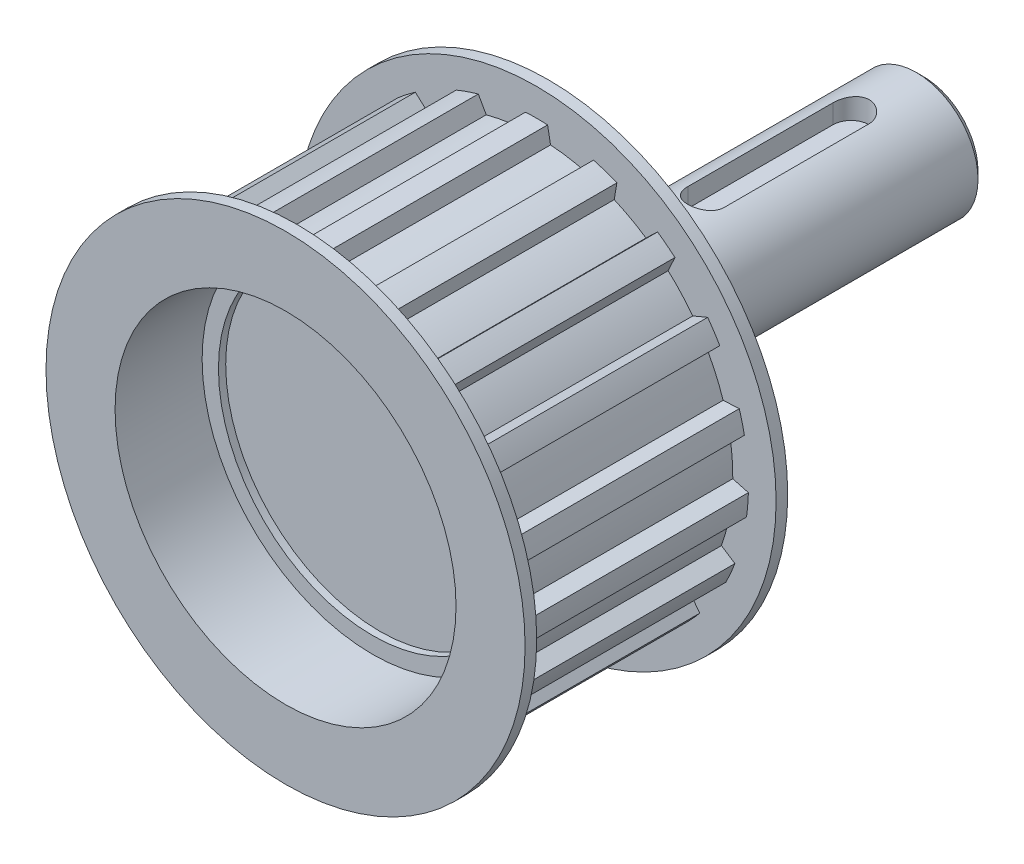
ISO-10303-21;
HEADER;
FILE_DESCRIPTION(('STEP AP214'),'2;1');
FILE_NAME('part.step','',(''),(''),'','','');
FILE_SCHEMA(('AUTOMOTIVE_DESIGN { 1 0 10303 214 1 1 1 1 }'));
ENDSEC;
DATA;
#1=APPLICATION_CONTEXT('core data for automotive mechanical design processes');
#2=APPLICATION_PROTOCOL_DEFINITION('international standard','automotive_design',2000,#1);
#3=PRODUCT_CONTEXT('',#1,'mechanical');
#4=PRODUCT('Part','Part','',(#3));
#5=PRODUCT_RELATED_PRODUCT_CATEGORY('part','',(#4));
#6=PRODUCT_DEFINITION_FORMATION('','',#4);
#7=PRODUCT_DEFINITION_CONTEXT('part definition',#1,'design');
#8=PRODUCT_DEFINITION('design','',#6,#7);
#9=PRODUCT_DEFINITION_SHAPE('','',#8);
#10=(LENGTH_UNIT() NAMED_UNIT(*) SI_UNIT(.MILLI.,.METRE.));
#11=(NAMED_UNIT(*) PLANE_ANGLE_UNIT() SI_UNIT($,.RADIAN.));
#12=(NAMED_UNIT(*) SI_UNIT($,.STERADIAN.) SOLID_ANGLE_UNIT());
#13=UNCERTAINTY_MEASURE_WITH_UNIT(LENGTH_MEASURE(1.E-05),#10,'distance_accuracy_value','');
#14=(GEOMETRIC_REPRESENTATION_CONTEXT(3) GLOBAL_UNCERTAINTY_ASSIGNED_CONTEXT((#13)) GLOBAL_UNIT_ASSIGNED_CONTEXT((#10,
#11,#12)) REPRESENTATION_CONTEXT('',''));
#15=CARTESIAN_POINT('',(0.,0.,0.));
#16=DIRECTION('',(0.,0.,1.));
#17=DIRECTION('',(1.,0.,0.));
#18=AXIS2_PLACEMENT_3D('',#15,#16,#17);
#19=CARTESIAN_POINT('',(0.,0.,5.1));
#20=DIRECTION('',(0.,0.,-1.));
#21=DIRECTION('',(-1.,0.,0.));
#22=AXIS2_PLACEMENT_3D('',#19,#20,#21);
#23=PLANE('',#22);
#24=CARTESIAN_POINT('',(0.,0.,5.1));
#25=DIRECTION('',(0.,0.,1.));
#26=DIRECTION('',(1.,0.,0.));
#27=AXIS2_PLACEMENT_3D('',#24,#25,#26);
#28=CIRCLE('',#27,21.25);
#29=CARTESIAN_POINT('',(21.25,0.,5.1));
#30=VERTEX_POINT('',#29);
#31=EDGE_CURVE('E20',#30,#30,#28,.T.);
#32=ORIENTED_EDGE('',*,*,#31,.T.);
#33=EDGE_LOOP('',(#32));
#34=FACE_BOUND('',#33,.T.);
#35=ADVANCED_FACE('F16',(#34),#23,.F.);
#36=CARTESIAN_POINT('',(0.,0.,5.1));
#37=DIRECTION('',(0.,0.,1.));
#38=DIRECTION('',(1.,0.,0.));
#39=AXIS2_PLACEMENT_3D('',#36,#37,#38);
#40=CYLINDRICAL_SURFACE('',#39,21.25);
#41=ORIENTED_EDGE('',*,*,#31,.F.);
#42=EDGE_LOOP('',(#41));
#43=FACE_BOUND('',#42,.T.);
#44=CARTESIAN_POINT('',(0.,0.,6.1));
#45=DIRECTION('',(0.,0.,1.));
#46=DIRECTION('',(1.,0.,0.));
#47=AXIS2_PLACEMENT_3D('',#44,#45,#46);
#48=CIRCLE('',#47,21.25);
#49=CARTESIAN_POINT('',(21.25,0.,6.1));
#50=VERTEX_POINT('',#49);
#51=EDGE_CURVE('E1140',#50,#50,#48,.T.);
#52=ORIENTED_EDGE('',*,*,#51,.T.);
#53=EDGE_LOOP('',(#52));
#54=FACE_BOUND('',#53,.T.);
#55=ADVANCED_FACE('F1148',(#43,#54),#40,.F.);
#56=CARTESIAN_POINT('',(0.,0.,6.1));
#57=DIRECTION('',(0.,0.,-1.));
#58=DIRECTION('',(-1.,0.,0.));
#59=AXIS2_PLACEMENT_3D('',#56,#57,#58);
#60=PLANE('',#59);
#61=ORIENTED_EDGE('',*,*,#51,.F.);
#62=EDGE_LOOP('',(#61));
#63=FACE_BOUND('',#62,.T.);
#64=CARTESIAN_POINT('',(0.,0.,6.1));
#65=DIRECTION('',(0.,0.,-1.));
#66=DIRECTION('',(-1.,0.,0.));
#67=AXIS2_PLACEMENT_3D('',#64,#65,#66);
#68=CIRCLE('',#67,23.5);
#69=CARTESIAN_POINT('',(-23.5,0.,6.1));
#70=VERTEX_POINT('',#69);
#71=EDGE_CURVE('E1138',#70,#70,#68,.F.);
#72=ORIENTED_EDGE('',*,*,#71,.T.);
#73=EDGE_LOOP('',(#72));
#74=FACE_BOUND('',#73,.T.);
#75=ADVANCED_FACE('F1150',(#63,#74),#60,.F.);
#76=CARTESIAN_POINT('',(0.,0.,18.1));
#77=DIRECTION('',(0.,0.,-1.));
#78=DIRECTION('',(-1.,0.,0.));
#79=AXIS2_PLACEMENT_3D('',#76,#77,#78);
#80=CYLINDRICAL_SURFACE('',#79,23.5);
#81=CARTESIAN_POINT('',(0.,0.,18.1));
#82=DIRECTION('',(0.,0.,-1.));
#83=DIRECTION('',(-1.,0.,0.));
#84=AXIS2_PLACEMENT_3D('',#81,#82,#83);
#85=CIRCLE('',#84,23.5);
#86=CARTESIAN_POINT('',(-23.5,0.,18.1));
#87=VERTEX_POINT('',#86);
#88=EDGE_CURVE('E1135',#87,#87,#85,.F.);
#89=ORIENTED_EDGE('',*,*,#88,.T.);
#90=EDGE_LOOP('',(#89));
#91=FACE_BOUND('',#90,.T.);
#92=ORIENTED_EDGE('',*,*,#71,.F.);
#93=EDGE_LOOP('',(#92));
#94=FACE_BOUND('',#93,.T.);
#95=ADVANCED_FACE('F1156',(#91,#94),#80,.F.);
#96=CARTESIAN_POINT('',(0.,0.,18.1));
#97=DIRECTION('',(0.,0.,-1.));
#98=DIRECTION('',(-1.,0.,0.));
#99=AXIS2_PLACEMENT_3D('',#96,#97,#98);
#100=PLANE('',#99);
#101=ORIENTED_EDGE('',*,*,#88,.F.);
#102=EDGE_LOOP('',(#101));
#103=FACE_BOUND('',#102,.T.);
#104=CARTESIAN_POINT('',(0.,0.,18.1));
#105=DIRECTION('',(0.,0.,1.));
#106=DIRECTION('',(1.,0.,0.));
#107=AXIS2_PLACEMENT_3D('',#104,#105,#106);
#108=CIRCLE('',#107,33.02);
#109=CARTESIAN_POINT('',(33.02,0.,18.1));
#110=VERTEX_POINT('',#109);
#111=EDGE_CURVE('E1132',#110,#110,#108,.F.);
#112=ORIENTED_EDGE('',*,*,#111,.F.);
#113=EDGE_LOOP('',(#112));
#114=FACE_BOUND('',#113,.T.);
#115=ADVANCED_FACE('F1519',(#103,#114),#100,.F.);
#116=CARTESIAN_POINT('',(0.,0.,16.5));
#117=DIRECTION('',(0.,0.,1.));
#118=DIRECTION('',(1.,0.,0.));
#119=AXIS2_PLACEMENT_3D('',#116,#117,#118);
#120=CYLINDRICAL_SURFACE('',#119,33.02);
#121=CARTESIAN_POINT('',(0.,0.,16.5));
#122=DIRECTION('',(0.,0.,1.));
#123=DIRECTION('',(1.,0.,0.));
#124=AXIS2_PLACEMENT_3D('',#121,#122,#123);
#125=CIRCLE('',#124,33.02);
#126=CARTESIAN_POINT('',(33.02,0.,16.5));
#127=VERTEX_POINT('',#126);
#128=EDGE_CURVE('E523',#127,#127,#125,.F.);
#129=ORIENTED_EDGE('',*,*,#128,.F.);
#130=EDGE_LOOP('',(#129));
#131=FACE_BOUND('',#130,.T.);
#132=ORIENTED_EDGE('',*,*,#111,.T.);
#133=EDGE_LOOP('',(#132));
#134=FACE_BOUND('',#133,.T.);
#135=ADVANCED_FACE('F1516',(#131,#134),#120,.T.);
#136=CARTESIAN_POINT('',(0.,0.,16.5));
#137=DIRECTION('',(0.,0.,-1.));
#138=DIRECTION('',(-1.,0.,0.));
#139=AXIS2_PLACEMENT_3D('',#136,#137,#138);
#140=PLANE('',#139);
#141=CARTESIAN_POINT('',(0.,0.,16.5));
#142=DIRECTION('',(0.,0.,1.));
#143=DIRECTION('',(1.,0.,0.));
#144=AXIS2_PLACEMENT_3D('',#141,#142,#143);
#145=CIRCLE('',#144,27.0509993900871);
#146=CARTESIAN_POINT('',(1.92741928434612,26.9822464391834,16.5));
#147=VERTEX_POINT('',#146);
#148=CARTESIAN_POINT('',(6.93813470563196,26.1461059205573,16.5));
#149=VERTEX_POINT('',#148);
#150=EDGE_CURVE('E1127',#147,#149,#145,.F.);
#151=ORIENTED_EDGE('',*,*,#150,.F.);
#152=DIRECTION('',(-0.181324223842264,0.983423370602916,0.));
#153=VECTOR('',#152,1.);
#154=CARTESIAN_POINT('',(1.524,29.1702163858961,16.5));
#155=LINE('',#154,#153);
#156=CARTESIAN_POINT('',(1.524,29.1702163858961,16.5));
#157=VERTEX_POINT('',#156);
#158=EDGE_CURVE('E520',#157,#147,#155,.F.);
#159=ORIENTED_EDGE('',*,*,#158,.F.);
#160=CARTESIAN_POINT('',(0.,0.,16.5));
#161=DIRECTION('',(0.,0.,1.));
#162=DIRECTION('',(1.,0.,0.));
#163=AXIS2_PLACEMENT_3D('',#160,#161,#162);
#164=CIRCLE('',#163,29.21);
#165=CARTESIAN_POINT('',(-1.524,29.1702163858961,16.5));
#166=VERTEX_POINT('',#165);
#167=EDGE_CURVE('E512',#166,#157,#164,.F.);
#168=ORIENTED_EDGE('',*,*,#167,.F.);
#169=DIRECTION('',(-0.181324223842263,-0.983423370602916,0.));
#170=VECTOR('',#169,1.);
#171=CARTESIAN_POINT('',(-1.92741928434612,26.9822464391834,16.5));
#172=LINE('',#171,#170);
#173=CARTESIAN_POINT('',(-1.92741928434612,26.9822464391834,16.5));
#174=VERTEX_POINT('',#173);
#175=EDGE_CURVE('E517',#174,#166,#172,.F.);
#176=ORIENTED_EDGE('',*,*,#175,.F.);
#177=CARTESIAN_POINT('',(0.,0.,16.5));
#178=DIRECTION('',(0.,0.,1.));
#179=DIRECTION('',(1.,0.,0.));
#180=AXIS2_PLACEMENT_3D('',#177,#178,#179);
#181=CIRCLE('',#180,27.0509993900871);
#182=CARTESIAN_POINT('',(-6.93813470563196,26.1461059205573,16.5));
#183=VERTEX_POINT('',#182);
#184=EDGE_CURVE('E540',#183,#174,#181,.F.);
#185=ORIENTED_EDGE('',*,*,#184,.F.);
#186=DIRECTION('',(-0.490816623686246,0.871262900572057,0.));
#187=VECTOR('',#186,1.);
#188=CARTESIAN_POINT('',(-8.03012830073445,28.0845355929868,16.5));
#189=LINE('',#188,#187);
#190=CARTESIAN_POINT('',(-8.03012830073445,28.0845355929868,16.5));
#191=VERTEX_POINT('',#190);
#192=EDGE_CURVE('E546',#191,#183,#189,.F.);
#193=ORIENTED_EDGE('',*,*,#192,.F.);
#194=CARTESIAN_POINT('',(0.,0.,16.5));
#195=DIRECTION('',(0.,0.,1.));
#196=DIRECTION('',(1.,0.,0.));
#197=AXIS2_PLACEMENT_3D('',#194,#195,#196);
#198=CIRCLE('',#197,29.21);
#199=CARTESIAN_POINT('',(-11.0725078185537,27.0300512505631,16.5));
#200=VERTEX_POINT('',#199);
#201=EDGE_CURVE('E1022',#200,#191,#198,.F.);
#202=ORIENTED_EDGE('',*,*,#201,.F.);
#203=DIRECTION('',(0.16459459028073,-0.986361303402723,0.));
#204=VECTOR('',#203,1.);
#205=CARTESIAN_POINT('',(-10.7073348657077,24.8416897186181,16.5));
#206=LINE('',#205,#204);
#207=CARTESIAN_POINT('',(-10.7073348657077,24.8416897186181,16.5));
#208=VERTEX_POINT('',#207);
#209=EDGE_CURVE('E551',#208,#200,#206,.F.);
#210=ORIENTED_EDGE('',*,*,#209,.F.);
#211=CARTESIAN_POINT('',(0.,0.,16.5));
#212=DIRECTION('',(0.,0.,1.));
#213=DIRECTION('',(1.,0.,0.));
#214=AXIS2_PLACEMENT_3D('',#211,#212,#213);
#215=CIRCLE('',#214,27.0509993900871);
#216=CARTESIAN_POINT('',(-15.0518341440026,22.4766291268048,16.5));
#217=VERTEX_POINT('',#216);
#218=EDGE_CURVE('E1025',#217,#208,#215,.F.);
#219=ORIENTED_EDGE('',*,*,#218,.F.);
#220=DIRECTION('',(-0.747121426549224,0.664687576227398,0.));
#221=VECTOR('',#220,1.);
#222=CARTESIAN_POINT('',(-16.7140675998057,23.9554595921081,16.5));
#223=LINE('',#222,#221);
#224=CARTESIAN_POINT('',(-16.7140675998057,23.9554595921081,16.5));
#225=VERTEX_POINT('',#224);
#226=EDGE_CURVE('E556',#225,#217,#223,.F.);
#227=ORIENTED_EDGE('',*,*,#226,.F.);
#228=CARTESIAN_POINT('',(0.,0.,16.5));
#229=DIRECTION('',(0.,0.,1.));
#230=DIRECTION('',(1.,0.,0.));
#231=AXIS2_PLACEMENT_3D('',#228,#229,#230);
#232=CIRCLE('',#231,29.21);
#233=CARTESIAN_POINT('',(-19.1193678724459,22.08333924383,16.5));
#234=VERTEX_POINT('',#233);
#235=EDGE_CURVE('E1028',#234,#225,#232,.F.);
#236=ORIENTED_EDGE('',*,*,#235,.F.);
#237=DIRECTION('',(0.460940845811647,-0.887430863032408,0.));
#238=VECTOR('',#237,1.);
#239=CARTESIAN_POINT('',(-18.0938434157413,20.1089382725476,16.5));
#240=LINE('',#239,#238);
#241=CARTESIAN_POINT('',(-18.0938434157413,20.1089382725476,16.5));
#242=VERTEX_POINT('',#241);
#243=EDGE_CURVE('E561',#242,#234,#240,.F.);
#244=ORIENTED_EDGE('',*,*,#243,.F.);
#245=CARTESIAN_POINT('',(0.,0.,16.5));
#246=DIRECTION('',(0.,0.,1.));
#247=DIRECTION('',(1.,0.,0.));
#248=AXIS2_PLACEMENT_3D('',#245,#246,#247);
#249=CIRCLE('',#248,27.0509993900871);
#250=CARTESIAN_POINT('',(-21.5344337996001,16.3714608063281,16.5));
#251=VERTEX_POINT('',#250);
#252=EDGE_CURVE('E1031',#251,#242,#249,.F.);
#253=ORIENTED_EDGE('',*,*,#252,.F.);
#254=DIRECTION('',(-0.922464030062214,0.386083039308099,0.));
#255=VECTOR('',#254,1.);
#256=CARTESIAN_POINT('',(-23.5867783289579,17.2304378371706,16.5));
#257=LINE('',#256,#255);
#258=CARTESIAN_POINT('',(-23.5867783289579,17.2304378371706,16.5));
#259=VERTEX_POINT('',#258);
#260=EDGE_CURVE('E566',#259,#251,#257,.F.);
#261=ORIENTED_EDGE('',*,*,#260,.F.);
#262=CARTESIAN_POINT('',(0.,0.,16.5));
#263=DIRECTION('',(0.,0.,1.));
#264=DIRECTION('',(1.,0.,0.));
#265=AXIS2_PLACEMENT_3D('',#262,#263,#264);
#266=CIRCLE('',#265,29.21);
#267=CARTESIAN_POINT('',(-25.2538763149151,14.6787544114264,16.5));
#268=VERTEX_POINT('',#267);
#269=EDGE_CURVE('E1034',#268,#259,#266,.F.);
#270=ORIENTED_EDGE('',*,*,#269,.F.);
#271=DIRECTION('',(0.724114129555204,-0.689680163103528,0.));
#272=VECTOR('',#271,1.);
#273=CARTESIAN_POINT('',(-23.6428306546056,13.1443191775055,16.5));
#274=LINE('',#273,#272);
#275=CARTESIAN_POINT('',(-23.6428306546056,13.1443191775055,16.5));
#276=VERTEX_POINT('',#275);
#277=EDGE_CURVE('E571',#276,#268,#274,.F.);
#278=ORIENTED_EDGE('',*,*,#277,.F.);
#279=CARTESIAN_POINT('',(0.,0.,16.5));
#280=DIRECTION('',(0.,0.,1.));
#281=DIRECTION('',(1.,0.,0.));
#282=AXIS2_PLACEMENT_3D('',#279,#280,#281);
#283=CIRCLE('',#282,27.0509993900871);
#284=CARTESIAN_POINT('',(-25.6957280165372,8.45494705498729,16.5));
#285=VERTEX_POINT('',#284);
#286=EDGE_CURVE('E1037',#285,#276,#283,.F.);
#287=ORIENTED_EDGE('',*,*,#286,.F.);
#288=DIRECTION('',(-0.995045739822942,0.099418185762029,0.));
#289=VECTOR('',#288,1.);
#290=CARTESIAN_POINT('',(-27.8922695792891,8.67441051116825,16.5));
#291=LINE('',#290,#289);
#292=CARTESIAN_POINT('',(-27.8922695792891,8.67441051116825,16.5));
#293=VERTEX_POINT('',#292);
#294=EDGE_CURVE('E576',#293,#285,#291,.F.);
#295=ORIENTED_EDGE('',*,*,#294,.F.);
#296=CARTESIAN_POINT('',(0.,0.,16.5));
#297=DIRECTION('',(0.,0.,1.));
#298=DIRECTION('',(1.,0.,0.));
#299=AXIS2_PLACEMENT_3D('',#296,#297,#298);
#300=CIRCLE('',#299,29.21);
#301=CARTESIAN_POINT('',(-28.6515100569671,5.68463468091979,16.5));
#302=VERTEX_POINT('',#301);
#303=EDGE_CURVE('E1040',#302,#293,#300,.F.);
#304=ORIENTED_EDGE('',*,*,#303,.F.);
#305=DIRECTION('',(0.908770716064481,-0.417295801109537,0.));
#306=VECTOR('',#305,1.);
#307=CARTESIAN_POINT('',(-26.6295919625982,4.75619594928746,16.5));
#308=LINE('',#307,#306);
#309=CARTESIAN_POINT('',(-26.6295919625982,4.75619594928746,16.5));
#310=VERTEX_POINT('',#309);
#311=EDGE_CURVE('E581',#310,#302,#308,.F.);
#312=ORIENTED_EDGE('',*,*,#311,.F.);
#313=CARTESIAN_POINT('',(0.,0.,16.5));
#314=DIRECTION('',(0.,0.,1.));
#315=DIRECTION('',(1.,0.,0.));
#316=AXIS2_PLACEMENT_3D('',#313,#314,#315);
#317=CIRCLE('',#316,27.0509993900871);
#318=CARTESIAN_POINT('',(-27.0492534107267,-0.30734008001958,16.5));
#319=VERTEX_POINT('',#318);
#320=EDGE_CURVE('E1043',#319,#310,#317,.F.);
#321=ORIENTED_EDGE('',*,*,#320,.F.);
#322=DIRECTION('',(-0.965090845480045,-0.261915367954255,0.));
#323=VECTOR('',#322,1.);
#324=CARTESIAN_POINT('',(-29.1964362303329,-0.890062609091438,16.5));
#325=LINE('',#324,#323);
#326=CARTESIAN_POINT('',(-29.1964362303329,-0.890062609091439,16.5));
#327=VERTEX_POINT('',#326);
#328=EDGE_CURVE('E586',#327,#319,#325,.F.);
#329=ORIENTED_EDGE('',*,*,#328,.F.);
#330=CARTESIAN_POINT('',(0.,0.,16.5));
#331=DIRECTION('',(0.,0.,1.));
#332=DIRECTION('',(1.,0.,0.));
#333=AXIS2_PLACEMENT_3D('',#330,#331,#332);
#334=CIRCLE('',#333,29.21);
#335=CARTESIAN_POINT('',(-28.9446299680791,-3.9284215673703,16.5));
#336=VERTEX_POINT('',#335);
#337=EDGE_CURVE('E1046',#336,#327,#334,.F.);
#338=ORIENTED_EDGE('',*,*,#337,.F.);
#339=DIRECTION('',(0.995045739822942,-0.099418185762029,0.));
#340=VECTOR('',#339,1.);
#341=CARTESIAN_POINT('',(-26.7308307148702,-4.14960929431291,16.5));
#342=LINE('',#341,#340);
#343=CARTESIAN_POINT('',(-26.7308307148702,-4.14960929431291,16.5));
#344=VERTEX_POINT('',#343);
#345=EDGE_CURVE('E591',#344,#336,#342,.F.);
#346=ORIENTED_EDGE('',*,*,#345,.F.);
#347=CARTESIAN_POINT('',(0.,0.,16.5));
#348=DIRECTION('',(0.,0.,1.));
#349=DIRECTION('',(1.,0.,0.));
#350=AXIS2_PLACEMENT_3D('',#347,#348,#349);
#351=CIRCLE('',#350,27.0509993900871);
#352=CARTESIAN_POINT('',(-25.4838570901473,-9.07356577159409,16.5));
#353=VERTEX_POINT('',#352);
#354=EDGE_CURVE('E1049',#353,#344,#351,.F.);
#355=ORIENTED_EDGE('',*,*,#354,.F.);
#356=DIRECTION('',(-0.827755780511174,-0.561088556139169,0.));
#357=VECTOR('',#356,1.);
#358=CARTESIAN_POINT('',(-27.325489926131,-10.3219039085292,16.5));
#359=LINE('',#358,#357);
#360=CARTESIAN_POINT('',(-27.325489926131,-10.3219039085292,16.5));
#361=VERTEX_POINT('',#360);
#362=EDGE_CURVE('E596',#361,#353,#359,.F.);
#363=ORIENTED_EDGE('',*,*,#362,.F.);
#364=CARTESIAN_POINT('',(0.,0.,16.5));
#365=DIRECTION('',(0.,0.,1.));
#366=DIRECTION('',(1.,0.,0.));
#367=AXIS2_PLACEMENT_3D('',#364,#365,#366);
#368=CIRCLE('',#367,29.21);
#369=CARTESIAN_POINT('',(-26.1011222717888,-13.1131810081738,16.5));
#370=VERTEX_POINT('',#369);
#371=EDGE_CURVE('E1052',#370,#361,#368,.F.);
#372=ORIENTED_EDGE('',*,*,#371,.F.);
#373=DIRECTION('',(0.97343000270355,0.228984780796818,0.));
#374=VECTOR('',#373,1.);
#375=CARTESIAN_POINT('',(-23.9353860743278,-12.6037241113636,16.5));
#376=LINE('',#375,#374);
#377=CARTESIAN_POINT('',(-23.9353860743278,-12.6037241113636,16.5));
#378=VERTEX_POINT('',#377);
#379=EDGE_CURVE('E601',#378,#370,#376,.F.);
#380=ORIENTED_EDGE('',*,*,#379,.F.);
#381=CARTESIAN_POINT('',(0.,0.,16.5));
#382=DIRECTION('',(0.,0.,1.));
#383=DIRECTION('',(1.,0.,0.));
#384=AXIS2_PLACEMENT_3D('',#381,#382,#383);
#385=CIRCLE('',#384,27.0509993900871);
#386=CARTESIAN_POINT('',(-21.1572658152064,-16.8560574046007,16.5));
#387=VERTEX_POINT('',#386);
#388=EDGE_CURVE('E1055',#387,#378,#385,.F.);
#389=ORIENTED_EDGE('',*,*,#388,.F.);
#390=DIRECTION('',(-0.600781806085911,-0.799413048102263,0.));
#391=VECTOR('',#390,1.);
#392=CARTESIAN_POINT('',(-22.4938981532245,-18.6346088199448,16.5));
#393=LINE('',#392,#391);
#394=CARTESIAN_POINT('',(-22.4938981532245,-18.6346088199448,16.5));
#395=VERTEX_POINT('',#394);
#396=EDGE_CURVE('E606',#395,#387,#393,.F.);
#397=ORIENTED_EDGE('',*,*,#396,.F.);
#398=CARTESIAN_POINT('',(0.,0.,16.5));
#399=DIRECTION('',(0.,0.,1.));
#400=DIRECTION('',(1.,0.,0.));
#401=AXIS2_PLACEMENT_3D('',#398,#399,#400);
#402=CIRCLE('',#401,29.21);
#403=CARTESIAN_POINT('',(-20.4290485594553,-20.8776932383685,16.5));
#404=VERTEX_POINT('',#403);
#405=EDGE_CURVE('E1058',#404,#395,#402,.F.);
#406=ORIENTED_EDGE('',*,*,#405,.F.);
#407=DIRECTION('',(0.846335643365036,0.532649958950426,0.));
#408=VECTOR('',#407,1.);
#409=CARTESIAN_POINT('',(-18.5460783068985,-19.6926267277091,16.5));
#410=LINE('',#409,#408);
#411=CARTESIAN_POINT('',(-18.5460783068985,-19.6926267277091,16.5));
#412=VERTEX_POINT('',#411);
#413=EDGE_CURVE('E611',#412,#404,#410,.F.);
#414=ORIENTED_EDGE('',*,*,#413,.F.);
#415=CARTESIAN_POINT('',(0.,0.,16.5));
#416=DIRECTION('',(0.,0.,1.));
#417=DIRECTION('',(1.,0.,0.));
#418=AXIS2_PLACEMENT_3D('',#415,#416,#417);
#419=CIRCLE('',#418,27.0509993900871);
#420=CARTESIAN_POINT('',(-14.5372445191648,-22.8128273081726,16.5));
#421=VERTEX_POINT('',#420);
#422=EDGE_CURVE('E1061',#421,#412,#419,.F.);
#423=ORIENTED_EDGE('',*,*,#422,.F.);
#424=DIRECTION('',(-0.30858789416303,-0.951195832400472,0.));
#425=VECTOR('',#424,1.);
#426=CARTESIAN_POINT('',(-15.2238064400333,-24.9290958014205,16.5));
#427=LINE('',#426,#425);
#428=CARTESIAN_POINT('',(-15.2238064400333,-24.9290958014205,16.5));
#429=VERTEX_POINT('',#428);
#430=EDGE_CURVE('E616',#429,#421,#427,.F.);
#431=ORIENTED_EDGE('',*,*,#430,.F.);
#432=CARTESIAN_POINT('',(0.,0.,16.5));
#433=DIRECTION('',(0.,0.,1.));
#434=DIRECTION('',(1.,0.,0.));
#435=AXIS2_PLACEMENT_3D('',#432,#433,#434);
#436=CIRCLE('',#435,29.21);
#437=CARTESIAN_POINT('',(-12.5089489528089,-26.3960280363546,16.5));
#438=VERTEX_POINT('',#437);
#439=EDGE_CURVE('E1064',#438,#429,#436,.F.);
#440=ORIENTED_EDGE('',*,*,#439,.F.);
#441=DIRECTION('',(0.600781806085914,0.799413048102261,0.));
#442=VECTOR('',#441,1.);
#443=CARTESIAN_POINT('',(-11.1827363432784,-24.6313413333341,16.5));
#444=LINE('',#443,#442);
#445=CARTESIAN_POINT('',(-11.1827363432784,-24.6313413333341,16.5));
#446=VERTEX_POINT('',#445);
#447=EDGE_CURVE('E621',#446,#438,#444,.F.);
#448=ORIENTED_EDGE('',*,*,#447,.F.);
#449=CARTESIAN_POINT('',(0.,0.,16.5));
#450=DIRECTION('',(0.,0.,1.));
#451=DIRECTION('',(1.,0.,0.));
#452=AXIS2_PLACEMENT_3D('',#449,#450,#451);
#453=CIRCLE('',#452,27.0509993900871);
#454=CARTESIAN_POINT('',(-6.34226359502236,-26.2970009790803,16.5));
#455=VERTEX_POINT('',#454);
#456=EDGE_CURVE('E1067',#455,#446,#453,.F.);
#457=ORIENTED_EDGE('',*,*,#456,.F.);
#458=DIRECTION('',(0.016985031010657,-0.99985574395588,0.));
#459=VECTOR('',#458,1.);
#460=CARTESIAN_POINT('',(-6.30447444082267,-28.5215304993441,16.5));
#461=LINE('',#460,#459);
#462=CARTESIAN_POINT('',(-6.30447444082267,-28.5215304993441,16.5));
#463=VERTEX_POINT('',#462);
#464=EDGE_CURVE('E626',#463,#455,#461,.F.);
#465=ORIENTED_EDGE('',*,*,#464,.F.);
#466=CARTESIAN_POINT('',(0.,0.,16.5));
#467=DIRECTION('',(0.,0.,1.));
#468=DIRECTION('',(1.,0.,0.));
#469=AXIS2_PLACEMENT_3D('',#466,#467,#468);
#470=CIRCLE('',#469,29.21);
#471=CARTESIAN_POINT('',(-3.29804518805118,-29.0232148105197,16.5));
#472=VERTEX_POINT('',#471);
#473=EDGE_CURVE('E1070',#472,#463,#470,.F.);
#474=ORIENTED_EDGE('',*,*,#473,.F.);
#475=DIRECTION('',(0.340717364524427,0.940165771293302,0.));
#476=VECTOR('',#475,1.);
#477=CARTESIAN_POINT('',(-2.54000000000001,-26.9314865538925,16.5));
#478=LINE('',#477,#476);
#479=CARTESIAN_POINT('',(-2.54000000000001,-26.9314865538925,16.5));
#480=VERTEX_POINT('',#479);
#481=EDGE_CURVE('E631',#480,#472,#478,.F.);
#482=ORIENTED_EDGE('',*,*,#481,.F.);
#483=CARTESIAN_POINT('',(0.,0.,16.5));
#484=DIRECTION('',(0.,0.,1.));
#485=DIRECTION('',(1.,0.,0.));
#486=AXIS2_PLACEMENT_3D('',#483,#484,#485);
#487=CIRCLE('',#486,27.0509993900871);
#488=CARTESIAN_POINT('',(2.53999999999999,-26.9314865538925,16.5));
#489=VERTEX_POINT('',#488);
#490=EDGE_CURVE('E1073',#489,#480,#487,.F.);
#491=ORIENTED_EDGE('',*,*,#490,.F.);
#492=DIRECTION('',(0.340717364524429,-0.940165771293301,0.));
#493=VECTOR('',#492,1.);
#494=CARTESIAN_POINT('',(3.29804518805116,-29.0232148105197,16.5));
#495=LINE('',#494,#493);
#496=CARTESIAN_POINT('',(3.29804518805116,-29.0232148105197,16.5));
#497=VERTEX_POINT('',#496);
#498=EDGE_CURVE('E636',#497,#489,#495,.F.);
#499=ORIENTED_EDGE('',*,*,#498,.F.);
#500=CARTESIAN_POINT('',(0.,0.,16.5));
#501=DIRECTION('',(0.,0.,1.));
#502=DIRECTION('',(1.,0.,0.));
#503=AXIS2_PLACEMENT_3D('',#500,#501,#502);
#504=CIRCLE('',#503,29.21);
#505=CARTESIAN_POINT('',(6.30447444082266,-28.5215304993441,16.5));
#506=VERTEX_POINT('',#505);
#507=EDGE_CURVE('E1076',#506,#497,#504,.F.);
#508=ORIENTED_EDGE('',*,*,#507,.F.);
#509=DIRECTION('',(0.016985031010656,0.99985574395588,0.));
#510=VECTOR('',#509,1.);
#511=CARTESIAN_POINT('',(6.34226359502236,-26.2970009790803,16.5));
#512=LINE('',#511,#510);
#513=CARTESIAN_POINT('',(6.34226359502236,-26.2970009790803,16.5));
#514=VERTEX_POINT('',#513);
#515=EDGE_CURVE('E641',#514,#506,#512,.F.);
#516=ORIENTED_EDGE('',*,*,#515,.F.);
#517=CARTESIAN_POINT('',(0.,0.,16.5));
#518=DIRECTION('',(0.,0.,1.));
#519=DIRECTION('',(1.,0.,0.));
#520=AXIS2_PLACEMENT_3D('',#517,#518,#519);
#521=CIRCLE('',#520,27.0509993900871);
#522=CARTESIAN_POINT('',(11.1470151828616,-24.6475276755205,16.5));
#523=VERTEX_POINT('',#522);
#524=EDGE_CURVE('E1079',#523,#514,#521,.F.);
#525=ORIENTED_EDGE('',*,*,#524,.F.);
#526=DIRECTION('',(0.627527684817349,-0.778594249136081,0.));
#527=VECTOR('',#526,1.);
#528=CARTESIAN_POINT('',(12.5431704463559,-26.3797834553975,16.5));
#529=LINE('',#528,#527);
#530=CARTESIAN_POINT('',(12.5431704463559,-26.3797834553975,16.5));
#531=VERTEX_POINT('',#530);
#532=EDGE_CURVE('E646',#531,#523,#529,.F.);
#533=ORIENTED_EDGE('',*,*,#532,.F.);
#534=CARTESIAN_POINT('',(0.,0.,16.5));
#535=DIRECTION('',(0.,0.,1.));
#536=DIRECTION('',(1.,0.,0.));
#537=AXIS2_PLACEMENT_3D('',#534,#535,#536);
#538=CIRCLE('',#537,29.21);
#539=CARTESIAN_POINT('',(15.2238064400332,-24.9290958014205,16.5));
#540=VERTEX_POINT('',#539);
#541=EDGE_CURVE('E1082',#540,#531,#538,.F.);
#542=ORIENTED_EDGE('',*,*,#541,.F.);
#543=DIRECTION('',(-0.308587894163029,0.951195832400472,0.));
#544=VECTOR('',#543,1.);
#545=CARTESIAN_POINT('',(14.5372445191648,-22.8128273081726,16.5));
#546=LINE('',#545,#544);
#547=CARTESIAN_POINT('',(14.5372445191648,-22.8128273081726,16.5));
#548=VERTEX_POINT('',#547);
#549=EDGE_CURVE('E651',#548,#540,#546,.F.);
#550=ORIENTED_EDGE('',*,*,#549,.F.);
#551=CARTESIAN_POINT('',(0.,0.,16.5));
#552=DIRECTION('',(0.,0.,1.));
#553=DIRECTION('',(1.,0.,0.));
#554=AXIS2_PLACEMENT_3D('',#551,#552,#553);
#555=CIRCLE('',#554,27.0509993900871);
#556=CARTESIAN_POINT('',(18.5460783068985,-19.6926267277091,16.5));
#557=VERTEX_POINT('',#556);
#558=EDGE_CURVE('E1085',#557,#548,#555,.F.);
#559=ORIENTED_EDGE('',*,*,#558,.F.);
#560=DIRECTION('',(0.846335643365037,-0.532649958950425,0.));
#561=VECTOR('',#560,1.);
#562=CARTESIAN_POINT('',(20.4290485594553,-20.8776932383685,16.5));
#563=LINE('',#562,#561);
#564=CARTESIAN_POINT('',(20.4290485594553,-20.8776932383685,16.5));
#565=VERTEX_POINT('',#564);
#566=EDGE_CURVE('E656',#565,#557,#563,.F.);
#567=ORIENTED_EDGE('',*,*,#566,.F.);
#568=CARTESIAN_POINT('',(0.,0.,16.5));
#569=DIRECTION('',(0.,0.,1.));
#570=DIRECTION('',(1.,0.,0.));
#571=AXIS2_PLACEMENT_3D('',#568,#569,#570);
#572=CIRCLE('',#571,29.21);
#573=CARTESIAN_POINT('',(22.4934027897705,-18.6352067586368,16.5));
#574=VERTEX_POINT('',#573);
#575=EDGE_CURVE('E1088',#574,#565,#572,.F.);
#576=ORIENTED_EDGE('',*,*,#575,.F.);
#577=DIRECTION('',(-0.600720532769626,0.799459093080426,0.));
#578=VECTOR('',#577,1.);
#579=CARTESIAN_POINT('',(21.1568894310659,-16.8565298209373,16.5));
#580=LINE('',#579,#578);
#581=CARTESIAN_POINT('',(21.1568894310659,-16.8565298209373,16.5));
#582=VERTEX_POINT('',#581);
#583=EDGE_CURVE('E661',#582,#574,#580,.F.);
#584=ORIENTED_EDGE('',*,*,#583,.F.);
#585=CARTESIAN_POINT('',(0.,0.,16.5));
#586=DIRECTION('',(0.,0.,1.));
#587=DIRECTION('',(1.,0.,0.));
#588=AXIS2_PLACEMENT_3D('',#585,#586,#587);
#589=CIRCLE('',#588,27.0509993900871);
#590=CARTESIAN_POINT('',(23.9536332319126,-12.5690104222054,16.5));
#591=VERTEX_POINT('',#590);
#592=EDGE_CURVE('E1091',#591,#582,#589,.F.);
#593=ORIENTED_EDGE('',*,*,#592,.F.);
#594=DIRECTION('',(0.965110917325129,-0.261841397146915,0.));
#595=VECTOR('',#594,1.);
#596=CARTESIAN_POINT('',(26.084094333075,-13.1470195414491,16.5));
#597=LINE('',#596,#595);
#598=CARTESIAN_POINT('',(26.084094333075,-13.1470195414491,16.5));
#599=VERTEX_POINT('',#598);
#600=EDGE_CURVE('E666',#599,#591,#597,.F.);
#601=ORIENTED_EDGE('',*,*,#600,.F.);
#602=CARTESIAN_POINT('',(0.,0.,16.5));
#603=DIRECTION('',(0.,0.,1.));
#604=DIRECTION('',(1.,0.,0.));
#605=AXIS2_PLACEMENT_3D('',#602,#603,#604);
#606=CIRCLE('',#605,29.21);
#607=CARTESIAN_POINT('',(27.3388530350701,-10.2864578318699,16.5));
#608=VERTEX_POINT('',#607);
#609=EDGE_CURVE('E1094',#608,#599,#606,.F.);
#610=ORIENTED_EDGE('',*,*,#609,.F.);
#611=DIRECTION('',(-0.836967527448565,0.547252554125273,0.));
#612=VECTOR('',#611,1.);
#613=CARTESIAN_POINT('',(25.4838570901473,-9.0735657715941,16.5));
#614=LINE('',#613,#612);
#615=CARTESIAN_POINT('',(25.4838570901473,-9.0735657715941,16.5));
#616=VERTEX_POINT('',#615);
#617=EDGE_CURVE('E671',#616,#608,#614,.F.);
#618=ORIENTED_EDGE('',*,*,#617,.F.);
#619=CARTESIAN_POINT('',(0.,0.,16.5));
#620=DIRECTION('',(0.,0.,1.));
#621=DIRECTION('',(1.,0.,0.));
#622=AXIS2_PLACEMENT_3D('',#619,#620,#621);
#623=CIRCLE('',#622,27.0509993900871);
#624=CARTESIAN_POINT('',(26.7407671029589,-4.08508785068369,16.5));
#625=VERTEX_POINT('',#624);
#626=EDGE_CURVE('E1097',#625,#616,#623,.F.);
#627=ORIENTED_EDGE('',*,*,#626,.F.);
#628=DIRECTION('',(0.997458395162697,0.071251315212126,0.));
#629=VECTOR('',#628,1.);
#630=CARTESIAN_POINT('',(28.9447343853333,-3.92765214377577,16.5));
#631=LINE('',#630,#629);
#632=CARTESIAN_POINT('',(28.9447343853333,-3.92765214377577,16.5));
#633=VERTEX_POINT('',#632);
#634=EDGE_CURVE('E676',#633,#625,#631,.F.);
#635=ORIENTED_EDGE('',*,*,#634,.F.);
#636=CARTESIAN_POINT('',(0.,0.,16.5));
#637=DIRECTION('',(0.,0.,1.));
#638=DIRECTION('',(1.,0.,0.));
#639=AXIS2_PLACEMENT_3D('',#636,#637,#638);
#640=CIRCLE('',#639,29.21);
#641=CARTESIAN_POINT('',(29.1964598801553,-0.889286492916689,16.5));
#642=VERTEX_POINT('',#641);
#643=EDGE_CURVE('E1100',#642,#633,#640,.F.);
#644=ORIENTED_EDGE('',*,*,#643,.F.);
#645=DIRECTION('',(-0.965110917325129,0.261841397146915,0.));
#646=VECTOR('',#645,1.);
#647=CARTESIAN_POINT('',(27.0492602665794,-0.306736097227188,16.5));
#648=LINE('',#647,#646);
#649=CARTESIAN_POINT('',(27.0492602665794,-0.306736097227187,16.5));
#650=VERTEX_POINT('',#649);
#651=EDGE_CURVE('E681',#650,#642,#648,.F.);
#652=ORIENTED_EDGE('',*,*,#651,.F.);
#653=CARTESIAN_POINT('',(0.,0.,16.5));
#654=DIRECTION('',(0.,0.,1.));
#655=DIRECTION('',(1.,0.,0.));
#656=AXIS2_PLACEMENT_3D('',#653,#654,#655);
#657=CIRCLE('',#656,27.0509993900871);
#658=CARTESIAN_POINT('',(26.6297503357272,4.7553091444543,16.5));
#659=VERTEX_POINT('',#658);
#660=EDGE_CURVE('E1103',#659,#650,#657,.F.);
#661=ORIENTED_EDGE('',*,*,#660,.F.);
#662=DIRECTION('',(0.908818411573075,0.417191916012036,0.));
#663=VECTOR('',#662,1.);
#664=CARTESIAN_POINT('',(28.6517354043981,5.68349877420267,16.5));
#665=LINE('',#664,#663);
#666=CARTESIAN_POINT('',(28.651735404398,5.68349877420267,16.5));
#667=VERTEX_POINT('',#666);
#668=EDGE_CURVE('E686',#667,#659,#665,.F.);
#669=ORIENTED_EDGE('',*,*,#668,.F.);
#670=CARTESIAN_POINT('',(0.,0.,16.5));
#671=DIRECTION('',(0.,0.,1.));
#672=DIRECTION('',(1.,0.,0.));
#673=AXIS2_PLACEMENT_3D('',#670,#671,#672);
#674=CIRCLE('',#673,29.21);
#675=CARTESIAN_POINT('',(27.9435845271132,8.50765442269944,16.5));
#676=VERTEX_POINT('',#675);
#677=EDGE_CURVE('E1106',#676,#667,#674,.F.);
#678=ORIENTED_EDGE('',*,*,#677,.F.);
#679=DIRECTION('',(-0.998638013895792,-0.052173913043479,0.));
#680=VECTOR('',#679,1.);
#681=CARTESIAN_POINT('',(25.7165817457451,8.39130450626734,16.5));
#682=LINE('',#681,#680);
#683=CARTESIAN_POINT('',(25.7165817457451,8.39130450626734,16.5));
#684=VERTEX_POINT('',#683);
#685=EDGE_CURVE('E691',#684,#676,#682,.F.);
#686=ORIENTED_EDGE('',*,*,#685,.F.);
#687=CARTESIAN_POINT('',(0.,0.,16.5));
#688=DIRECTION('',(0.,0.,1.));
#689=DIRECTION('',(1.,0.,0.));
#690=AXIS2_PLACEMENT_3D('',#687,#688,#689);
#691=CIRCLE('',#690,27.0509993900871);
#692=CARTESIAN_POINT('',(23.6431241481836,13.1437912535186,16.5));
#693=VERTEX_POINT('',#692);
#694=EDGE_CURVE('E1109',#693,#684,#691,.F.);
#695=ORIENTED_EDGE('',*,*,#694,.F.);
#696=DIRECTION('',(0.724166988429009,0.689624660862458,0.));
#697=VECTOR('',#696,1.);
#698=CARTESIAN_POINT('',(25.2542665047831,14.6780830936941,16.5));
#699=LINE('',#698,#697);
#700=CARTESIAN_POINT('',(25.2542665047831,14.6780830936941,16.5));
#701=VERTEX_POINT('',#700);
#702=EDGE_CURVE('E696',#701,#693,#699,.F.);
#703=ORIENTED_EDGE('',*,*,#702,.F.);
#704=CARTESIAN_POINT('',(0.,0.,16.5));
#705=DIRECTION('',(0.,0.,1.));
#706=DIRECTION('',(1.,0.,0.));
#707=AXIS2_PLACEMENT_3D('',#704,#705,#706);
#708=CIRCLE('',#707,29.21);
#709=CARTESIAN_POINT('',(23.5867783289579,17.2304378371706,16.5));
#710=VERTEX_POINT('',#709);
#711=EDGE_CURVE('E1112',#710,#701,#708,.F.);
#712=ORIENTED_EDGE('',*,*,#711,.F.);
#713=DIRECTION('',(-0.922464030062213,-0.386083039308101,0.));
#714=VECTOR('',#713,1.);
#715=CARTESIAN_POINT('',(21.5344337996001,16.3714608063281,16.5));
#716=LINE('',#715,#714);
#717=CARTESIAN_POINT('',(21.5344337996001,16.3714608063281,16.5));
#718=VERTEX_POINT('',#717);
#719=EDGE_CURVE('E701',#718,#710,#716,.F.);
#720=ORIENTED_EDGE('',*,*,#719,.F.);
#721=CARTESIAN_POINT('',(0.,0.,16.5));
#722=DIRECTION('',(0.,0.,1.));
#723=DIRECTION('',(1.,0.,0.));
#724=AXIS2_PLACEMENT_3D('',#721,#722,#723);
#725=CIRCLE('',#724,27.0509993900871);
#726=CARTESIAN_POINT('',(18.1364655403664,20.0705053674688,16.5));
#727=VERTEX_POINT('',#726);
#728=EDGE_CURVE('E1115',#727,#718,#725,.F.);
#729=ORIENTED_EDGE('',*,*,#728,.F.);
#730=DIRECTION('',(0.417295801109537,0.908770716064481,0.));
#731=VECTOR('',#730,1.);
#732=CARTESIAN_POINT('',(19.07738962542,22.1196135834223,16.5));
#733=LINE('',#732,#731);
#734=CARTESIAN_POINT('',(19.07738962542,22.1196135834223,16.5));
#735=VERTEX_POINT('',#734);
#736=EDGE_CURVE('E706',#735,#727,#733,.F.);
#737=ORIENTED_EDGE('',*,*,#736,.F.);
#738=CARTESIAN_POINT('',(0.,0.,16.5));
#739=DIRECTION('',(0.,0.,1.));
#740=DIRECTION('',(1.,0.,0.));
#741=AXIS2_PLACEMENT_3D('',#738,#739,#740);
#742=CIRCLE('',#741,29.21);
#743=CARTESIAN_POINT('',(16.6829866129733,23.9771152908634,16.5));
#744=VERTEX_POINT('',#743);
#745=EDGE_CURVE('E1118',#744,#735,#742,.F.);
#746=ORIENTED_EDGE('',*,*,#745,.F.);
#747=DIRECTION('',(-0.724166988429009,-0.689624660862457,0.));
#748=VECTOR('',#747,1.);
#749=CARTESIAN_POINT('',(15.0844039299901,22.4547840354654,16.5));
#750=LINE('',#749,#748);
#751=CARTESIAN_POINT('',(15.0844039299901,22.4547840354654,16.5));
#752=VERTEX_POINT('',#751);
#753=EDGE_CURVE('E711',#752,#744,#750,.F.);
#754=ORIENTED_EDGE('',*,*,#753,.F.);
#755=CARTESIAN_POINT('',(0.,0.,16.5));
#756=DIRECTION('',(0.,0.,1.));
#757=DIRECTION('',(1.,0.,0.));
#758=AXIS2_PLACEMENT_3D('',#755,#756,#757);
#759=CIRCLE('',#758,27.0509993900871);
#760=CARTESIAN_POINT('',(10.7073348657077,24.8416897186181,16.5));
#761=VERTEX_POINT('',#760);
#762=EDGE_CURVE('E1121',#761,#752,#759,.F.);
#763=ORIENTED_EDGE('',*,*,#762,.F.);
#764=DIRECTION('',(0.164594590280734,0.986361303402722,0.));
#765=VECTOR('',#764,1.);
#766=CARTESIAN_POINT('',(11.0725078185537,27.0300512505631,16.5));
#767=LINE('',#766,#765);
#768=CARTESIAN_POINT('',(11.0725078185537,27.0300512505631,16.5));
#769=VERTEX_POINT('',#768);
#770=EDGE_CURVE('E716',#769,#761,#767,.F.);
#771=ORIENTED_EDGE('',*,*,#770,.F.);
#772=CARTESIAN_POINT('',(0.,0.,16.5));
#773=DIRECTION('',(0.,0.,1.));
#774=DIRECTION('',(1.,0.,0.));
#775=AXIS2_PLACEMENT_3D('',#772,#773,#774);
#776=CIRCLE('',#775,29.21);
#777=CARTESIAN_POINT('',(7.85141826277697,28.1350196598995,16.5));
#778=VERTEX_POINT('',#777);
#779=EDGE_CURVE('E1124',#778,#769,#776,.F.);
#780=ORIENTED_EDGE('',*,*,#779,.F.);
#781=DIRECTION('',(-0.417295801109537,-0.908770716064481,0.));
#782=VECTOR('',#781,1.);
#783=CARTESIAN_POINT('',(6.93813470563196,26.1461059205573,16.5));
#784=LINE('',#783,#782);
#785=EDGE_CURVE('E721',#149,#778,#784,.F.);
#786=ORIENTED_EDGE('',*,*,#785,.F.);
#787=EDGE_LOOP('',(#151,#159,#168,#176,#185,#193,#202,#210,#219,#227,#236,#244,#253,#261,#270,
#278,#287,#295,#304,#312,#321,#329,#338,#346,#355,#363,#372,#380,#389,#397,#406,#414,#423,#431,
#440,#448,#457,#465,#474,#482,#491,#499,#508,#516,#525,#533,#542,#550,#559,#567,#576,#584,#593,
#601,#610,#618,#627,#635,#644,#652,#661,#669,#678,#686,#695,#703,#712,#720,#729,#737,#746,#754,
#763,#771,#780,#786));
#788=FACE_BOUND('',#787,.T.);
#789=ORIENTED_EDGE('',*,*,#128,.T.);
#790=EDGE_LOOP('',(#789));
#791=FACE_BOUND('',#790,.T.);
#792=ADVANCED_FACE('F514',(#788,#791),#140,.T.);
#793=CARTESIAN_POINT('',(0.,0.,0.));
#794=DIRECTION('',(0.,0.,1.));
#795=DIRECTION('',(1.,0.,0.));
#796=AXIS2_PLACEMENT_3D('',#793,#794,#795);
#797=CYLINDRICAL_SURFACE('',#796,29.21);
#798=CARTESIAN_POINT('',(0.,0.,-16.5));
#799=DIRECTION('',(0.,0.,1.));
#800=DIRECTION('',(1.,0.,0.));
#801=AXIS2_PLACEMENT_3D('',#798,#799,#800);
#802=CIRCLE('',#801,29.21);
#803=CARTESIAN_POINT('',(-1.524,29.1702163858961,-16.5));
#804=VERTEX_POINT('',#803);
#805=CARTESIAN_POINT('',(1.524,29.1702163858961,-16.5));
#806=VERTEX_POINT('',#805);
#807=EDGE_CURVE('E529',#804,#806,#802,.F.);
#808=ORIENTED_EDGE('',*,*,#807,.F.);
#809=DIRECTION('',(0.,0.,1.));
#810=VECTOR('',#809,1.);
#811=CARTESIAN_POINT('',(-1.524,29.1702163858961,0.));
#812=LINE('',#811,#810);
#813=EDGE_CURVE('E526',#166,#804,#812,.F.);
#814=ORIENTED_EDGE('',*,*,#813,.F.);
#815=ORIENTED_EDGE('',*,*,#167,.T.);
#816=DIRECTION('',(0.,0.,1.));
#817=VECTOR('',#816,1.);
#818=CARTESIAN_POINT('',(1.524,29.1702163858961,0.));
#819=LINE('',#818,#817);
#820=EDGE_CURVE('E544',#806,#157,#819,.T.);
#821=ORIENTED_EDGE('',*,*,#820,.F.);
#822=EDGE_LOOP('',(#808,#814,#815,#821));
#823=FACE_BOUND('',#822,.T.);
#824=ADVANCED_FACE('F527',(#823),#797,.T.);
#825=CARTESIAN_POINT('',(1.524,29.1702163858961,0.));
#826=DIRECTION('',(0.983423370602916,0.181324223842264,0.));
#827=DIRECTION('',(-0.181324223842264,0.983423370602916,0.));
#828=AXIS2_PLACEMENT_3D('',#825,#826,#827);
#829=PLANE('',#828);
#830=DIRECTION('',(0.181324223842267,-0.983423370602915,0.));
#831=VECTOR('',#830,1.);
#832=CARTESIAN_POINT('',(1.524,29.1702163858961,-16.5));
#833=LINE('',#832,#831);
#834=CARTESIAN_POINT('',(1.92741928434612,26.9822464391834,-16.5));
#835=VERTEX_POINT('',#834);
#836=EDGE_CURVE('E1017',#806,#835,#833,.T.);
#837=ORIENTED_EDGE('',*,*,#836,.F.);
#838=ORIENTED_EDGE('',*,*,#820,.T.);
#839=ORIENTED_EDGE('',*,*,#158,.T.);
#840=DIRECTION('',(0.,0.,1.));
#841=VECTOR('',#840,1.);
#842=CARTESIAN_POINT('',(1.92741928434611,26.9822464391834,0.));
#843=LINE('',#842,#841);
#844=EDGE_CURVE('E725',#835,#147,#843,.T.);
#845=ORIENTED_EDGE('',*,*,#844,.F.);
#846=EDGE_LOOP('',(#837,#838,#839,#845));
#847=FACE_BOUND('',#846,.T.);
#848=ADVANCED_FACE('F1507',(#847),#829,.T.);
#849=CARTESIAN_POINT('',(0.,0.,0.));
#850=DIRECTION('',(0.,0.,1.));
#851=DIRECTION('',(1.,0.,0.));
#852=AXIS2_PLACEMENT_3D('',#849,#850,#851);
#853=CYLINDRICAL_SURFACE('',#852,27.0509993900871);
#854=CARTESIAN_POINT('',(0.,0.,-16.5));
#855=DIRECTION('',(0.,0.,1.));
#856=DIRECTION('',(1.,0.,0.));
#857=AXIS2_PLACEMENT_3D('',#854,#855,#856);
#858=CIRCLE('',#857,27.0509993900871);
#859=CARTESIAN_POINT('',(6.93813470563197,26.1461059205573,-16.5));
#860=VERTEX_POINT('',#859);
#861=EDGE_CURVE('E1014',#835,#860,#858,.F.);
#862=ORIENTED_EDGE('',*,*,#861,.F.);
#863=ORIENTED_EDGE('',*,*,#844,.T.);
#864=ORIENTED_EDGE('',*,*,#150,.T.);
#865=DIRECTION('',(0.,0.,1.));
#866=VECTOR('',#865,1.);
#867=CARTESIAN_POINT('',(6.93813470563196,26.1461059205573,0.));
#868=LINE('',#867,#866);
#869=EDGE_CURVE('E724',#860,#149,#868,.T.);
#870=ORIENTED_EDGE('',*,*,#869,.F.);
#871=EDGE_LOOP('',(#862,#863,#864,#870));
#872=FACE_BOUND('',#871,.T.);
#873=ADVANCED_FACE('F1503',(#872),#853,.T.);
#874=CARTESIAN_POINT('',(6.93813470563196,26.1461059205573,0.));
#875=DIRECTION('',(-0.908770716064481,0.417295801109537,0.));
#876=DIRECTION('',(-0.417295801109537,-0.908770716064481,0.));
#877=AXIS2_PLACEMENT_3D('',#874,#875,#876);
#878=PLANE('',#877);
#879=DIRECTION('',(0.417295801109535,0.908770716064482,0.));
#880=VECTOR('',#879,1.);
#881=CARTESIAN_POINT('',(6.93813470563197,26.1461059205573,-16.5));
#882=LINE('',#881,#880);
#883=CARTESIAN_POINT('',(7.85141826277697,28.1350196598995,-16.5));
#884=VERTEX_POINT('',#883);
#885=EDGE_CURVE('E1011',#860,#884,#882,.T.);
#886=ORIENTED_EDGE('',*,*,#885,.F.);
#887=ORIENTED_EDGE('',*,*,#869,.T.);
#888=ORIENTED_EDGE('',*,*,#785,.T.);
#889=DIRECTION('',(0.,0.,1.));
#890=VECTOR('',#889,1.);
#891=CARTESIAN_POINT('',(7.85141826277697,28.1350196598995,0.));
#892=LINE('',#891,#890);
#893=EDGE_CURVE('E720',#884,#778,#892,.T.);
#894=ORIENTED_EDGE('',*,*,#893,.F.);
#895=EDGE_LOOP('',(#886,#887,#888,#894));
#896=FACE_BOUND('',#895,.T.);
#897=ADVANCED_FACE('F1499',(#896),#878,.T.);
#898=CARTESIAN_POINT('',(0.,0.,0.));
#899=DIRECTION('',(0.,0.,1.));
#900=DIRECTION('',(1.,0.,0.));
#901=AXIS2_PLACEMENT_3D('',#898,#899,#900);
#902=CYLINDRICAL_SURFACE('',#901,29.21);
#903=CARTESIAN_POINT('',(0.,0.,-16.5));
#904=DIRECTION('',(0.,0.,1.));
#905=DIRECTION('',(1.,0.,0.));
#906=AXIS2_PLACEMENT_3D('',#903,#904,#905);
#907=CIRCLE('',#906,29.21);
#908=CARTESIAN_POINT('',(11.0725078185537,27.0300512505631,-16.5));
#909=VERTEX_POINT('',#908);
#910=EDGE_CURVE('E1008',#884,#909,#907,.F.);
#911=ORIENTED_EDGE('',*,*,#910,.F.);
#912=ORIENTED_EDGE('',*,*,#893,.T.);
#913=ORIENTED_EDGE('',*,*,#779,.T.);
#914=DIRECTION('',(0.,0.,1.));
#915=VECTOR('',#914,1.);
#916=CARTESIAN_POINT('',(11.0725078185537,27.0300512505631,0.));
#917=LINE('',#916,#915);
#918=EDGE_CURVE('E719',#909,#769,#917,.T.);
#919=ORIENTED_EDGE('',*,*,#918,.F.);
#920=EDGE_LOOP('',(#911,#912,#913,#919));
#921=FACE_BOUND('',#920,.T.);
#922=ADVANCED_FACE('F1495',(#921),#902,.T.);
#923=CARTESIAN_POINT('',(11.0725078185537,27.0300512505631,0.));
#924=DIRECTION('',(0.986361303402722,-0.164594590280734,0.));
#925=DIRECTION('',(0.164594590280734,0.986361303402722,0.));
#926=AXIS2_PLACEMENT_3D('',#923,#924,#925);
#927=PLANE('',#926);
#928=DIRECTION('',(-0.164594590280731,-0.986361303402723,0.));
#929=VECTOR('',#928,1.);
#930=CARTESIAN_POINT('',(11.0725078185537,27.0300512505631,-16.5));
#931=LINE('',#930,#929);
#932=CARTESIAN_POINT('',(10.7073348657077,24.8416897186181,-16.5));
#933=VERTEX_POINT('',#932);
#934=EDGE_CURVE('E1005',#909,#933,#931,.T.);
#935=ORIENTED_EDGE('',*,*,#934,.F.);
#936=ORIENTED_EDGE('',*,*,#918,.T.);
#937=ORIENTED_EDGE('',*,*,#770,.T.);
#938=DIRECTION('',(0.,0.,1.));
#939=VECTOR('',#938,1.);
#940=CARTESIAN_POINT('',(10.7073348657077,24.8416897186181,0.));
#941=LINE('',#940,#939);
#942=EDGE_CURVE('E715',#933,#761,#941,.T.);
#943=ORIENTED_EDGE('',*,*,#942,.F.);
#944=EDGE_LOOP('',(#935,#936,#937,#943));
#945=FACE_BOUND('',#944,.T.);
#946=ADVANCED_FACE('F1491',(#945),#927,.T.);
#947=CARTESIAN_POINT('',(0.,0.,0.));
#948=DIRECTION('',(0.,0.,1.));
#949=DIRECTION('',(1.,0.,0.));
#950=AXIS2_PLACEMENT_3D('',#947,#948,#949);
#951=CYLINDRICAL_SURFACE('',#950,27.0509993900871);
#952=CARTESIAN_POINT('',(0.,0.,-16.5));
#953=DIRECTION('',(0.,0.,1.));
#954=DIRECTION('',(1.,0.,0.));
#955=AXIS2_PLACEMENT_3D('',#952,#953,#954);
#956=CIRCLE('',#955,27.0509993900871);
#957=CARTESIAN_POINT('',(15.0844039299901,22.4547840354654,-16.5));
#958=VERTEX_POINT('',#957);
#959=EDGE_CURVE('E1002',#933,#958,#956,.F.);
#960=ORIENTED_EDGE('',*,*,#959,.F.);
#961=ORIENTED_EDGE('',*,*,#942,.T.);
#962=ORIENTED_EDGE('',*,*,#762,.T.);
#963=DIRECTION('',(0.,0.,1.));
#964=VECTOR('',#963,1.);
#965=CARTESIAN_POINT('',(15.0844039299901,22.4547840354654,0.));
#966=LINE('',#965,#964);
#967=EDGE_CURVE('E714',#958,#752,#966,.T.);
#968=ORIENTED_EDGE('',*,*,#967,.F.);
#969=EDGE_LOOP('',(#960,#961,#962,#968));
#970=FACE_BOUND('',#969,.T.);
#971=ADVANCED_FACE('F1487',(#970),#951,.T.);
#972=CARTESIAN_POINT('',(15.0844039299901,22.4547840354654,0.));
#973=DIRECTION('',(-0.689624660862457,0.724166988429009,0.));
#974=DIRECTION('',(-0.724166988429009,-0.689624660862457,0.));
#975=AXIS2_PLACEMENT_3D('',#972,#973,#974);
#976=PLANE('',#975);
#977=DIRECTION('',(0.724166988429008,0.689624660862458,0.));
#978=VECTOR('',#977,1.);
#979=CARTESIAN_POINT('',(15.0844039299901,22.4547840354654,-16.5));
#980=LINE('',#979,#978);
#981=CARTESIAN_POINT('',(16.6829866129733,23.9771152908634,-16.5));
#982=VERTEX_POINT('',#981);
#983=EDGE_CURVE('E999',#958,#982,#980,.T.);
#984=ORIENTED_EDGE('',*,*,#983,.F.);
#985=ORIENTED_EDGE('',*,*,#967,.T.);
#986=ORIENTED_EDGE('',*,*,#753,.T.);
#987=DIRECTION('',(0.,0.,1.));
#988=VECTOR('',#987,1.);
#989=CARTESIAN_POINT('',(16.6829866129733,23.9771152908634,0.));
#990=LINE('',#989,#988);
#991=EDGE_CURVE('E710',#982,#744,#990,.T.);
#992=ORIENTED_EDGE('',*,*,#991,.F.);
#993=EDGE_LOOP('',(#984,#985,#986,#992));
#994=FACE_BOUND('',#993,.T.);
#995=ADVANCED_FACE('F1483',(#994),#976,.T.);
#996=CARTESIAN_POINT('',(0.,0.,0.));
#997=DIRECTION('',(0.,0.,1.));
#998=DIRECTION('',(1.,0.,0.));
#999=AXIS2_PLACEMENT_3D('',#996,#997,#998);
#1000=CYLINDRICAL_SURFACE('',#999,29.21);
#1001=CARTESIAN_POINT('',(0.,0.,-16.5));
#1002=DIRECTION('',(0.,0.,1.));
#1003=DIRECTION('',(1.,0.,0.));
#1004=AXIS2_PLACEMENT_3D('',#1001,#1002,#1003);
#1005=CIRCLE('',#1004,29.21);
#1006=CARTESIAN_POINT('',(19.07738962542,22.1196135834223,-16.5));
#1007=VERTEX_POINT('',#1006);
#1008=EDGE_CURVE('E996',#982,#1007,#1005,.F.);
#1009=ORIENTED_EDGE('',*,*,#1008,.F.);
#1010=ORIENTED_EDGE('',*,*,#991,.T.);
#1011=ORIENTED_EDGE('',*,*,#745,.T.);
#1012=DIRECTION('',(0.,0.,1.));
#1013=VECTOR('',#1012,1.);
#1014=CARTESIAN_POINT('',(19.07738962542,22.1196135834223,0.));
#1015=LINE('',#1014,#1013);
#1016=EDGE_CURVE('E709',#1007,#735,#1015,.T.);
#1017=ORIENTED_EDGE('',*,*,#1016,.F.);
#1018=EDGE_LOOP('',(#1009,#1010,#1011,#1017));
#1019=FACE_BOUND('',#1018,.T.);
#1020=ADVANCED_FACE('F1479',(#1019),#1000,.T.);
#1021=CARTESIAN_POINT('',(19.07738962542,22.1196135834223,0.));
#1022=DIRECTION('',(0.908770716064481,-0.417295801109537,0.));
#1023=DIRECTION('',(0.417295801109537,0.908770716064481,0.));
#1024=AXIS2_PLACEMENT_3D('',#1021,#1022,#1023);
#1025=PLANE('',#1024);
#1026=DIRECTION('',(-0.417295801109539,-0.90877071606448,0.));
#1027=VECTOR('',#1026,1.);
#1028=CARTESIAN_POINT('',(19.07738962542,22.1196135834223,-16.5));
#1029=LINE('',#1028,#1027);
#1030=CARTESIAN_POINT('',(18.1364655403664,20.0705053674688,-16.5));
#1031=VERTEX_POINT('',#1030);
#1032=EDGE_CURVE('E993',#1007,#1031,#1029,.T.);
#1033=ORIENTED_EDGE('',*,*,#1032,.F.);
#1034=ORIENTED_EDGE('',*,*,#1016,.T.);
#1035=ORIENTED_EDGE('',*,*,#736,.T.);
#1036=DIRECTION('',(0.,0.,1.));
#1037=VECTOR('',#1036,1.);
#1038=CARTESIAN_POINT('',(18.1364655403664,20.0705053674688,0.));
#1039=LINE('',#1038,#1037);
#1040=EDGE_CURVE('E705',#1031,#727,#1039,.T.);
#1041=ORIENTED_EDGE('',*,*,#1040,.F.);
#1042=EDGE_LOOP('',(#1033,#1034,#1035,#1041));
#1043=FACE_BOUND('',#1042,.T.);
#1044=ADVANCED_FACE('F1475',(#1043),#1025,.T.);
#1045=CARTESIAN_POINT('',(0.,0.,0.));
#1046=DIRECTION('',(0.,0.,1.));
#1047=DIRECTION('',(1.,0.,0.));
#1048=AXIS2_PLACEMENT_3D('',#1045,#1046,#1047);
#1049=CYLINDRICAL_SURFACE('',#1048,27.0509993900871);
#1050=CARTESIAN_POINT('',(0.,0.,-16.5));
#1051=DIRECTION('',(0.,0.,1.));
#1052=DIRECTION('',(1.,0.,0.));
#1053=AXIS2_PLACEMENT_3D('',#1050,#1051,#1052);
#1054=CIRCLE('',#1053,27.0509993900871);
#1055=CARTESIAN_POINT('',(21.5344337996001,16.3714608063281,-16.5));
#1056=VERTEX_POINT('',#1055);
#1057=EDGE_CURVE('E990',#1031,#1056,#1054,.F.);
#1058=ORIENTED_EDGE('',*,*,#1057,.F.);
#1059=ORIENTED_EDGE('',*,*,#1040,.T.);
#1060=ORIENTED_EDGE('',*,*,#728,.T.);
#1061=DIRECTION('',(0.,0.,1.));
#1062=VECTOR('',#1061,1.);
#1063=CARTESIAN_POINT('',(21.5344337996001,16.3714608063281,0.));
#1064=LINE('',#1063,#1062);
#1065=EDGE_CURVE('E704',#1056,#718,#1064,.T.);
#1066=ORIENTED_EDGE('',*,*,#1065,.F.);
#1067=EDGE_LOOP('',(#1058,#1059,#1060,#1066));
#1068=FACE_BOUND('',#1067,.T.);
#1069=ADVANCED_FACE('F1471',(#1068),#1049,.T.);
#1070=CARTESIAN_POINT('',(21.5344337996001,16.3714608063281,0.));
#1071=DIRECTION('',(-0.386083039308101,0.922464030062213,0.));
#1072=DIRECTION('',(-0.922464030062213,-0.386083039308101,0.));
#1073=AXIS2_PLACEMENT_3D('',#1070,#1071,#1072);
#1074=PLANE('',#1073);
#1075=DIRECTION('',(0.922464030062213,0.386083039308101,0.));
#1076=VECTOR('',#1075,1.);
#1077=CARTESIAN_POINT('',(21.5344337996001,16.3714608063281,-16.5));
#1078=LINE('',#1077,#1076);
#1079=CARTESIAN_POINT('',(23.586778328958,17.2304378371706,-16.5));
#1080=VERTEX_POINT('',#1079);
#1081=EDGE_CURVE('E987',#1056,#1080,#1078,.T.);
#1082=ORIENTED_EDGE('',*,*,#1081,.F.);
#1083=ORIENTED_EDGE('',*,*,#1065,.T.);
#1084=ORIENTED_EDGE('',*,*,#719,.T.);
#1085=DIRECTION('',(0.,0.,1.));
#1086=VECTOR('',#1085,1.);
#1087=CARTESIAN_POINT('',(23.586778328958,17.2304378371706,0.));
#1088=LINE('',#1087,#1086);
#1089=EDGE_CURVE('E700',#1080,#710,#1088,.T.);
#1090=ORIENTED_EDGE('',*,*,#1089,.F.);
#1091=EDGE_LOOP('',(#1082,#1083,#1084,#1090));
#1092=FACE_BOUND('',#1091,.T.);
#1093=ADVANCED_FACE('F1467',(#1092),#1074,.T.);
#1094=CARTESIAN_POINT('',(0.,0.,0.));
#1095=DIRECTION('',(0.,0.,1.));
#1096=DIRECTION('',(1.,0.,0.));
#1097=AXIS2_PLACEMENT_3D('',#1094,#1095,#1096);
#1098=CYLINDRICAL_SURFACE('',#1097,29.21);
#1099=CARTESIAN_POINT('',(0.,0.,-16.5));
#1100=DIRECTION('',(0.,0.,1.));
#1101=DIRECTION('',(1.,0.,0.));
#1102=AXIS2_PLACEMENT_3D('',#1099,#1100,#1101);
#1103=CIRCLE('',#1102,29.21);
#1104=CARTESIAN_POINT('',(25.2542665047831,14.6780830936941,-16.5));
#1105=VERTEX_POINT('',#1104);
#1106=EDGE_CURVE('E984',#1080,#1105,#1103,.F.);
#1107=ORIENTED_EDGE('',*,*,#1106,.F.);
#1108=ORIENTED_EDGE('',*,*,#1089,.T.);
#1109=ORIENTED_EDGE('',*,*,#711,.T.);
#1110=DIRECTION('',(0.,0.,1.));
#1111=VECTOR('',#1110,1.);
#1112=CARTESIAN_POINT('',(25.2542665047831,14.6780830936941,0.));
#1113=LINE('',#1112,#1111);
#1114=EDGE_CURVE('E699',#1105,#701,#1113,.T.);
#1115=ORIENTED_EDGE('',*,*,#1114,.F.);
#1116=EDGE_LOOP('',(#1107,#1108,#1109,#1115));
#1117=FACE_BOUND('',#1116,.T.);
#1118=ADVANCED_FACE('F1463',(#1117),#1098,.T.);
#1119=CARTESIAN_POINT('',(25.2542665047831,14.6780830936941,0.));
#1120=DIRECTION('',(0.689624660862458,-0.724166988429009,0.));
#1121=DIRECTION('',(0.724166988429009,0.689624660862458,0.));
#1122=AXIS2_PLACEMENT_3D('',#1119,#1120,#1121);
#1123=PLANE('',#1122);
#1124=DIRECTION('',(-0.724166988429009,-0.689624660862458,0.));
#1125=VECTOR('',#1124,1.);
#1126=CARTESIAN_POINT('',(25.2542665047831,14.6780830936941,-16.5));
#1127=LINE('',#1126,#1125);
#1128=CARTESIAN_POINT('',(23.6431241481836,13.1437912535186,-16.5));
#1129=VERTEX_POINT('',#1128);
#1130=EDGE_CURVE('E981',#1105,#1129,#1127,.T.);
#1131=ORIENTED_EDGE('',*,*,#1130,.F.);
#1132=ORIENTED_EDGE('',*,*,#1114,.T.);
#1133=ORIENTED_EDGE('',*,*,#702,.T.);
#1134=DIRECTION('',(0.,0.,1.));
#1135=VECTOR('',#1134,1.);
#1136=CARTESIAN_POINT('',(23.6431241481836,13.1437912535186,0.));
#1137=LINE('',#1136,#1135);
#1138=EDGE_CURVE('E695',#1129,#693,#1137,.T.);
#1139=ORIENTED_EDGE('',*,*,#1138,.F.);
#1140=EDGE_LOOP('',(#1131,#1132,#1133,#1139));
#1141=FACE_BOUND('',#1140,.T.);
#1142=ADVANCED_FACE('F1459',(#1141),#1123,.T.);
#1143=CARTESIAN_POINT('',(0.,0.,0.));
#1144=DIRECTION('',(0.,0.,1.));
#1145=DIRECTION('',(1.,0.,0.));
#1146=AXIS2_PLACEMENT_3D('',#1143,#1144,#1145);
#1147=CYLINDRICAL_SURFACE('',#1146,27.0509993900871);
#1148=CARTESIAN_POINT('',(0.,0.,-16.5));
#1149=DIRECTION('',(0.,0.,1.));
#1150=DIRECTION('',(1.,0.,0.));
#1151=AXIS2_PLACEMENT_3D('',#1148,#1149,#1150);
#1152=CIRCLE('',#1151,27.0509993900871);
#1153=CARTESIAN_POINT('',(25.7165817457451,8.39130450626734,-16.5));
#1154=VERTEX_POINT('',#1153);
#1155=EDGE_CURVE('E978',#1129,#1154,#1152,.F.);
#1156=ORIENTED_EDGE('',*,*,#1155,.F.);
#1157=ORIENTED_EDGE('',*,*,#1138,.T.);
#1158=ORIENTED_EDGE('',*,*,#694,.T.);
#1159=DIRECTION('',(0.,0.,1.));
#1160=VECTOR('',#1159,1.);
#1161=CARTESIAN_POINT('',(25.7165817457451,8.39130450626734,0.));
#1162=LINE('',#1161,#1160);
#1163=EDGE_CURVE('E694',#1154,#684,#1162,.T.);
#1164=ORIENTED_EDGE('',*,*,#1163,.F.);
#1165=EDGE_LOOP('',(#1156,#1157,#1158,#1164));
#1166=FACE_BOUND('',#1165,.T.);
#1167=ADVANCED_FACE('F1455',(#1166),#1147,.T.);
#1168=CARTESIAN_POINT('',(25.7165817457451,8.39130450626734,0.));
#1169=DIRECTION('',(-0.052173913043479,0.998638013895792,0.));
#1170=DIRECTION('',(-0.998638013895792,-0.052173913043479,0.));
#1171=AXIS2_PLACEMENT_3D('',#1168,#1169,#1170);
#1172=PLANE('',#1171);
#1173=DIRECTION('',(0.998638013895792,0.0521739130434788,0.));
#1174=VECTOR('',#1173,1.);
#1175=CARTESIAN_POINT('',(25.7165817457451,8.39130450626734,-16.5));
#1176=LINE('',#1175,#1174);
#1177=CARTESIAN_POINT('',(27.9435845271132,8.50765442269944,-16.5));
#1178=VERTEX_POINT('',#1177);
#1179=EDGE_CURVE('E975',#1154,#1178,#1176,.T.);
#1180=ORIENTED_EDGE('',*,*,#1179,.F.);
#1181=ORIENTED_EDGE('',*,*,#1163,.T.);
#1182=ORIENTED_EDGE('',*,*,#685,.T.);
#1183=DIRECTION('',(0.,0.,1.));
#1184=VECTOR('',#1183,1.);
#1185=CARTESIAN_POINT('',(27.9435845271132,8.50765442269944,0.));
#1186=LINE('',#1185,#1184);
#1187=EDGE_CURVE('E690',#1178,#676,#1186,.T.);
#1188=ORIENTED_EDGE('',*,*,#1187,.F.);
#1189=EDGE_LOOP('',(#1180,#1181,#1182,#1188));
#1190=FACE_BOUND('',#1189,.T.);
#1191=ADVANCED_FACE('F1451',(#1190),#1172,.T.);
#1192=CARTESIAN_POINT('',(0.,0.,0.));
#1193=DIRECTION('',(0.,0.,1.));
#1194=DIRECTION('',(1.,0.,0.));
#1195=AXIS2_PLACEMENT_3D('',#1192,#1193,#1194);
#1196=CYLINDRICAL_SURFACE('',#1195,29.21);
#1197=CARTESIAN_POINT('',(0.,0.,-16.5));
#1198=DIRECTION('',(0.,0.,1.));
#1199=DIRECTION('',(1.,0.,0.));
#1200=AXIS2_PLACEMENT_3D('',#1197,#1198,#1199);
#1201=CIRCLE('',#1200,29.21);
#1202=CARTESIAN_POINT('',(28.6517354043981,5.68349877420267,-16.5));
#1203=VERTEX_POINT('',#1202);
#1204=EDGE_CURVE('E972',#1178,#1203,#1201,.F.);
#1205=ORIENTED_EDGE('',*,*,#1204,.F.);
#1206=ORIENTED_EDGE('',*,*,#1187,.T.);
#1207=ORIENTED_EDGE('',*,*,#677,.T.);
#1208=DIRECTION('',(0.,0.,1.));
#1209=VECTOR('',#1208,1.);
#1210=CARTESIAN_POINT('',(28.6517354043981,5.68349877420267,0.));
#1211=LINE('',#1210,#1209);
#1212=EDGE_CURVE('E689',#1203,#667,#1211,.T.);
#1213=ORIENTED_EDGE('',*,*,#1212,.F.);
#1214=EDGE_LOOP('',(#1205,#1206,#1207,#1213));
#1215=FACE_BOUND('',#1214,.T.);
#1216=ADVANCED_FACE('F1447',(#1215),#1196,.T.);
#1217=CARTESIAN_POINT('',(28.6517354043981,5.68349877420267,0.));
#1218=DIRECTION('',(0.417191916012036,-0.908818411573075,0.));
#1219=DIRECTION('',(0.908818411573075,0.417191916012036,0.));
#1220=AXIS2_PLACEMENT_3D('',#1217,#1218,#1219);
#1221=PLANE('',#1220);
#1222=DIRECTION('',(-0.908818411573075,-0.417191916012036,0.));
#1223=VECTOR('',#1222,1.);
#1224=CARTESIAN_POINT('',(28.6517354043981,5.68349877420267,-16.5));
#1225=LINE('',#1224,#1223);
#1226=CARTESIAN_POINT('',(26.6297503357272,4.7553091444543,-16.5));
#1227=VERTEX_POINT('',#1226);
#1228=EDGE_CURVE('E969',#1203,#1227,#1225,.T.);
#1229=ORIENTED_EDGE('',*,*,#1228,.F.);
#1230=ORIENTED_EDGE('',*,*,#1212,.T.);
#1231=ORIENTED_EDGE('',*,*,#668,.T.);
#1232=DIRECTION('',(0.,0.,1.));
#1233=VECTOR('',#1232,1.);
#1234=CARTESIAN_POINT('',(26.6297503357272,4.7553091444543,0.));
#1235=LINE('',#1234,#1233);
#1236=EDGE_CURVE('E685',#1227,#659,#1235,.T.);
#1237=ORIENTED_EDGE('',*,*,#1236,.F.);
#1238=EDGE_LOOP('',(#1229,#1230,#1231,#1237));
#1239=FACE_BOUND('',#1238,.T.);
#1240=ADVANCED_FACE('F1443',(#1239),#1221,.T.);
#1241=CARTESIAN_POINT('',(0.,0.,0.));
#1242=DIRECTION('',(0.,0.,1.));
#1243=DIRECTION('',(1.,0.,0.));
#1244=AXIS2_PLACEMENT_3D('',#1241,#1242,#1243);
#1245=CYLINDRICAL_SURFACE('',#1244,27.0509993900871);
#1246=CARTESIAN_POINT('',(0.,0.,-16.5));
#1247=DIRECTION('',(0.,0.,1.));
#1248=DIRECTION('',(1.,0.,0.));
#1249=AXIS2_PLACEMENT_3D('',#1246,#1247,#1248);
#1250=CIRCLE('',#1249,27.0509993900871);
#1251=CARTESIAN_POINT('',(27.0492602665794,-0.306736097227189,-16.5));
#1252=VERTEX_POINT('',#1251);
#1253=EDGE_CURVE('E966',#1227,#1252,#1250,.F.);
#1254=ORIENTED_EDGE('',*,*,#1253,.F.);
#1255=ORIENTED_EDGE('',*,*,#1236,.T.);
#1256=ORIENTED_EDGE('',*,*,#660,.T.);
#1257=DIRECTION('',(0.,0.,1.));
#1258=VECTOR('',#1257,1.);
#1259=CARTESIAN_POINT('',(27.0492602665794,-0.306736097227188,0.));
#1260=LINE('',#1259,#1258);
#1261=EDGE_CURVE('E684',#1252,#650,#1260,.T.);
#1262=ORIENTED_EDGE('',*,*,#1261,.F.);
#1263=EDGE_LOOP('',(#1254,#1255,#1256,#1262));
#1264=FACE_BOUND('',#1263,.T.);
#1265=ADVANCED_FACE('F1439',(#1264),#1245,.T.);
#1266=CARTESIAN_POINT('',(27.0492602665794,-0.306736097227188,0.));
#1267=DIRECTION('',(0.261841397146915,0.965110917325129,0.));
#1268=DIRECTION('',(-0.965110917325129,0.261841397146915,0.));
#1269=AXIS2_PLACEMENT_3D('',#1266,#1267,#1268);
#1270=PLANE('',#1269);
#1271=DIRECTION('',(0.965110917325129,-0.261841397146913,0.));
#1272=VECTOR('',#1271,1.);
#1273=CARTESIAN_POINT('',(27.0492602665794,-0.306736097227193,-16.5));
#1274=LINE('',#1273,#1272);
#1275=CARTESIAN_POINT('',(29.1964598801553,-0.889286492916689,-16.5));
#1276=VERTEX_POINT('',#1275);
#1277=EDGE_CURVE('E963',#1252,#1276,#1274,.T.);
#1278=ORIENTED_EDGE('',*,*,#1277,.F.);
#1279=ORIENTED_EDGE('',*,*,#1261,.T.);
#1280=ORIENTED_EDGE('',*,*,#651,.T.);
#1281=DIRECTION('',(0.,0.,1.));
#1282=VECTOR('',#1281,1.);
#1283=CARTESIAN_POINT('',(29.1964598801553,-0.889286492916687,0.));
#1284=LINE('',#1283,#1282);
#1285=EDGE_CURVE('E680',#1276,#642,#1284,.T.);
#1286=ORIENTED_EDGE('',*,*,#1285,.F.);
#1287=EDGE_LOOP('',(#1278,#1279,#1280,#1286));
#1288=FACE_BOUND('',#1287,.T.);
#1289=ADVANCED_FACE('F1435',(#1288),#1270,.T.);
#1290=CARTESIAN_POINT('',(0.,0.,0.));
#1291=DIRECTION('',(0.,0.,1.));
#1292=DIRECTION('',(1.,0.,0.));
#1293=AXIS2_PLACEMENT_3D('',#1290,#1291,#1292);
#1294=CYLINDRICAL_SURFACE('',#1293,29.21);
#1295=CARTESIAN_POINT('',(0.,0.,-16.5));
#1296=DIRECTION('',(0.,0.,1.));
#1297=DIRECTION('',(1.,0.,0.));
#1298=AXIS2_PLACEMENT_3D('',#1295,#1296,#1297);
#1299=CIRCLE('',#1298,29.21);
#1300=CARTESIAN_POINT('',(28.9447343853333,-3.92765214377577,-16.5));
#1301=VERTEX_POINT('',#1300);
#1302=EDGE_CURVE('E960',#1276,#1301,#1299,.F.);
#1303=ORIENTED_EDGE('',*,*,#1302,.F.);
#1304=ORIENTED_EDGE('',*,*,#1285,.T.);
#1305=ORIENTED_EDGE('',*,*,#643,.T.);
#1306=DIRECTION('',(0.,0.,1.));
#1307=VECTOR('',#1306,1.);
#1308=CARTESIAN_POINT('',(28.9447343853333,-3.92765214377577,0.));
#1309=LINE('',#1308,#1307);
#1310=EDGE_CURVE('E679',#1301,#633,#1309,.T.);
#1311=ORIENTED_EDGE('',*,*,#1310,.F.);
#1312=EDGE_LOOP('',(#1303,#1304,#1305,#1311));
#1313=FACE_BOUND('',#1312,.T.);
#1314=ADVANCED_FACE('F1431',(#1313),#1294,.T.);
#1315=CARTESIAN_POINT('',(28.9447343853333,-3.92765214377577,0.));
#1316=DIRECTION('',(0.071251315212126,-0.997458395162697,0.));
#1317=DIRECTION('',(0.997458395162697,0.071251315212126,0.));
#1318=AXIS2_PLACEMENT_3D('',#1315,#1316,#1317);
#1319=PLANE('',#1318);
#1320=DIRECTION('',(-0.997458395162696,-0.0712513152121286,0.));
#1321=VECTOR('',#1320,1.);
#1322=CARTESIAN_POINT('',(28.9447343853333,-3.92765214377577,-16.5));
#1323=LINE('',#1322,#1321);
#1324=CARTESIAN_POINT('',(26.7407671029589,-4.08508785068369,-16.5));
#1325=VERTEX_POINT('',#1324);
#1326=EDGE_CURVE('E957',#1301,#1325,#1323,.T.);
#1327=ORIENTED_EDGE('',*,*,#1326,.F.);
#1328=ORIENTED_EDGE('',*,*,#1310,.T.);
#1329=ORIENTED_EDGE('',*,*,#634,.T.);
#1330=DIRECTION('',(0.,0.,1.));
#1331=VECTOR('',#1330,1.);
#1332=CARTESIAN_POINT('',(26.7407671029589,-4.08508785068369,0.));
#1333=LINE('',#1332,#1331);
#1334=EDGE_CURVE('E675',#1325,#625,#1333,.T.);
#1335=ORIENTED_EDGE('',*,*,#1334,.F.);
#1336=EDGE_LOOP('',(#1327,#1328,#1329,#1335));
#1337=FACE_BOUND('',#1336,.T.);
#1338=ADVANCED_FACE('F1427',(#1337),#1319,.T.);
#1339=CARTESIAN_POINT('',(0.,0.,0.));
#1340=DIRECTION('',(0.,0.,1.));
#1341=DIRECTION('',(1.,0.,0.));
#1342=AXIS2_PLACEMENT_3D('',#1339,#1340,#1341);
#1343=CYLINDRICAL_SURFACE('',#1342,27.0509993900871);
#1344=CARTESIAN_POINT('',(0.,0.,-16.5));
#1345=DIRECTION('',(0.,0.,1.));
#1346=DIRECTION('',(1.,0.,0.));
#1347=AXIS2_PLACEMENT_3D('',#1344,#1345,#1346);
#1348=CIRCLE('',#1347,27.0509993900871);
#1349=CARTESIAN_POINT('',(25.4838570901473,-9.0735657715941,-16.5));
#1350=VERTEX_POINT('',#1349);
#1351=EDGE_CURVE('E954',#1325,#1350,#1348,.F.);
#1352=ORIENTED_EDGE('',*,*,#1351,.F.);
#1353=ORIENTED_EDGE('',*,*,#1334,.T.);
#1354=ORIENTED_EDGE('',*,*,#626,.T.);
#1355=DIRECTION('',(0.,0.,1.));
#1356=VECTOR('',#1355,1.);
#1357=CARTESIAN_POINT('',(25.4838570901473,-9.0735657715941,0.));
#1358=LINE('',#1357,#1356);
#1359=EDGE_CURVE('E674',#1350,#616,#1358,.T.);
#1360=ORIENTED_EDGE('',*,*,#1359,.F.);
#1361=EDGE_LOOP('',(#1352,#1353,#1354,#1360));
#1362=FACE_BOUND('',#1361,.T.);
#1363=ADVANCED_FACE('F1423',(#1362),#1343,.T.);
#1364=CARTESIAN_POINT('',(25.4838570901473,-9.0735657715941,0.));
#1365=DIRECTION('',(0.547252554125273,0.836967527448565,0.));
#1366=DIRECTION('',(-0.836967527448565,0.547252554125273,0.));
#1367=AXIS2_PLACEMENT_3D('',#1364,#1365,#1366);
#1368=PLANE('',#1367);
#1369=DIRECTION('',(0.836967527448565,-0.547252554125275,0.));
#1370=VECTOR('',#1369,1.);
#1371=CARTESIAN_POINT('',(25.4838570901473,-9.0735657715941,-16.5));
#1372=LINE('',#1371,#1370);
#1373=CARTESIAN_POINT('',(27.3388530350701,-10.2864578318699,-16.5));
#1374=VERTEX_POINT('',#1373);
#1375=EDGE_CURVE('E951',#1350,#1374,#1372,.T.);
#1376=ORIENTED_EDGE('',*,*,#1375,.F.);
#1377=ORIENTED_EDGE('',*,*,#1359,.T.);
#1378=ORIENTED_EDGE('',*,*,#617,.T.);
#1379=DIRECTION('',(0.,0.,1.));
#1380=VECTOR('',#1379,1.);
#1381=CARTESIAN_POINT('',(27.3388530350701,-10.2864578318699,0.));
#1382=LINE('',#1381,#1380);
#1383=EDGE_CURVE('E670',#1374,#608,#1382,.T.);
#1384=ORIENTED_EDGE('',*,*,#1383,.F.);
#1385=EDGE_LOOP('',(#1376,#1377,#1378,#1384));
#1386=FACE_BOUND('',#1385,.T.);
#1387=ADVANCED_FACE('F1419',(#1386),#1368,.T.);
#1388=CARTESIAN_POINT('',(0.,0.,0.));
#1389=DIRECTION('',(0.,0.,1.));
#1390=DIRECTION('',(1.,0.,0.));
#1391=AXIS2_PLACEMENT_3D('',#1388,#1389,#1390);
#1392=CYLINDRICAL_SURFACE('',#1391,29.21);
#1393=CARTESIAN_POINT('',(0.,0.,-16.5));
#1394=DIRECTION('',(0.,0.,1.));
#1395=DIRECTION('',(1.,0.,0.));
#1396=AXIS2_PLACEMENT_3D('',#1393,#1394,#1395);
#1397=CIRCLE('',#1396,29.21);
#1398=CARTESIAN_POINT('',(26.084094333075,-13.1470195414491,-16.5));
#1399=VERTEX_POINT('',#1398);
#1400=EDGE_CURVE('E948',#1374,#1399,#1397,.F.);
#1401=ORIENTED_EDGE('',*,*,#1400,.F.);
#1402=ORIENTED_EDGE('',*,*,#1383,.T.);
#1403=ORIENTED_EDGE('',*,*,#609,.T.);
#1404=DIRECTION('',(0.,0.,1.));
#1405=VECTOR('',#1404,1.);
#1406=CARTESIAN_POINT('',(26.084094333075,-13.1470195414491,0.));
#1407=LINE('',#1406,#1405);
#1408=EDGE_CURVE('E669',#1399,#599,#1407,.T.);
#1409=ORIENTED_EDGE('',*,*,#1408,.F.);
#1410=EDGE_LOOP('',(#1401,#1402,#1403,#1409));
#1411=FACE_BOUND('',#1410,.T.);
#1412=ADVANCED_FACE('F1415',(#1411),#1392,.T.);
#1413=CARTESIAN_POINT('',(26.084094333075,-13.1470195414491,0.));
#1414=DIRECTION('',(-0.261841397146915,-0.965110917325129,0.));
#1415=DIRECTION('',(0.965110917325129,-0.261841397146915,0.));
#1416=AXIS2_PLACEMENT_3D('',#1413,#1414,#1415);
#1417=PLANE('',#1416);
#1418=DIRECTION('',(-0.965110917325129,0.261841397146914,0.));
#1419=VECTOR('',#1418,1.);
#1420=CARTESIAN_POINT('',(26.084094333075,-13.1470195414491,-16.5));
#1421=LINE('',#1420,#1419);
#1422=CARTESIAN_POINT('',(23.9536332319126,-12.5690104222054,-16.5));
#1423=VERTEX_POINT('',#1422);
#1424=EDGE_CURVE('E945',#1399,#1423,#1421,.T.);
#1425=ORIENTED_EDGE('',*,*,#1424,.F.);
#1426=ORIENTED_EDGE('',*,*,#1408,.T.);
#1427=ORIENTED_EDGE('',*,*,#600,.T.);
#1428=DIRECTION('',(0.,0.,1.));
#1429=VECTOR('',#1428,1.);
#1430=CARTESIAN_POINT('',(23.9536332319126,-12.5690104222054,0.));
#1431=LINE('',#1430,#1429);
#1432=EDGE_CURVE('E665',#1423,#591,#1431,.T.);
#1433=ORIENTED_EDGE('',*,*,#1432,.F.);
#1434=EDGE_LOOP('',(#1425,#1426,#1427,#1433));
#1435=FACE_BOUND('',#1434,.T.);
#1436=ADVANCED_FACE('F1411',(#1435),#1417,.T.);
#1437=CARTESIAN_POINT('',(0.,0.,0.));
#1438=DIRECTION('',(0.,0.,1.));
#1439=DIRECTION('',(1.,0.,0.));
#1440=AXIS2_PLACEMENT_3D('',#1437,#1438,#1439);
#1441=CYLINDRICAL_SURFACE('',#1440,27.0509993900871);
#1442=CARTESIAN_POINT('',(0.,0.,-16.5));
#1443=DIRECTION('',(0.,0.,1.));
#1444=DIRECTION('',(1.,0.,0.));
#1445=AXIS2_PLACEMENT_3D('',#1442,#1443,#1444);
#1446=CIRCLE('',#1445,27.0509993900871);
#1447=CARTESIAN_POINT('',(21.1568894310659,-16.8565298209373,-16.5));
#1448=VERTEX_POINT('',#1447);
#1449=EDGE_CURVE('E942',#1423,#1448,#1446,.F.);
#1450=ORIENTED_EDGE('',*,*,#1449,.F.);
#1451=ORIENTED_EDGE('',*,*,#1432,.T.);
#1452=ORIENTED_EDGE('',*,*,#592,.T.);
#1453=DIRECTION('',(0.,0.,1.));
#1454=VECTOR('',#1453,1.);
#1455=CARTESIAN_POINT('',(21.1568894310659,-16.8565298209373,0.));
#1456=LINE('',#1455,#1454);
#1457=EDGE_CURVE('E664',#1448,#582,#1456,.T.);
#1458=ORIENTED_EDGE('',*,*,#1457,.F.);
#1459=EDGE_LOOP('',(#1450,#1451,#1452,#1458));
#1460=FACE_BOUND('',#1459,.T.);
#1461=ADVANCED_FACE('F1407',(#1460),#1441,.T.);
#1462=CARTESIAN_POINT('',(21.1568894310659,-16.8565298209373,0.));
#1463=DIRECTION('',(0.799459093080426,0.600720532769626,0.));
#1464=DIRECTION('',(-0.600720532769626,0.799459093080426,0.));
#1465=AXIS2_PLACEMENT_3D('',#1462,#1463,#1464);
#1466=PLANE('',#1465);
#1467=DIRECTION('',(0.600720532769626,-0.799459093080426,0.));
#1468=VECTOR('',#1467,1.);
#1469=CARTESIAN_POINT('',(21.1568894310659,-16.8565298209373,-16.5));
#1470=LINE('',#1469,#1468);
#1471=CARTESIAN_POINT('',(22.4934027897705,-18.6352067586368,-16.5));
#1472=VERTEX_POINT('',#1471);
#1473=EDGE_CURVE('E939',#1448,#1472,#1470,.T.);
#1474=ORIENTED_EDGE('',*,*,#1473,.F.);
#1475=ORIENTED_EDGE('',*,*,#1457,.T.);
#1476=ORIENTED_EDGE('',*,*,#583,.T.);
#1477=DIRECTION('',(0.,0.,1.));
#1478=VECTOR('',#1477,1.);
#1479=CARTESIAN_POINT('',(22.4934027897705,-18.6352067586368,0.));
#1480=LINE('',#1479,#1478);
#1481=EDGE_CURVE('E660',#1472,#574,#1480,.T.);
#1482=ORIENTED_EDGE('',*,*,#1481,.F.);
#1483=EDGE_LOOP('',(#1474,#1475,#1476,#1482));
#1484=FACE_BOUND('',#1483,.T.);
#1485=ADVANCED_FACE('F1403',(#1484),#1466,.T.);
#1486=CARTESIAN_POINT('',(0.,0.,0.));
#1487=DIRECTION('',(0.,0.,1.));
#1488=DIRECTION('',(1.,0.,0.));
#1489=AXIS2_PLACEMENT_3D('',#1486,#1487,#1488);
#1490=CYLINDRICAL_SURFACE('',#1489,29.21);
#1491=CARTESIAN_POINT('',(0.,0.,-16.5));
#1492=DIRECTION('',(0.,0.,1.));
#1493=DIRECTION('',(1.,0.,0.));
#1494=AXIS2_PLACEMENT_3D('',#1491,#1492,#1493);
#1495=CIRCLE('',#1494,29.21);
#1496=CARTESIAN_POINT('',(20.4290485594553,-20.8776932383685,-16.5));
#1497=VERTEX_POINT('',#1496);
#1498=EDGE_CURVE('E936',#1472,#1497,#1495,.F.);
#1499=ORIENTED_EDGE('',*,*,#1498,.F.);
#1500=ORIENTED_EDGE('',*,*,#1481,.T.);
#1501=ORIENTED_EDGE('',*,*,#575,.T.);
#1502=DIRECTION('',(0.,0.,1.));
#1503=VECTOR('',#1502,1.);
#1504=CARTESIAN_POINT('',(20.4290485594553,-20.8776932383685,0.));
#1505=LINE('',#1504,#1503);
#1506=EDGE_CURVE('E659',#1497,#565,#1505,.T.);
#1507=ORIENTED_EDGE('',*,*,#1506,.F.);
#1508=EDGE_LOOP('',(#1499,#1500,#1501,#1507));
#1509=FACE_BOUND('',#1508,.T.);
#1510=ADVANCED_FACE('F1399',(#1509),#1490,.T.);
#1511=CARTESIAN_POINT('',(20.4290485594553,-20.8776932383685,0.));
#1512=DIRECTION('',(-0.532649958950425,-0.846335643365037,0.));
#1513=DIRECTION('',(0.846335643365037,-0.532649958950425,0.));
#1514=AXIS2_PLACEMENT_3D('',#1511,#1512,#1513);
#1515=PLANE('',#1514);
#1516=DIRECTION('',(-0.846335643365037,0.532649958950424,0.));
#1517=VECTOR('',#1516,1.);
#1518=CARTESIAN_POINT('',(20.4290485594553,-20.8776932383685,-16.5));
#1519=LINE('',#1518,#1517);
#1520=CARTESIAN_POINT('',(18.5460783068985,-19.6926267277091,-16.5));
#1521=VERTEX_POINT('',#1520);
#1522=EDGE_CURVE('E933',#1497,#1521,#1519,.T.);
#1523=ORIENTED_EDGE('',*,*,#1522,.F.);
#1524=ORIENTED_EDGE('',*,*,#1506,.T.);
#1525=ORIENTED_EDGE('',*,*,#566,.T.);
#1526=DIRECTION('',(0.,0.,1.));
#1527=VECTOR('',#1526,1.);
#1528=CARTESIAN_POINT('',(18.5460783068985,-19.6926267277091,0.));
#1529=LINE('',#1528,#1527);
#1530=EDGE_CURVE('E655',#1521,#557,#1529,.T.);
#1531=ORIENTED_EDGE('',*,*,#1530,.F.);
#1532=EDGE_LOOP('',(#1523,#1524,#1525,#1531));
#1533=FACE_BOUND('',#1532,.T.);
#1534=ADVANCED_FACE('F1395',(#1533),#1515,.T.);
#1535=CARTESIAN_POINT('',(0.,0.,0.));
#1536=DIRECTION('',(0.,0.,1.));
#1537=DIRECTION('',(1.,0.,0.));
#1538=AXIS2_PLACEMENT_3D('',#1535,#1536,#1537);
#1539=CYLINDRICAL_SURFACE('',#1538,27.0509993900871);
#1540=CARTESIAN_POINT('',(0.,0.,-16.5));
#1541=DIRECTION('',(0.,0.,1.));
#1542=DIRECTION('',(1.,0.,0.));
#1543=AXIS2_PLACEMENT_3D('',#1540,#1541,#1542);
#1544=CIRCLE('',#1543,27.0509993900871);
#1545=CARTESIAN_POINT('',(14.5372445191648,-22.8128273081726,-16.5));
#1546=VERTEX_POINT('',#1545);
#1547=EDGE_CURVE('E930',#1521,#1546,#1544,.F.);
#1548=ORIENTED_EDGE('',*,*,#1547,.F.);
#1549=ORIENTED_EDGE('',*,*,#1530,.T.);
#1550=ORIENTED_EDGE('',*,*,#558,.T.);
#1551=DIRECTION('',(0.,0.,1.));
#1552=VECTOR('',#1551,1.);
#1553=CARTESIAN_POINT('',(14.5372445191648,-22.8128273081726,0.));
#1554=LINE('',#1553,#1552);
#1555=EDGE_CURVE('E654',#1546,#548,#1554,.T.);
#1556=ORIENTED_EDGE('',*,*,#1555,.F.);
#1557=EDGE_LOOP('',(#1548,#1549,#1550,#1556));
#1558=FACE_BOUND('',#1557,.T.);
#1559=ADVANCED_FACE('F1391',(#1558),#1539,.T.);
#1560=CARTESIAN_POINT('',(14.5372445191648,-22.8128273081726,0.));
#1561=DIRECTION('',(0.951195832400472,0.308587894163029,0.));
#1562=DIRECTION('',(-0.308587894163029,0.951195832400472,0.));
#1563=AXIS2_PLACEMENT_3D('',#1560,#1561,#1562);
#1564=PLANE('',#1563);
#1565=DIRECTION('',(0.308587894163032,-0.951195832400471,0.));
#1566=VECTOR('',#1565,1.);
#1567=CARTESIAN_POINT('',(14.5372445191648,-22.8128273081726,-16.5));
#1568=LINE('',#1567,#1566);
#1569=CARTESIAN_POINT('',(15.2238064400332,-24.9290958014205,-16.5));
#1570=VERTEX_POINT('',#1569);
#1571=EDGE_CURVE('E927',#1546,#1570,#1568,.T.);
#1572=ORIENTED_EDGE('',*,*,#1571,.F.);
#1573=ORIENTED_EDGE('',*,*,#1555,.T.);
#1574=ORIENTED_EDGE('',*,*,#549,.T.);
#1575=DIRECTION('',(0.,0.,1.));
#1576=VECTOR('',#1575,1.);
#1577=CARTESIAN_POINT('',(15.2238064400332,-24.9290958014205,0.));
#1578=LINE('',#1577,#1576);
#1579=EDGE_CURVE('E650',#1570,#540,#1578,.T.);
#1580=ORIENTED_EDGE('',*,*,#1579,.F.);
#1581=EDGE_LOOP('',(#1572,#1573,#1574,#1580));
#1582=FACE_BOUND('',#1581,.T.);
#1583=ADVANCED_FACE('F1387',(#1582),#1564,.T.);
#1584=CARTESIAN_POINT('',(0.,0.,0.));
#1585=DIRECTION('',(0.,0.,1.));
#1586=DIRECTION('',(1.,0.,0.));
#1587=AXIS2_PLACEMENT_3D('',#1584,#1585,#1586);
#1588=CYLINDRICAL_SURFACE('',#1587,29.21);
#1589=CARTESIAN_POINT('',(0.,0.,-16.5));
#1590=DIRECTION('',(0.,0.,1.));
#1591=DIRECTION('',(1.,0.,0.));
#1592=AXIS2_PLACEMENT_3D('',#1589,#1590,#1591);
#1593=CIRCLE('',#1592,29.21);
#1594=CARTESIAN_POINT('',(12.5431704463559,-26.3797834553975,-16.5));
#1595=VERTEX_POINT('',#1594);
#1596=EDGE_CURVE('E924',#1570,#1595,#1593,.F.);
#1597=ORIENTED_EDGE('',*,*,#1596,.F.);
#1598=ORIENTED_EDGE('',*,*,#1579,.T.);
#1599=ORIENTED_EDGE('',*,*,#541,.T.);
#1600=DIRECTION('',(0.,0.,1.));
#1601=VECTOR('',#1600,1.);
#1602=CARTESIAN_POINT('',(12.5431704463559,-26.3797834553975,0.));
#1603=LINE('',#1602,#1601);
#1604=EDGE_CURVE('E649',#1595,#531,#1603,.T.);
#1605=ORIENTED_EDGE('',*,*,#1604,.F.);
#1606=EDGE_LOOP('',(#1597,#1598,#1599,#1605));
#1607=FACE_BOUND('',#1606,.T.);
#1608=ADVANCED_FACE('F1383',(#1607),#1588,.T.);
#1609=CARTESIAN_POINT('',(12.5431704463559,-26.3797834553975,0.));
#1610=DIRECTION('',(-0.778594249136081,-0.627527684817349,0.));
#1611=DIRECTION('',(0.627527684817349,-0.778594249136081,0.));
#1612=AXIS2_PLACEMENT_3D('',#1609,#1610,#1611);
#1613=PLANE('',#1612);
#1614=DIRECTION('',(-0.627527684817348,0.778594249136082,0.));
#1615=VECTOR('',#1614,1.);
#1616=CARTESIAN_POINT('',(12.5431704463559,-26.3797834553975,-16.5));
#1617=LINE('',#1616,#1615);
#1618=CARTESIAN_POINT('',(11.1470151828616,-24.6475276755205,-16.5));
#1619=VERTEX_POINT('',#1618);
#1620=EDGE_CURVE('E921',#1595,#1619,#1617,.T.);
#1621=ORIENTED_EDGE('',*,*,#1620,.F.);
#1622=ORIENTED_EDGE('',*,*,#1604,.T.);
#1623=ORIENTED_EDGE('',*,*,#532,.T.);
#1624=DIRECTION('',(0.,0.,1.));
#1625=VECTOR('',#1624,1.);
#1626=CARTESIAN_POINT('',(11.1470151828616,-24.6475276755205,0.));
#1627=LINE('',#1626,#1625);
#1628=EDGE_CURVE('E645',#1619,#523,#1627,.T.);
#1629=ORIENTED_EDGE('',*,*,#1628,.F.);
#1630=EDGE_LOOP('',(#1621,#1622,#1623,#1629));
#1631=FACE_BOUND('',#1630,.T.);
#1632=ADVANCED_FACE('F1379',(#1631),#1613,.T.);
#1633=CARTESIAN_POINT('',(0.,0.,0.));
#1634=DIRECTION('',(0.,0.,1.));
#1635=DIRECTION('',(1.,0.,0.));
#1636=AXIS2_PLACEMENT_3D('',#1633,#1634,#1635);
#1637=CYLINDRICAL_SURFACE('',#1636,27.0509993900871);
#1638=CARTESIAN_POINT('',(0.,0.,-16.5));
#1639=DIRECTION('',(0.,0.,1.));
#1640=DIRECTION('',(1.,0.,0.));
#1641=AXIS2_PLACEMENT_3D('',#1638,#1639,#1640);
#1642=CIRCLE('',#1641,27.0509993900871);
#1643=CARTESIAN_POINT('',(6.34226359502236,-26.2970009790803,-16.5));
#1644=VERTEX_POINT('',#1643);
#1645=EDGE_CURVE('E918',#1619,#1644,#1642,.F.);
#1646=ORIENTED_EDGE('',*,*,#1645,.F.);
#1647=ORIENTED_EDGE('',*,*,#1628,.T.);
#1648=ORIENTED_EDGE('',*,*,#524,.T.);
#1649=DIRECTION('',(0.,0.,1.));
#1650=VECTOR('',#1649,1.);
#1651=CARTESIAN_POINT('',(6.34226359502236,-26.2970009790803,0.));
#1652=LINE('',#1651,#1650);
#1653=EDGE_CURVE('E644',#1644,#514,#1652,.T.);
#1654=ORIENTED_EDGE('',*,*,#1653,.F.);
#1655=EDGE_LOOP('',(#1646,#1647,#1648,#1654));
#1656=FACE_BOUND('',#1655,.T.);
#1657=ADVANCED_FACE('F1375',(#1656),#1637,.T.);
#1658=CARTESIAN_POINT('',(6.34226359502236,-26.2970009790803,0.));
#1659=DIRECTION('',(0.99985574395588,-0.016985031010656,0.));
#1660=DIRECTION('',(0.016985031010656,0.99985574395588,0.));
#1661=AXIS2_PLACEMENT_3D('',#1658,#1659,#1660);
#1662=PLANE('',#1661);
#1663=DIRECTION('',(-0.016985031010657,-0.99985574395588,0.));
#1664=VECTOR('',#1663,1.);
#1665=CARTESIAN_POINT('',(6.34226359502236,-26.2970009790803,-16.5));
#1666=LINE('',#1665,#1664);
#1667=CARTESIAN_POINT('',(6.30447444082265,-28.5215304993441,-16.5));
#1668=VERTEX_POINT('',#1667);
#1669=EDGE_CURVE('E915',#1644,#1668,#1666,.T.);
#1670=ORIENTED_EDGE('',*,*,#1669,.F.);
#1671=ORIENTED_EDGE('',*,*,#1653,.T.);
#1672=ORIENTED_EDGE('',*,*,#515,.T.);
#1673=DIRECTION('',(0.,0.,1.));
#1674=VECTOR('',#1673,1.);
#1675=CARTESIAN_POINT('',(6.30447444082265,-28.5215304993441,0.));
#1676=LINE('',#1675,#1674);
#1677=EDGE_CURVE('E640',#1668,#506,#1676,.T.);
#1678=ORIENTED_EDGE('',*,*,#1677,.F.);
#1679=EDGE_LOOP('',(#1670,#1671,#1672,#1678));
#1680=FACE_BOUND('',#1679,.T.);
#1681=ADVANCED_FACE('F1371',(#1680),#1662,.T.);
#1682=CARTESIAN_POINT('',(0.,0.,0.));
#1683=DIRECTION('',(0.,0.,1.));
#1684=DIRECTION('',(1.,0.,0.));
#1685=AXIS2_PLACEMENT_3D('',#1682,#1683,#1684);
#1686=CYLINDRICAL_SURFACE('',#1685,29.21);
#1687=CARTESIAN_POINT('',(0.,0.,-16.5));
#1688=DIRECTION('',(0.,0.,1.));
#1689=DIRECTION('',(1.,0.,0.));
#1690=AXIS2_PLACEMENT_3D('',#1687,#1688,#1689);
#1691=CIRCLE('',#1690,29.21);
#1692=CARTESIAN_POINT('',(3.29804518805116,-29.0232148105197,-16.5));
#1693=VERTEX_POINT('',#1692);
#1694=EDGE_CURVE('E912',#1668,#1693,#1691,.F.);
#1695=ORIENTED_EDGE('',*,*,#1694,.F.);
#1696=ORIENTED_EDGE('',*,*,#1677,.T.);
#1697=ORIENTED_EDGE('',*,*,#507,.T.);
#1698=DIRECTION('',(0.,0.,1.));
#1699=VECTOR('',#1698,1.);
#1700=CARTESIAN_POINT('',(3.29804518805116,-29.0232148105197,0.));
#1701=LINE('',#1700,#1699);
#1702=EDGE_CURVE('E639',#1693,#497,#1701,.T.);
#1703=ORIENTED_EDGE('',*,*,#1702,.F.);
#1704=EDGE_LOOP('',(#1695,#1696,#1697,#1703));
#1705=FACE_BOUND('',#1704,.T.);
#1706=ADVANCED_FACE('F1367',(#1705),#1686,.T.);
#1707=CARTESIAN_POINT('',(3.29804518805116,-29.0232148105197,0.));
#1708=DIRECTION('',(-0.940165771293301,-0.340717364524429,0.));
#1709=DIRECTION('',(0.340717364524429,-0.940165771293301,0.));
#1710=AXIS2_PLACEMENT_3D('',#1707,#1708,#1709);
#1711=PLANE('',#1710);
#1712=DIRECTION('',(-0.340717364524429,0.940165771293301,0.));
#1713=VECTOR('',#1712,1.);
#1714=CARTESIAN_POINT('',(3.29804518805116,-29.0232148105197,-16.5));
#1715=LINE('',#1714,#1713);
#1716=CARTESIAN_POINT('',(2.53999999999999,-26.9314865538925,-16.5));
#1717=VERTEX_POINT('',#1716);
#1718=EDGE_CURVE('E909',#1693,#1717,#1715,.T.);
#1719=ORIENTED_EDGE('',*,*,#1718,.F.);
#1720=ORIENTED_EDGE('',*,*,#1702,.T.);
#1721=ORIENTED_EDGE('',*,*,#498,.T.);
#1722=DIRECTION('',(0.,0.,1.));
#1723=VECTOR('',#1722,1.);
#1724=CARTESIAN_POINT('',(2.53999999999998,-26.9314865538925,0.));
#1725=LINE('',#1724,#1723);
#1726=EDGE_CURVE('E635',#1717,#489,#1725,.T.);
#1727=ORIENTED_EDGE('',*,*,#1726,.F.);
#1728=EDGE_LOOP('',(#1719,#1720,#1721,#1727));
#1729=FACE_BOUND('',#1728,.T.);
#1730=ADVANCED_FACE('F1363',(#1729),#1711,.T.);
#1731=CARTESIAN_POINT('',(0.,0.,0.));
#1732=DIRECTION('',(0.,0.,1.));
#1733=DIRECTION('',(1.,0.,0.));
#1734=AXIS2_PLACEMENT_3D('',#1731,#1732,#1733);
#1735=CYLINDRICAL_SURFACE('',#1734,27.0509993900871);
#1736=CARTESIAN_POINT('',(0.,0.,-16.5));
#1737=DIRECTION('',(0.,0.,1.));
#1738=DIRECTION('',(1.,0.,0.));
#1739=AXIS2_PLACEMENT_3D('',#1736,#1737,#1738);
#1740=CIRCLE('',#1739,27.0509993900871);
#1741=CARTESIAN_POINT('',(-2.54000000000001,-26.9314865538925,-16.5));
#1742=VERTEX_POINT('',#1741);
#1743=EDGE_CURVE('E906',#1717,#1742,#1740,.F.);
#1744=ORIENTED_EDGE('',*,*,#1743,.F.);
#1745=ORIENTED_EDGE('',*,*,#1726,.T.);
#1746=ORIENTED_EDGE('',*,*,#490,.T.);
#1747=DIRECTION('',(0.,0.,1.));
#1748=VECTOR('',#1747,1.);
#1749=CARTESIAN_POINT('',(-2.54000000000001,-26.9314865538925,0.));
#1750=LINE('',#1749,#1748);
#1751=EDGE_CURVE('E634',#1742,#480,#1750,.T.);
#1752=ORIENTED_EDGE('',*,*,#1751,.F.);
#1753=EDGE_LOOP('',(#1744,#1745,#1746,#1752));
#1754=FACE_BOUND('',#1753,.T.);
#1755=ADVANCED_FACE('F1359',(#1754),#1735,.T.);
#1756=CARTESIAN_POINT('',(-2.54000000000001,-26.9314865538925,0.));
#1757=DIRECTION('',(0.940165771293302,-0.340717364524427,0.));
#1758=DIRECTION('',(0.340717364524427,0.940165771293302,0.));
#1759=AXIS2_PLACEMENT_3D('',#1756,#1757,#1758);
#1760=PLANE('',#1759);
#1761=DIRECTION('',(-0.340717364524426,-0.940165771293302,0.));
#1762=VECTOR('',#1761,1.);
#1763=CARTESIAN_POINT('',(-2.54000000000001,-26.9314865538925,-16.5));
#1764=LINE('',#1763,#1762);
#1765=CARTESIAN_POINT('',(-3.29804518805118,-29.0232148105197,-16.5));
#1766=VERTEX_POINT('',#1765);
#1767=EDGE_CURVE('E903',#1742,#1766,#1764,.T.);
#1768=ORIENTED_EDGE('',*,*,#1767,.F.);
#1769=ORIENTED_EDGE('',*,*,#1751,.T.);
#1770=ORIENTED_EDGE('',*,*,#481,.T.);
#1771=DIRECTION('',(0.,0.,1.));
#1772=VECTOR('',#1771,1.);
#1773=CARTESIAN_POINT('',(-3.29804518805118,-29.0232148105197,0.));
#1774=LINE('',#1773,#1772);
#1775=EDGE_CURVE('E630',#1766,#472,#1774,.T.);
#1776=ORIENTED_EDGE('',*,*,#1775,.F.);
#1777=EDGE_LOOP('',(#1768,#1769,#1770,#1776));
#1778=FACE_BOUND('',#1777,.T.);
#1779=ADVANCED_FACE('F1355',(#1778),#1760,.T.);
#1780=CARTESIAN_POINT('',(0.,0.,0.));
#1781=DIRECTION('',(0.,0.,1.));
#1782=DIRECTION('',(1.,0.,0.));
#1783=AXIS2_PLACEMENT_3D('',#1780,#1781,#1782);
#1784=CYLINDRICAL_SURFACE('',#1783,29.21);
#1785=CARTESIAN_POINT('',(0.,0.,-16.5));
#1786=DIRECTION('',(0.,0.,1.));
#1787=DIRECTION('',(1.,0.,0.));
#1788=AXIS2_PLACEMENT_3D('',#1785,#1786,#1787);
#1789=CIRCLE('',#1788,29.21);
#1790=CARTESIAN_POINT('',(-6.30447444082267,-28.5215304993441,-16.5));
#1791=VERTEX_POINT('',#1790);
#1792=EDGE_CURVE('E900',#1766,#1791,#1789,.F.);
#1793=ORIENTED_EDGE('',*,*,#1792,.F.);
#1794=ORIENTED_EDGE('',*,*,#1775,.T.);
#1795=ORIENTED_EDGE('',*,*,#473,.T.);
#1796=DIRECTION('',(0.,0.,1.));
#1797=VECTOR('',#1796,1.);
#1798=CARTESIAN_POINT('',(-6.30447444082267,-28.5215304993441,0.));
#1799=LINE('',#1798,#1797);
#1800=EDGE_CURVE('E629',#1791,#463,#1799,.T.);
#1801=ORIENTED_EDGE('',*,*,#1800,.F.);
#1802=EDGE_LOOP('',(#1793,#1794,#1795,#1801));
#1803=FACE_BOUND('',#1802,.T.);
#1804=ADVANCED_FACE('F1351',(#1803),#1784,.T.);
#1805=CARTESIAN_POINT('',(-6.30447444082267,-28.5215304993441,0.));
#1806=DIRECTION('',(-0.99985574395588,-0.016985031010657,0.));
#1807=DIRECTION('',(0.016985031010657,-0.99985574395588,0.));
#1808=AXIS2_PLACEMENT_3D('',#1805,#1806,#1807);
#1809=PLANE('',#1808);
#1810=DIRECTION('',(-0.0169850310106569,0.99985574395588,0.));
#1811=VECTOR('',#1810,1.);
#1812=CARTESIAN_POINT('',(-6.30447444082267,-28.5215304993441,-16.5));
#1813=LINE('',#1812,#1811);
#1814=CARTESIAN_POINT('',(-6.34226359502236,-26.2970009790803,-16.5));
#1815=VERTEX_POINT('',#1814);
#1816=EDGE_CURVE('E897',#1791,#1815,#1813,.T.);
#1817=ORIENTED_EDGE('',*,*,#1816,.F.);
#1818=ORIENTED_EDGE('',*,*,#1800,.T.);
#1819=ORIENTED_EDGE('',*,*,#464,.T.);
#1820=DIRECTION('',(0.,0.,1.));
#1821=VECTOR('',#1820,1.);
#1822=CARTESIAN_POINT('',(-6.34226359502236,-26.2970009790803,0.));
#1823=LINE('',#1822,#1821);
#1824=EDGE_CURVE('E625',#1815,#455,#1823,.T.);
#1825=ORIENTED_EDGE('',*,*,#1824,.F.);
#1826=EDGE_LOOP('',(#1817,#1818,#1819,#1825));
#1827=FACE_BOUND('',#1826,.T.);
#1828=ADVANCED_FACE('F1347',(#1827),#1809,.T.);
#1829=CARTESIAN_POINT('',(0.,0.,0.));
#1830=DIRECTION('',(0.,0.,1.));
#1831=DIRECTION('',(1.,0.,0.));
#1832=AXIS2_PLACEMENT_3D('',#1829,#1830,#1831);
#1833=CYLINDRICAL_SURFACE('',#1832,27.0509993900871);
#1834=CARTESIAN_POINT('',(0.,0.,-16.5));
#1835=DIRECTION('',(0.,0.,1.));
#1836=DIRECTION('',(1.,0.,0.));
#1837=AXIS2_PLACEMENT_3D('',#1834,#1835,#1836);
#1838=CIRCLE('',#1837,27.0509993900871);
#1839=CARTESIAN_POINT('',(-11.1827363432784,-24.6313413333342,-16.5));
#1840=VERTEX_POINT('',#1839);
#1841=EDGE_CURVE('E894',#1815,#1840,#1838,.F.);
#1842=ORIENTED_EDGE('',*,*,#1841,.F.);
#1843=ORIENTED_EDGE('',*,*,#1824,.T.);
#1844=ORIENTED_EDGE('',*,*,#456,.T.);
#1845=DIRECTION('',(0.,0.,1.));
#1846=VECTOR('',#1845,1.);
#1847=CARTESIAN_POINT('',(-11.1827363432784,-24.6313413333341,0.));
#1848=LINE('',#1847,#1846);
#1849=EDGE_CURVE('E624',#1840,#446,#1848,.T.);
#1850=ORIENTED_EDGE('',*,*,#1849,.F.);
#1851=EDGE_LOOP('',(#1842,#1843,#1844,#1850));
#1852=FACE_BOUND('',#1851,.T.);
#1853=ADVANCED_FACE('F1343',(#1852),#1833,.T.);
#1854=CARTESIAN_POINT('',(-11.1827363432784,-24.6313413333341,0.));
#1855=DIRECTION('',(0.799413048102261,-0.600781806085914,0.));
#1856=DIRECTION('',(0.600781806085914,0.799413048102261,0.));
#1857=AXIS2_PLACEMENT_3D('',#1854,#1855,#1856);
#1858=PLANE('',#1857);
#1859=DIRECTION('',(-0.600781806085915,-0.79941304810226,0.));
#1860=VECTOR('',#1859,1.);
#1861=CARTESIAN_POINT('',(-11.1827363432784,-24.6313413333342,-16.5));
#1862=LINE('',#1861,#1860);
#1863=CARTESIAN_POINT('',(-12.5089489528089,-26.3960280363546,-16.5));
#1864=VERTEX_POINT('',#1863);
#1865=EDGE_CURVE('E891',#1840,#1864,#1862,.T.);
#1866=ORIENTED_EDGE('',*,*,#1865,.F.);
#1867=ORIENTED_EDGE('',*,*,#1849,.T.);
#1868=ORIENTED_EDGE('',*,*,#447,.T.);
#1869=DIRECTION('',(0.,0.,1.));
#1870=VECTOR('',#1869,1.);
#1871=CARTESIAN_POINT('',(-12.5089489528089,-26.3960280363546,0.));
#1872=LINE('',#1871,#1870);
#1873=EDGE_CURVE('E620',#1864,#438,#1872,.T.);
#1874=ORIENTED_EDGE('',*,*,#1873,.F.);
#1875=EDGE_LOOP('',(#1866,#1867,#1868,#1874));
#1876=FACE_BOUND('',#1875,.T.);
#1877=ADVANCED_FACE('F1339',(#1876),#1858,.T.);
#1878=CARTESIAN_POINT('',(0.,0.,0.));
#1879=DIRECTION('',(0.,0.,1.));
#1880=DIRECTION('',(1.,0.,0.));
#1881=AXIS2_PLACEMENT_3D('',#1878,#1879,#1880);
#1882=CYLINDRICAL_SURFACE('',#1881,29.21);
#1883=CARTESIAN_POINT('',(0.,0.,-16.5));
#1884=DIRECTION('',(0.,0.,1.));
#1885=DIRECTION('',(1.,0.,0.));
#1886=AXIS2_PLACEMENT_3D('',#1883,#1884,#1885);
#1887=CIRCLE('',#1886,29.21);
#1888=CARTESIAN_POINT('',(-15.2238064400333,-24.9290958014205,-16.5));
#1889=VERTEX_POINT('',#1888);
#1890=EDGE_CURVE('E888',#1864,#1889,#1887,.F.);
#1891=ORIENTED_EDGE('',*,*,#1890,.F.);
#1892=ORIENTED_EDGE('',*,*,#1873,.T.);
#1893=ORIENTED_EDGE('',*,*,#439,.T.);
#1894=DIRECTION('',(0.,0.,1.));
#1895=VECTOR('',#1894,1.);
#1896=CARTESIAN_POINT('',(-15.2238064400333,-24.9290958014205,0.));
#1897=LINE('',#1896,#1895);
#1898=EDGE_CURVE('E619',#1889,#429,#1897,.T.);
#1899=ORIENTED_EDGE('',*,*,#1898,.F.);
#1900=EDGE_LOOP('',(#1891,#1892,#1893,#1899));
#1901=FACE_BOUND('',#1900,.T.);
#1902=ADVANCED_FACE('F1335',(#1901),#1882,.T.);
#1903=CARTESIAN_POINT('',(-15.2238064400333,-24.9290958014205,0.));
#1904=DIRECTION('',(-0.951195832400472,0.30858789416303,0.));
#1905=DIRECTION('',(-0.30858789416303,-0.951195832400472,0.));
#1906=AXIS2_PLACEMENT_3D('',#1903,#1904,#1905);
#1907=PLANE('',#1906);
#1908=DIRECTION('',(0.30858789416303,0.951195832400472,0.));
#1909=VECTOR('',#1908,1.);
#1910=CARTESIAN_POINT('',(-15.2238064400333,-24.9290958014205,-16.5));
#1911=LINE('',#1910,#1909);
#1912=CARTESIAN_POINT('',(-14.5372445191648,-22.8128273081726,-16.5));
#1913=VERTEX_POINT('',#1912);
#1914=EDGE_CURVE('E885',#1889,#1913,#1911,.T.);
#1915=ORIENTED_EDGE('',*,*,#1914,.F.);
#1916=ORIENTED_EDGE('',*,*,#1898,.T.);
#1917=ORIENTED_EDGE('',*,*,#430,.T.);
#1918=DIRECTION('',(0.,0.,1.));
#1919=VECTOR('',#1918,1.);
#1920=CARTESIAN_POINT('',(-14.5372445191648,-22.8128273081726,0.));
#1921=LINE('',#1920,#1919);
#1922=EDGE_CURVE('E615',#1913,#421,#1921,.T.);
#1923=ORIENTED_EDGE('',*,*,#1922,.F.);
#1924=EDGE_LOOP('',(#1915,#1916,#1917,#1923));
#1925=FACE_BOUND('',#1924,.T.);
#1926=ADVANCED_FACE('F1331',(#1925),#1907,.T.);
#1927=CARTESIAN_POINT('',(0.,0.,0.));
#1928=DIRECTION('',(0.,0.,1.));
#1929=DIRECTION('',(1.,0.,0.));
#1930=AXIS2_PLACEMENT_3D('',#1927,#1928,#1929);
#1931=CYLINDRICAL_SURFACE('',#1930,27.0509993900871);
#1932=CARTESIAN_POINT('',(0.,0.,-16.5));
#1933=DIRECTION('',(0.,0.,1.));
#1934=DIRECTION('',(1.,0.,0.));
#1935=AXIS2_PLACEMENT_3D('',#1932,#1933,#1934);
#1936=CIRCLE('',#1935,27.0509993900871);
#1937=CARTESIAN_POINT('',(-18.5460783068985,-19.6926267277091,-16.5));
#1938=VERTEX_POINT('',#1937);
#1939=EDGE_CURVE('E882',#1913,#1938,#1936,.F.);
#1940=ORIENTED_EDGE('',*,*,#1939,.F.);
#1941=ORIENTED_EDGE('',*,*,#1922,.T.);
#1942=ORIENTED_EDGE('',*,*,#422,.T.);
#1943=DIRECTION('',(0.,0.,1.));
#1944=VECTOR('',#1943,1.);
#1945=CARTESIAN_POINT('',(-18.5460783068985,-19.6926267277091,0.));
#1946=LINE('',#1945,#1944);
#1947=EDGE_CURVE('E614',#1938,#412,#1946,.T.);
#1948=ORIENTED_EDGE('',*,*,#1947,.F.);
#1949=EDGE_LOOP('',(#1940,#1941,#1942,#1948));
#1950=FACE_BOUND('',#1949,.T.);
#1951=ADVANCED_FACE('F1327',(#1950),#1931,.T.);
#1952=CARTESIAN_POINT('',(-18.5460783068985,-19.6926267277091,0.));
#1953=DIRECTION('',(0.532649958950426,-0.846335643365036,0.));
#1954=DIRECTION('',(0.846335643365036,0.532649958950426,0.));
#1955=AXIS2_PLACEMENT_3D('',#1952,#1953,#1954);
#1956=PLANE('',#1955);
#1957=DIRECTION('',(-0.846335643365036,-0.532649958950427,0.));
#1958=VECTOR('',#1957,1.);
#1959=CARTESIAN_POINT('',(-18.5460783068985,-19.6926267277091,-16.5));
#1960=LINE('',#1959,#1958);
#1961=CARTESIAN_POINT('',(-20.4290485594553,-20.8776932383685,-16.5));
#1962=VERTEX_POINT('',#1961);
#1963=EDGE_CURVE('E879',#1938,#1962,#1960,.T.);
#1964=ORIENTED_EDGE('',*,*,#1963,.F.);
#1965=ORIENTED_EDGE('',*,*,#1947,.T.);
#1966=ORIENTED_EDGE('',*,*,#413,.T.);
#1967=DIRECTION('',(0.,0.,1.));
#1968=VECTOR('',#1967,1.);
#1969=CARTESIAN_POINT('',(-20.4290485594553,-20.8776932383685,0.));
#1970=LINE('',#1969,#1968);
#1971=EDGE_CURVE('E610',#1962,#404,#1970,.T.);
#1972=ORIENTED_EDGE('',*,*,#1971,.F.);
#1973=EDGE_LOOP('',(#1964,#1965,#1966,#1972));
#1974=FACE_BOUND('',#1973,.T.);
#1975=ADVANCED_FACE('F1323',(#1974),#1956,.T.);
#1976=CARTESIAN_POINT('',(0.,0.,0.));
#1977=DIRECTION('',(0.,0.,1.));
#1978=DIRECTION('',(1.,0.,0.));
#1979=AXIS2_PLACEMENT_3D('',#1976,#1977,#1978);
#1980=CYLINDRICAL_SURFACE('',#1979,29.21);
#1981=CARTESIAN_POINT('',(0.,0.,-16.5));
#1982=DIRECTION('',(0.,0.,1.));
#1983=DIRECTION('',(1.,0.,0.));
#1984=AXIS2_PLACEMENT_3D('',#1981,#1982,#1983);
#1985=CIRCLE('',#1984,29.21);
#1986=CARTESIAN_POINT('',(-22.4938981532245,-18.6346088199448,-16.5));
#1987=VERTEX_POINT('',#1986);
#1988=EDGE_CURVE('E876',#1962,#1987,#1985,.F.);
#1989=ORIENTED_EDGE('',*,*,#1988,.F.);
#1990=ORIENTED_EDGE('',*,*,#1971,.T.);
#1991=ORIENTED_EDGE('',*,*,#405,.T.);
#1992=DIRECTION('',(0.,0.,1.));
#1993=VECTOR('',#1992,1.);
#1994=CARTESIAN_POINT('',(-22.4938981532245,-18.6346088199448,0.));
#1995=LINE('',#1994,#1993);
#1996=EDGE_CURVE('E609',#1987,#395,#1995,.T.);
#1997=ORIENTED_EDGE('',*,*,#1996,.F.);
#1998=EDGE_LOOP('',(#1989,#1990,#1991,#1997));
#1999=FACE_BOUND('',#1998,.T.);
#2000=ADVANCED_FACE('F1319',(#1999),#1980,.T.);
#2001=CARTESIAN_POINT('',(-22.4938981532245,-18.6346088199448,0.));
#2002=DIRECTION('',(-0.799413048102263,0.600781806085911,0.));
#2003=DIRECTION('',(-0.600781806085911,-0.799413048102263,0.));
#2004=AXIS2_PLACEMENT_3D('',#2001,#2002,#2003);
#2005=PLANE('',#2004);
#2006=DIRECTION('',(0.600781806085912,0.799413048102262,0.));
#2007=VECTOR('',#2006,1.);
#2008=CARTESIAN_POINT('',(-22.4938981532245,-18.6346088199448,-16.5));
#2009=LINE('',#2008,#2007);
#2010=CARTESIAN_POINT('',(-21.1572658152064,-16.8560574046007,-16.5));
#2011=VERTEX_POINT('',#2010);
#2012=EDGE_CURVE('E873',#1987,#2011,#2009,.T.);
#2013=ORIENTED_EDGE('',*,*,#2012,.F.);
#2014=ORIENTED_EDGE('',*,*,#1996,.T.);
#2015=ORIENTED_EDGE('',*,*,#396,.T.);
#2016=DIRECTION('',(0.,0.,1.));
#2017=VECTOR('',#2016,1.);
#2018=CARTESIAN_POINT('',(-21.1572658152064,-16.8560574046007,0.));
#2019=LINE('',#2018,#2017);
#2020=EDGE_CURVE('E605',#2011,#387,#2019,.T.);
#2021=ORIENTED_EDGE('',*,*,#2020,.F.);
#2022=EDGE_LOOP('',(#2013,#2014,#2015,#2021));
#2023=FACE_BOUND('',#2022,.T.);
#2024=ADVANCED_FACE('F1315',(#2023),#2005,.T.);
#2025=CARTESIAN_POINT('',(0.,0.,0.));
#2026=DIRECTION('',(0.,0.,1.));
#2027=DIRECTION('',(1.,0.,0.));
#2028=AXIS2_PLACEMENT_3D('',#2025,#2026,#2027);
#2029=CYLINDRICAL_SURFACE('',#2028,27.0509993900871);
#2030=CARTESIAN_POINT('',(0.,0.,-16.5));
#2031=DIRECTION('',(0.,0.,1.));
#2032=DIRECTION('',(1.,0.,0.));
#2033=AXIS2_PLACEMENT_3D('',#2030,#2031,#2032);
#2034=CIRCLE('',#2033,27.0509993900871);
#2035=CARTESIAN_POINT('',(-23.9353860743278,-12.6037241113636,-16.5));
#2036=VERTEX_POINT('',#2035);
#2037=EDGE_CURVE('E870',#2011,#2036,#2034,.F.);
#2038=ORIENTED_EDGE('',*,*,#2037,.F.);
#2039=ORIENTED_EDGE('',*,*,#2020,.T.);
#2040=ORIENTED_EDGE('',*,*,#388,.T.);
#2041=DIRECTION('',(0.,0.,1.));
#2042=VECTOR('',#2041,1.);
#2043=CARTESIAN_POINT('',(-23.9353860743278,-12.6037241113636,0.));
#2044=LINE('',#2043,#2042);
#2045=EDGE_CURVE('E604',#2036,#378,#2044,.T.);
#2046=ORIENTED_EDGE('',*,*,#2045,.F.);
#2047=EDGE_LOOP('',(#2038,#2039,#2040,#2046));
#2048=FACE_BOUND('',#2047,.T.);
#2049=ADVANCED_FACE('F1311',(#2048),#2029,.T.);
#2050=CARTESIAN_POINT('',(-23.9353860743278,-12.6037241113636,0.));
#2051=DIRECTION('',(0.228984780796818,-0.97343000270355,0.));
#2052=DIRECTION('',(0.97343000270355,0.228984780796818,0.));
#2053=AXIS2_PLACEMENT_3D('',#2050,#2051,#2052);
#2054=PLANE('',#2053);
#2055=DIRECTION('',(-0.97343000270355,-0.228984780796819,0.));
#2056=VECTOR('',#2055,1.);
#2057=CARTESIAN_POINT('',(-23.9353860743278,-12.6037241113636,-16.5));
#2058=LINE('',#2057,#2056);
#2059=CARTESIAN_POINT('',(-26.1011222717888,-13.1131810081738,-16.5));
#2060=VERTEX_POINT('',#2059);
#2061=EDGE_CURVE('E867',#2036,#2060,#2058,.T.);
#2062=ORIENTED_EDGE('',*,*,#2061,.F.);
#2063=ORIENTED_EDGE('',*,*,#2045,.T.);
#2064=ORIENTED_EDGE('',*,*,#379,.T.);
#2065=DIRECTION('',(0.,0.,1.));
#2066=VECTOR('',#2065,1.);
#2067=CARTESIAN_POINT('',(-26.1011222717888,-13.1131810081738,0.));
#2068=LINE('',#2067,#2066);
#2069=EDGE_CURVE('E600',#2060,#370,#2068,.T.);
#2070=ORIENTED_EDGE('',*,*,#2069,.F.);
#2071=EDGE_LOOP('',(#2062,#2063,#2064,#2070));
#2072=FACE_BOUND('',#2071,.T.);
#2073=ADVANCED_FACE('F1307',(#2072),#2054,.T.);
#2074=CARTESIAN_POINT('',(0.,0.,0.));
#2075=DIRECTION('',(0.,0.,1.));
#2076=DIRECTION('',(1.,0.,0.));
#2077=AXIS2_PLACEMENT_3D('',#2074,#2075,#2076);
#2078=CYLINDRICAL_SURFACE('',#2077,29.21);
#2079=CARTESIAN_POINT('',(0.,0.,-16.5));
#2080=DIRECTION('',(0.,0.,1.));
#2081=DIRECTION('',(1.,0.,0.));
#2082=AXIS2_PLACEMENT_3D('',#2079,#2080,#2081);
#2083=CIRCLE('',#2082,29.21);
#2084=CARTESIAN_POINT('',(-27.325489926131,-10.3219039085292,-16.5));
#2085=VERTEX_POINT('',#2084);
#2086=EDGE_CURVE('E864',#2060,#2085,#2083,.F.);
#2087=ORIENTED_EDGE('',*,*,#2086,.F.);
#2088=ORIENTED_EDGE('',*,*,#2069,.T.);
#2089=ORIENTED_EDGE('',*,*,#371,.T.);
#2090=DIRECTION('',(0.,0.,1.));
#2091=VECTOR('',#2090,1.);
#2092=CARTESIAN_POINT('',(-27.325489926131,-10.3219039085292,0.));
#2093=LINE('',#2092,#2091);
#2094=EDGE_CURVE('E599',#2085,#361,#2093,.T.);
#2095=ORIENTED_EDGE('',*,*,#2094,.F.);
#2096=EDGE_LOOP('',(#2087,#2088,#2089,#2095));
#2097=FACE_BOUND('',#2096,.T.);
#2098=ADVANCED_FACE('F1303',(#2097),#2078,.T.);
#2099=CARTESIAN_POINT('',(-27.325489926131,-10.3219039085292,0.));
#2100=DIRECTION('',(-0.561088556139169,0.827755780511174,0.));
#2101=DIRECTION('',(-0.827755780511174,-0.561088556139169,0.));
#2102=AXIS2_PLACEMENT_3D('',#2099,#2100,#2101);
#2103=PLANE('',#2102);
#2104=DIRECTION('',(0.827755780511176,0.561088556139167,0.));
#2105=VECTOR('',#2104,1.);
#2106=CARTESIAN_POINT('',(-27.325489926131,-10.3219039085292,-16.5));
#2107=LINE('',#2106,#2105);
#2108=CARTESIAN_POINT('',(-25.4838570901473,-9.07356577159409,-16.5));
#2109=VERTEX_POINT('',#2108);
#2110=EDGE_CURVE('E861',#2085,#2109,#2107,.T.);
#2111=ORIENTED_EDGE('',*,*,#2110,.F.);
#2112=ORIENTED_EDGE('',*,*,#2094,.T.);
#2113=ORIENTED_EDGE('',*,*,#362,.T.);
#2114=DIRECTION('',(0.,0.,1.));
#2115=VECTOR('',#2114,1.);
#2116=CARTESIAN_POINT('',(-25.4838570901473,-9.07356577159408,0.));
#2117=LINE('',#2116,#2115);
#2118=EDGE_CURVE('E595',#2109,#353,#2117,.T.);
#2119=ORIENTED_EDGE('',*,*,#2118,.F.);
#2120=EDGE_LOOP('',(#2111,#2112,#2113,#2119));
#2121=FACE_BOUND('',#2120,.T.);
#2122=ADVANCED_FACE('F1299',(#2121),#2103,.T.);
#2123=CARTESIAN_POINT('',(0.,0.,0.));
#2124=DIRECTION('',(0.,0.,1.));
#2125=DIRECTION('',(1.,0.,0.));
#2126=AXIS2_PLACEMENT_3D('',#2123,#2124,#2125);
#2127=CYLINDRICAL_SURFACE('',#2126,27.0509993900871);
#2128=CARTESIAN_POINT('',(0.,0.,-16.5));
#2129=DIRECTION('',(0.,0.,1.));
#2130=DIRECTION('',(1.,0.,0.));
#2131=AXIS2_PLACEMENT_3D('',#2128,#2129,#2130);
#2132=CIRCLE('',#2131,27.0509993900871);
#2133=CARTESIAN_POINT('',(-26.7308307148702,-4.14960929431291,-16.5));
#2134=VERTEX_POINT('',#2133);
#2135=EDGE_CURVE('E858',#2109,#2134,#2132,.F.);
#2136=ORIENTED_EDGE('',*,*,#2135,.F.);
#2137=ORIENTED_EDGE('',*,*,#2118,.T.);
#2138=ORIENTED_EDGE('',*,*,#354,.T.);
#2139=DIRECTION('',(0.,0.,1.));
#2140=VECTOR('',#2139,1.);
#2141=CARTESIAN_POINT('',(-26.7308307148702,-4.14960929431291,0.));
#2142=LINE('',#2141,#2140);
#2143=EDGE_CURVE('E594',#2134,#344,#2142,.T.);
#2144=ORIENTED_EDGE('',*,*,#2143,.F.);
#2145=EDGE_LOOP('',(#2136,#2137,#2138,#2144));
#2146=FACE_BOUND('',#2145,.T.);
#2147=ADVANCED_FACE('F1295',(#2146),#2127,.T.);
#2148=CARTESIAN_POINT('',(-26.7308307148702,-4.14960929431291,0.));
#2149=DIRECTION('',(-0.099418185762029,-0.995045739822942,0.));
#2150=DIRECTION('',(0.995045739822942,-0.099418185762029,0.));
#2151=AXIS2_PLACEMENT_3D('',#2148,#2149,#2150);
#2152=PLANE('',#2151);
#2153=DIRECTION('',(-0.995045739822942,0.0994181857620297,0.));
#2154=VECTOR('',#2153,1.);
#2155=CARTESIAN_POINT('',(-26.7308307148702,-4.14960929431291,-16.5));
#2156=LINE('',#2155,#2154);
#2157=CARTESIAN_POINT('',(-28.944629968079,-3.9284215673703,-16.5));
#2158=VERTEX_POINT('',#2157);
#2159=EDGE_CURVE('E855',#2134,#2158,#2156,.T.);
#2160=ORIENTED_EDGE('',*,*,#2159,.F.);
#2161=ORIENTED_EDGE('',*,*,#2143,.T.);
#2162=ORIENTED_EDGE('',*,*,#345,.T.);
#2163=DIRECTION('',(0.,0.,1.));
#2164=VECTOR('',#2163,1.);
#2165=CARTESIAN_POINT('',(-28.944629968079,-3.92842156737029,0.));
#2166=LINE('',#2165,#2164);
#2167=EDGE_CURVE('E590',#2158,#336,#2166,.T.);
#2168=ORIENTED_EDGE('',*,*,#2167,.F.);
#2169=EDGE_LOOP('',(#2160,#2161,#2162,#2168));
#2170=FACE_BOUND('',#2169,.T.);
#2171=ADVANCED_FACE('F1291',(#2170),#2152,.T.);
#2172=CARTESIAN_POINT('',(0.,0.,0.));
#2173=DIRECTION('',(0.,0.,1.));
#2174=DIRECTION('',(1.,0.,0.));
#2175=AXIS2_PLACEMENT_3D('',#2172,#2173,#2174);
#2176=CYLINDRICAL_SURFACE('',#2175,29.21);
#2177=CARTESIAN_POINT('',(0.,0.,-16.5));
#2178=DIRECTION('',(0.,0.,1.));
#2179=DIRECTION('',(1.,0.,0.));
#2180=AXIS2_PLACEMENT_3D('',#2177,#2178,#2179);
#2181=CIRCLE('',#2180,29.21);
#2182=CARTESIAN_POINT('',(-29.1964362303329,-0.89006260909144,-16.5));
#2183=VERTEX_POINT('',#2182);
#2184=EDGE_CURVE('E852',#2158,#2183,#2181,.F.);
#2185=ORIENTED_EDGE('',*,*,#2184,.F.);
#2186=ORIENTED_EDGE('',*,*,#2167,.T.);
#2187=ORIENTED_EDGE('',*,*,#337,.T.);
#2188=DIRECTION('',(0.,0.,1.));
#2189=VECTOR('',#2188,1.);
#2190=CARTESIAN_POINT('',(-29.1964362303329,-0.890062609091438,0.));
#2191=LINE('',#2190,#2189);
#2192=EDGE_CURVE('E589',#2183,#327,#2191,.T.);
#2193=ORIENTED_EDGE('',*,*,#2192,.F.);
#2194=EDGE_LOOP('',(#2185,#2186,#2187,#2193));
#2195=FACE_BOUND('',#2194,.T.);
#2196=ADVANCED_FACE('F1287',(#2195),#2176,.T.);
#2197=CARTESIAN_POINT('',(-29.1964362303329,-0.890062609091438,0.));
#2198=DIRECTION('',(-0.261915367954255,0.965090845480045,0.));
#2199=DIRECTION('',(-0.965090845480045,-0.261915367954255,0.));
#2200=AXIS2_PLACEMENT_3D('',#2197,#2198,#2199);
#2201=PLANE('',#2200);
#2202=DIRECTION('',(0.965090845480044,0.261915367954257,0.));
#2203=VECTOR('',#2202,1.);
#2204=CARTESIAN_POINT('',(-29.1964362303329,-0.890062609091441,-16.5));
#2205=LINE('',#2204,#2203);
#2206=CARTESIAN_POINT('',(-27.0492534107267,-0.307340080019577,-16.5));
#2207=VERTEX_POINT('',#2206);
#2208=EDGE_CURVE('E849',#2183,#2207,#2205,.T.);
#2209=ORIENTED_EDGE('',*,*,#2208,.F.);
#2210=ORIENTED_EDGE('',*,*,#2192,.T.);
#2211=ORIENTED_EDGE('',*,*,#328,.T.);
#2212=DIRECTION('',(0.,0.,1.));
#2213=VECTOR('',#2212,1.);
#2214=CARTESIAN_POINT('',(-27.0492534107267,-0.307340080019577,0.));
#2215=LINE('',#2214,#2213);
#2216=EDGE_CURVE('E585',#2207,#319,#2215,.T.);
#2217=ORIENTED_EDGE('',*,*,#2216,.F.);
#2218=EDGE_LOOP('',(#2209,#2210,#2211,#2217));
#2219=FACE_BOUND('',#2218,.T.);
#2220=ADVANCED_FACE('F1283',(#2219),#2201,.T.);
#2221=CARTESIAN_POINT('',(0.,0.,0.));
#2222=DIRECTION('',(0.,0.,1.));
#2223=DIRECTION('',(1.,0.,0.));
#2224=AXIS2_PLACEMENT_3D('',#2221,#2222,#2223);
#2225=CYLINDRICAL_SURFACE('',#2224,27.0509993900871);
#2226=CARTESIAN_POINT('',(0.,0.,-16.5));
#2227=DIRECTION('',(0.,0.,1.));
#2228=DIRECTION('',(1.,0.,0.));
#2229=AXIS2_PLACEMENT_3D('',#2226,#2227,#2228);
#2230=CIRCLE('',#2229,27.0509993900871);
#2231=CARTESIAN_POINT('',(-26.6295919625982,4.75619594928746,-16.5));
#2232=VERTEX_POINT('',#2231);
#2233=EDGE_CURVE('E846',#2207,#2232,#2230,.F.);
#2234=ORIENTED_EDGE('',*,*,#2233,.F.);
#2235=ORIENTED_EDGE('',*,*,#2216,.T.);
#2236=ORIENTED_EDGE('',*,*,#320,.T.);
#2237=DIRECTION('',(0.,0.,1.));
#2238=VECTOR('',#2237,1.);
#2239=CARTESIAN_POINT('',(-26.6295919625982,4.75619594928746,0.));
#2240=LINE('',#2239,#2238);
#2241=EDGE_CURVE('E584',#2232,#310,#2240,.T.);
#2242=ORIENTED_EDGE('',*,*,#2241,.F.);
#2243=EDGE_LOOP('',(#2234,#2235,#2236,#2242));
#2244=FACE_BOUND('',#2243,.T.);
#2245=ADVANCED_FACE('F1279',(#2244),#2225,.T.);
#2246=CARTESIAN_POINT('',(-26.6295919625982,4.75619594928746,0.));
#2247=DIRECTION('',(-0.417295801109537,-0.908770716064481,0.));
#2248=DIRECTION('',(0.908770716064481,-0.417295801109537,0.));
#2249=AXIS2_PLACEMENT_3D('',#2246,#2247,#2248);
#2250=PLANE('',#2249);
#2251=DIRECTION('',(-0.908770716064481,0.417295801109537,0.));
#2252=VECTOR('',#2251,1.);
#2253=CARTESIAN_POINT('',(-26.6295919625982,4.75619594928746,-16.5));
#2254=LINE('',#2253,#2252);
#2255=CARTESIAN_POINT('',(-28.6515100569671,5.68463468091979,-16.5));
#2256=VERTEX_POINT('',#2255);
#2257=EDGE_CURVE('E843',#2232,#2256,#2254,.T.);
#2258=ORIENTED_EDGE('',*,*,#2257,.F.);
#2259=ORIENTED_EDGE('',*,*,#2241,.T.);
#2260=ORIENTED_EDGE('',*,*,#311,.T.);
#2261=DIRECTION('',(0.,0.,1.));
#2262=VECTOR('',#2261,1.);
#2263=CARTESIAN_POINT('',(-28.6515100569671,5.68463468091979,0.));
#2264=LINE('',#2263,#2262);
#2265=EDGE_CURVE('E580',#2256,#302,#2264,.T.);
#2266=ORIENTED_EDGE('',*,*,#2265,.F.);
#2267=EDGE_LOOP('',(#2258,#2259,#2260,#2266));
#2268=FACE_BOUND('',#2267,.T.);
#2269=ADVANCED_FACE('F1275',(#2268),#2250,.T.);
#2270=CARTESIAN_POINT('',(0.,0.,0.));
#2271=DIRECTION('',(0.,0.,1.));
#2272=DIRECTION('',(1.,0.,0.));
#2273=AXIS2_PLACEMENT_3D('',#2270,#2271,#2272);
#2274=CYLINDRICAL_SURFACE('',#2273,29.21);
#2275=CARTESIAN_POINT('',(0.,0.,-16.5));
#2276=DIRECTION('',(0.,0.,1.));
#2277=DIRECTION('',(1.,0.,0.));
#2278=AXIS2_PLACEMENT_3D('',#2275,#2276,#2277);
#2279=CIRCLE('',#2278,29.21);
#2280=CARTESIAN_POINT('',(-27.8922695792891,8.67441051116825,-16.5));
#2281=VERTEX_POINT('',#2280);
#2282=EDGE_CURVE('E840',#2256,#2281,#2279,.F.);
#2283=ORIENTED_EDGE('',*,*,#2282,.F.);
#2284=ORIENTED_EDGE('',*,*,#2265,.T.);
#2285=ORIENTED_EDGE('',*,*,#303,.T.);
#2286=DIRECTION('',(0.,0.,1.));
#2287=VECTOR('',#2286,1.);
#2288=CARTESIAN_POINT('',(-27.8922695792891,8.67441051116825,0.));
#2289=LINE('',#2288,#2287);
#2290=EDGE_CURVE('E579',#2281,#293,#2289,.T.);
#2291=ORIENTED_EDGE('',*,*,#2290,.F.);
#2292=EDGE_LOOP('',(#2283,#2284,#2285,#2291));
#2293=FACE_BOUND('',#2292,.T.);
#2294=ADVANCED_FACE('F1271',(#2293),#2274,.T.);
#2295=CARTESIAN_POINT('',(-27.8922695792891,8.67441051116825,0.));
#2296=DIRECTION('',(0.099418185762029,0.995045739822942,0.));
#2297=DIRECTION('',(-0.995045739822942,0.099418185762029,0.));
#2298=AXIS2_PLACEMENT_3D('',#2295,#2296,#2297);
#2299=PLANE('',#2298);
#2300=DIRECTION('',(0.995045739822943,-0.099418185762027,0.));
#2301=VECTOR('',#2300,1.);
#2302=CARTESIAN_POINT('',(-27.8922695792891,8.67441051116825,-16.5));
#2303=LINE('',#2302,#2301);
#2304=CARTESIAN_POINT('',(-25.6957280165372,8.4549470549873,-16.5));
#2305=VERTEX_POINT('',#2304);
#2306=EDGE_CURVE('E837',#2281,#2305,#2303,.T.);
#2307=ORIENTED_EDGE('',*,*,#2306,.F.);
#2308=ORIENTED_EDGE('',*,*,#2290,.T.);
#2309=ORIENTED_EDGE('',*,*,#294,.T.);
#2310=DIRECTION('',(0.,0.,1.));
#2311=VECTOR('',#2310,1.);
#2312=CARTESIAN_POINT('',(-25.6957280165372,8.45494705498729,0.));
#2313=LINE('',#2312,#2311);
#2314=EDGE_CURVE('E575',#2305,#285,#2313,.T.);
#2315=ORIENTED_EDGE('',*,*,#2314,.F.);
#2316=EDGE_LOOP('',(#2307,#2308,#2309,#2315));
#2317=FACE_BOUND('',#2316,.T.);
#2318=ADVANCED_FACE('F1267',(#2317),#2299,.T.);
#2319=CARTESIAN_POINT('',(0.,0.,0.));
#2320=DIRECTION('',(0.,0.,1.));
#2321=DIRECTION('',(1.,0.,0.));
#2322=AXIS2_PLACEMENT_3D('',#2319,#2320,#2321);
#2323=CYLINDRICAL_SURFACE('',#2322,27.0509993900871);
#2324=CARTESIAN_POINT('',(0.,0.,-16.5));
#2325=DIRECTION('',(0.,0.,1.));
#2326=DIRECTION('',(1.,0.,0.));
#2327=AXIS2_PLACEMENT_3D('',#2324,#2325,#2326);
#2328=CIRCLE('',#2327,27.0509993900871);
#2329=CARTESIAN_POINT('',(-23.6428306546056,13.1443191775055,-16.5));
#2330=VERTEX_POINT('',#2329);
#2331=EDGE_CURVE('E834',#2305,#2330,#2328,.F.);
#2332=ORIENTED_EDGE('',*,*,#2331,.F.);
#2333=ORIENTED_EDGE('',*,*,#2314,.T.);
#2334=ORIENTED_EDGE('',*,*,#286,.T.);
#2335=DIRECTION('',(0.,0.,1.));
#2336=VECTOR('',#2335,1.);
#2337=CARTESIAN_POINT('',(-23.6428306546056,13.1443191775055,0.));
#2338=LINE('',#2337,#2336);
#2339=EDGE_CURVE('E574',#2330,#276,#2338,.T.);
#2340=ORIENTED_EDGE('',*,*,#2339,.F.);
#2341=EDGE_LOOP('',(#2332,#2333,#2334,#2340));
#2342=FACE_BOUND('',#2341,.T.);
#2343=ADVANCED_FACE('F1263',(#2342),#2323,.T.);
#2344=CARTESIAN_POINT('',(-23.6428306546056,13.1443191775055,0.));
#2345=DIRECTION('',(-0.689680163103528,-0.724114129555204,0.));
#2346=DIRECTION('',(0.724114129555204,-0.689680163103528,0.));
#2347=AXIS2_PLACEMENT_3D('',#2344,#2345,#2346);
#2348=PLANE('',#2347);
#2349=DIRECTION('',(-0.724114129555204,0.689680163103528,0.));
#2350=VECTOR('',#2349,1.);
#2351=CARTESIAN_POINT('',(-23.6428306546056,13.1443191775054,-16.5));
#2352=LINE('',#2351,#2350);
#2353=CARTESIAN_POINT('',(-25.2538763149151,14.6787544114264,-16.5));
#2354=VERTEX_POINT('',#2353);
#2355=EDGE_CURVE('E831',#2330,#2354,#2352,.T.);
#2356=ORIENTED_EDGE('',*,*,#2355,.F.);
#2357=ORIENTED_EDGE('',*,*,#2339,.T.);
#2358=ORIENTED_EDGE('',*,*,#277,.T.);
#2359=DIRECTION('',(0.,0.,1.));
#2360=VECTOR('',#2359,1.);
#2361=CARTESIAN_POINT('',(-25.2538763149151,14.6787544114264,0.));
#2362=LINE('',#2361,#2360);
#2363=EDGE_CURVE('E570',#2354,#268,#2362,.T.);
#2364=ORIENTED_EDGE('',*,*,#2363,.F.);
#2365=EDGE_LOOP('',(#2356,#2357,#2358,#2364));
#2366=FACE_BOUND('',#2365,.T.);
#2367=ADVANCED_FACE('F1259',(#2366),#2348,.T.);
#2368=CARTESIAN_POINT('',(0.,0.,0.));
#2369=DIRECTION('',(0.,0.,1.));
#2370=DIRECTION('',(1.,0.,0.));
#2371=AXIS2_PLACEMENT_3D('',#2368,#2369,#2370);
#2372=CYLINDRICAL_SURFACE('',#2371,29.21);
#2373=CARTESIAN_POINT('',(0.,0.,-16.5));
#2374=DIRECTION('',(0.,0.,1.));
#2375=DIRECTION('',(1.,0.,0.));
#2376=AXIS2_PLACEMENT_3D('',#2373,#2374,#2375);
#2377=CIRCLE('',#2376,29.21);
#2378=CARTESIAN_POINT('',(-23.5867783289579,17.2304378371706,-16.5));
#2379=VERTEX_POINT('',#2378);
#2380=EDGE_CURVE('E828',#2354,#2379,#2377,.F.);
#2381=ORIENTED_EDGE('',*,*,#2380,.F.);
#2382=ORIENTED_EDGE('',*,*,#2363,.T.);
#2383=ORIENTED_EDGE('',*,*,#269,.T.);
#2384=DIRECTION('',(0.,0.,1.));
#2385=VECTOR('',#2384,1.);
#2386=CARTESIAN_POINT('',(-23.5867783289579,17.2304378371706,0.));
#2387=LINE('',#2386,#2385);
#2388=EDGE_CURVE('E569',#2379,#259,#2387,.T.);
#2389=ORIENTED_EDGE('',*,*,#2388,.F.);
#2390=EDGE_LOOP('',(#2381,#2382,#2383,#2389));
#2391=FACE_BOUND('',#2390,.T.);
#2392=ADVANCED_FACE('F1255',(#2391),#2372,.T.);
#2393=CARTESIAN_POINT('',(-23.5867783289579,17.2304378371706,0.));
#2394=DIRECTION('',(0.386083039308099,0.922464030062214,0.));
#2395=DIRECTION('',(-0.922464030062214,0.386083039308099,0.));
#2396=AXIS2_PLACEMENT_3D('',#2393,#2394,#2395);
#2397=PLANE('',#2396);
#2398=DIRECTION('',(0.922464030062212,-0.386083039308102,0.));
#2399=VECTOR('',#2398,1.);
#2400=CARTESIAN_POINT('',(-23.5867783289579,17.2304378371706,-16.5));
#2401=LINE('',#2400,#2399);
#2402=CARTESIAN_POINT('',(-21.5344337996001,16.3714608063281,-16.5));
#2403=VERTEX_POINT('',#2402);
#2404=EDGE_CURVE('E825',#2379,#2403,#2401,.T.);
#2405=ORIENTED_EDGE('',*,*,#2404,.F.);
#2406=ORIENTED_EDGE('',*,*,#2388,.T.);
#2407=ORIENTED_EDGE('',*,*,#260,.T.);
#2408=DIRECTION('',(0.,0.,1.));
#2409=VECTOR('',#2408,1.);
#2410=CARTESIAN_POINT('',(-21.5344337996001,16.3714608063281,0.));
#2411=LINE('',#2410,#2409);
#2412=EDGE_CURVE('E565',#2403,#251,#2411,.T.);
#2413=ORIENTED_EDGE('',*,*,#2412,.F.);
#2414=EDGE_LOOP('',(#2405,#2406,#2407,#2413));
#2415=FACE_BOUND('',#2414,.T.);
#2416=ADVANCED_FACE('F1251',(#2415),#2397,.T.);
#2417=CARTESIAN_POINT('',(0.,0.,0.));
#2418=DIRECTION('',(0.,0.,1.));
#2419=DIRECTION('',(1.,0.,0.));
#2420=AXIS2_PLACEMENT_3D('',#2417,#2418,#2419);
#2421=CYLINDRICAL_SURFACE('',#2420,27.0509993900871);
#2422=CARTESIAN_POINT('',(0.,0.,-16.5));
#2423=DIRECTION('',(0.,0.,1.));
#2424=DIRECTION('',(1.,0.,0.));
#2425=AXIS2_PLACEMENT_3D('',#2422,#2423,#2424);
#2426=CIRCLE('',#2425,27.0509993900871);
#2427=CARTESIAN_POINT('',(-18.0938434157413,20.1089382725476,-16.5));
#2428=VERTEX_POINT('',#2427);
#2429=EDGE_CURVE('E822',#2403,#2428,#2426,.F.);
#2430=ORIENTED_EDGE('',*,*,#2429,.F.);
#2431=ORIENTED_EDGE('',*,*,#2412,.T.);
#2432=ORIENTED_EDGE('',*,*,#252,.T.);
#2433=DIRECTION('',(0.,0.,1.));
#2434=VECTOR('',#2433,1.);
#2435=CARTESIAN_POINT('',(-18.0938434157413,20.1089382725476,0.));
#2436=LINE('',#2435,#2434);
#2437=EDGE_CURVE('E564',#2428,#242,#2436,.T.);
#2438=ORIENTED_EDGE('',*,*,#2437,.F.);
#2439=EDGE_LOOP('',(#2430,#2431,#2432,#2438));
#2440=FACE_BOUND('',#2439,.T.);
#2441=ADVANCED_FACE('F1247',(#2440),#2421,.T.);
#2442=CARTESIAN_POINT('',(-18.0938434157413,20.1089382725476,0.));
#2443=DIRECTION('',(-0.887430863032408,-0.460940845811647,0.));
#2444=DIRECTION('',(0.460940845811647,-0.887430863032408,0.));
#2445=AXIS2_PLACEMENT_3D('',#2442,#2443,#2444);
#2446=PLANE('',#2445);
#2447=DIRECTION('',(-0.460940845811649,0.887430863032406,0.));
#2448=VECTOR('',#2447,1.);
#2449=CARTESIAN_POINT('',(-18.0938434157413,20.1089382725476,-16.5));
#2450=LINE('',#2449,#2448);
#2451=CARTESIAN_POINT('',(-19.1193678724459,22.08333924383,-16.5));
#2452=VERTEX_POINT('',#2451);
#2453=EDGE_CURVE('E819',#2428,#2452,#2450,.T.);
#2454=ORIENTED_EDGE('',*,*,#2453,.F.);
#2455=ORIENTED_EDGE('',*,*,#2437,.T.);
#2456=ORIENTED_EDGE('',*,*,#243,.T.);
#2457=DIRECTION('',(0.,0.,1.));
#2458=VECTOR('',#2457,1.);
#2459=CARTESIAN_POINT('',(-19.1193678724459,22.08333924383,0.));
#2460=LINE('',#2459,#2458);
#2461=EDGE_CURVE('E560',#2452,#234,#2460,.T.);
#2462=ORIENTED_EDGE('',*,*,#2461,.F.);
#2463=EDGE_LOOP('',(#2454,#2455,#2456,#2462));
#2464=FACE_BOUND('',#2463,.T.);
#2465=ADVANCED_FACE('F1243',(#2464),#2446,.T.);
#2466=CARTESIAN_POINT('',(0.,0.,0.));
#2467=DIRECTION('',(0.,0.,1.));
#2468=DIRECTION('',(1.,0.,0.));
#2469=AXIS2_PLACEMENT_3D('',#2466,#2467,#2468);
#2470=CYLINDRICAL_SURFACE('',#2469,29.21);
#2471=CARTESIAN_POINT('',(0.,0.,-16.5));
#2472=DIRECTION('',(0.,0.,1.));
#2473=DIRECTION('',(1.,0.,0.));
#2474=AXIS2_PLACEMENT_3D('',#2471,#2472,#2473);
#2475=CIRCLE('',#2474,29.21);
#2476=CARTESIAN_POINT('',(-16.7140675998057,23.9554595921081,-16.5));
#2477=VERTEX_POINT('',#2476);
#2478=EDGE_CURVE('E816',#2452,#2477,#2475,.F.);
#2479=ORIENTED_EDGE('',*,*,#2478,.F.);
#2480=ORIENTED_EDGE('',*,*,#2461,.T.);
#2481=ORIENTED_EDGE('',*,*,#235,.T.);
#2482=DIRECTION('',(0.,0.,1.));
#2483=VECTOR('',#2482,1.);
#2484=CARTESIAN_POINT('',(-16.7140675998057,23.9554595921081,0.));
#2485=LINE('',#2484,#2483);
#2486=EDGE_CURVE('E559',#2477,#225,#2485,.T.);
#2487=ORIENTED_EDGE('',*,*,#2486,.F.);
#2488=EDGE_LOOP('',(#2479,#2480,#2481,#2487));
#2489=FACE_BOUND('',#2488,.T.);
#2490=ADVANCED_FACE('F1239',(#2489),#2470,.T.);
#2491=CARTESIAN_POINT('',(-16.7140675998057,23.9554595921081,0.));
#2492=DIRECTION('',(0.664687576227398,0.747121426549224,0.));
#2493=DIRECTION('',(-0.747121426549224,0.664687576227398,0.));
#2494=AXIS2_PLACEMENT_3D('',#2491,#2492,#2493);
#2495=PLANE('',#2494);
#2496=DIRECTION('',(0.747121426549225,-0.664687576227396,0.));
#2497=VECTOR('',#2496,1.);
#2498=CARTESIAN_POINT('',(-16.7140675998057,23.9554595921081,-16.5));
#2499=LINE('',#2498,#2497);
#2500=CARTESIAN_POINT('',(-15.0518341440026,22.4766291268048,-16.5));
#2501=VERTEX_POINT('',#2500);
#2502=EDGE_CURVE('E813',#2477,#2501,#2499,.T.);
#2503=ORIENTED_EDGE('',*,*,#2502,.F.);
#2504=ORIENTED_EDGE('',*,*,#2486,.T.);
#2505=ORIENTED_EDGE('',*,*,#226,.T.);
#2506=DIRECTION('',(0.,0.,1.));
#2507=VECTOR('',#2506,1.);
#2508=CARTESIAN_POINT('',(-15.0518341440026,22.4766291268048,0.));
#2509=LINE('',#2508,#2507);
#2510=EDGE_CURVE('E555',#2501,#217,#2509,.T.);
#2511=ORIENTED_EDGE('',*,*,#2510,.F.);
#2512=EDGE_LOOP('',(#2503,#2504,#2505,#2511));
#2513=FACE_BOUND('',#2512,.T.);
#2514=ADVANCED_FACE('F1235',(#2513),#2495,.T.);
#2515=CARTESIAN_POINT('',(0.,0.,0.));
#2516=DIRECTION('',(0.,0.,1.));
#2517=DIRECTION('',(1.,0.,0.));
#2518=AXIS2_PLACEMENT_3D('',#2515,#2516,#2517);
#2519=CYLINDRICAL_SURFACE('',#2518,27.0509993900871);
#2520=CARTESIAN_POINT('',(0.,0.,-16.5));
#2521=DIRECTION('',(0.,0.,1.));
#2522=DIRECTION('',(1.,0.,0.));
#2523=AXIS2_PLACEMENT_3D('',#2520,#2521,#2522);
#2524=CIRCLE('',#2523,27.0509993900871);
#2525=CARTESIAN_POINT('',(-10.7073348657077,24.8416897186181,-16.5));
#2526=VERTEX_POINT('',#2525);
#2527=EDGE_CURVE('E810',#2501,#2526,#2524,.F.);
#2528=ORIENTED_EDGE('',*,*,#2527,.F.);
#2529=ORIENTED_EDGE('',*,*,#2510,.T.);
#2530=ORIENTED_EDGE('',*,*,#218,.T.);
#2531=DIRECTION('',(0.,0.,1.));
#2532=VECTOR('',#2531,1.);
#2533=CARTESIAN_POINT('',(-10.7073348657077,24.8416897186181,0.));
#2534=LINE('',#2533,#2532);
#2535=EDGE_CURVE('E554',#2526,#208,#2534,.T.);
#2536=ORIENTED_EDGE('',*,*,#2535,.F.);
#2537=EDGE_LOOP('',(#2528,#2529,#2530,#2536));
#2538=FACE_BOUND('',#2537,.T.);
#2539=ADVANCED_FACE('F1231',(#2538),#2519,.T.);
#2540=CARTESIAN_POINT('',(-10.7073348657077,24.8416897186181,0.));
#2541=DIRECTION('',(-0.986361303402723,-0.16459459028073,0.));
#2542=DIRECTION('',(0.16459459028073,-0.986361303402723,0.));
#2543=AXIS2_PLACEMENT_3D('',#2540,#2541,#2542);
#2544=PLANE('',#2543);
#2545=DIRECTION('',(-0.164594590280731,0.986361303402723,0.));
#2546=VECTOR('',#2545,1.);
#2547=CARTESIAN_POINT('',(-10.7073348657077,24.8416897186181,-16.5));
#2548=LINE('',#2547,#2546);
#2549=CARTESIAN_POINT('',(-11.0725078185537,27.0300512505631,-16.5));
#2550=VERTEX_POINT('',#2549);
#2551=EDGE_CURVE('E807',#2526,#2550,#2548,.T.);
#2552=ORIENTED_EDGE('',*,*,#2551,.F.);
#2553=ORIENTED_EDGE('',*,*,#2535,.T.);
#2554=ORIENTED_EDGE('',*,*,#209,.T.);
#2555=DIRECTION('',(0.,0.,1.));
#2556=VECTOR('',#2555,1.);
#2557=CARTESIAN_POINT('',(-11.0725078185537,27.0300512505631,0.));
#2558=LINE('',#2557,#2556);
#2559=EDGE_CURVE('E550',#2550,#200,#2558,.T.);
#2560=ORIENTED_EDGE('',*,*,#2559,.F.);
#2561=EDGE_LOOP('',(#2552,#2553,#2554,#2560));
#2562=FACE_BOUND('',#2561,.T.);
#2563=ADVANCED_FACE('F1227',(#2562),#2544,.T.);
#2564=CARTESIAN_POINT('',(0.,0.,0.));
#2565=DIRECTION('',(0.,0.,1.));
#2566=DIRECTION('',(1.,0.,0.));
#2567=AXIS2_PLACEMENT_3D('',#2564,#2565,#2566);
#2568=CYLINDRICAL_SURFACE('',#2567,29.21);
#2569=CARTESIAN_POINT('',(0.,0.,-16.5));
#2570=DIRECTION('',(0.,0.,1.));
#2571=DIRECTION('',(1.,0.,0.));
#2572=AXIS2_PLACEMENT_3D('',#2569,#2570,#2571);
#2573=CIRCLE('',#2572,29.21);
#2574=CARTESIAN_POINT('',(-8.03012830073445,28.0845355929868,-16.5));
#2575=VERTEX_POINT('',#2574);
#2576=EDGE_CURVE('E804',#2550,#2575,#2573,.F.);
#2577=ORIENTED_EDGE('',*,*,#2576,.F.);
#2578=ORIENTED_EDGE('',*,*,#2559,.T.);
#2579=ORIENTED_EDGE('',*,*,#201,.T.);
#2580=DIRECTION('',(0.,0.,1.));
#2581=VECTOR('',#2580,1.);
#2582=CARTESIAN_POINT('',(-8.03012830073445,28.0845355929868,0.));
#2583=LINE('',#2582,#2581);
#2584=EDGE_CURVE('E549',#2575,#191,#2583,.T.);
#2585=ORIENTED_EDGE('',*,*,#2584,.F.);
#2586=EDGE_LOOP('',(#2577,#2578,#2579,#2585));
#2587=FACE_BOUND('',#2586,.T.);
#2588=ADVANCED_FACE('F1223',(#2587),#2568,.T.);
#2589=CARTESIAN_POINT('',(-8.03012830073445,28.0845355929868,0.));
#2590=DIRECTION('',(0.871262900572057,0.490816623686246,0.));
#2591=DIRECTION('',(-0.490816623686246,0.871262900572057,0.));
#2592=AXIS2_PLACEMENT_3D('',#2589,#2590,#2591);
#2593=PLANE('',#2592);
#2594=DIRECTION('',(0.490816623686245,-0.871262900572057,0.));
#2595=VECTOR('',#2594,1.);
#2596=CARTESIAN_POINT('',(-8.03012830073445,28.0845355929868,-16.5));
#2597=LINE('',#2596,#2595);
#2598=CARTESIAN_POINT('',(-6.93813470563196,26.1461059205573,-16.5));
#2599=VERTEX_POINT('',#2598);
#2600=EDGE_CURVE('E801',#2575,#2599,#2597,.T.);
#2601=ORIENTED_EDGE('',*,*,#2600,.F.);
#2602=ORIENTED_EDGE('',*,*,#2584,.T.);
#2603=ORIENTED_EDGE('',*,*,#192,.T.);
#2604=DIRECTION('',(0.,0.,1.));
#2605=VECTOR('',#2604,1.);
#2606=CARTESIAN_POINT('',(-6.93813470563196,26.1461059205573,0.));
#2607=LINE('',#2606,#2605);
#2608=EDGE_CURVE('E537',#2599,#183,#2607,.T.);
#2609=ORIENTED_EDGE('',*,*,#2608,.F.);
#2610=EDGE_LOOP('',(#2601,#2602,#2603,#2609));
#2611=FACE_BOUND('',#2610,.T.);
#2612=ADVANCED_FACE('F1219',(#2611),#2593,.T.);
#2613=CARTESIAN_POINT('',(0.,0.,0.));
#2614=DIRECTION('',(0.,0.,1.));
#2615=DIRECTION('',(1.,0.,0.));
#2616=AXIS2_PLACEMENT_3D('',#2613,#2614,#2615);
#2617=CYLINDRICAL_SURFACE('',#2616,27.0509993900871);
#2618=CARTESIAN_POINT('',(0.,0.,-16.5));
#2619=DIRECTION('',(0.,0.,1.));
#2620=DIRECTION('',(1.,0.,0.));
#2621=AXIS2_PLACEMENT_3D('',#2618,#2619,#2620);
#2622=CIRCLE('',#2621,27.0509993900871);
#2623=CARTESIAN_POINT('',(-1.92741928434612,26.9822464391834,-16.5));
#2624=VERTEX_POINT('',#2623);
#2625=EDGE_CURVE('E798',#2599,#2624,#2622,.F.);
#2626=ORIENTED_EDGE('',*,*,#2625,.F.);
#2627=ORIENTED_EDGE('',*,*,#2608,.T.);
#2628=ORIENTED_EDGE('',*,*,#184,.T.);
#2629=DIRECTION('',(0.,0.,1.));
#2630=VECTOR('',#2629,1.);
#2631=CARTESIAN_POINT('',(-1.92741928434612,26.9822464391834,0.));
#2632=LINE('',#2631,#2630);
#2633=EDGE_CURVE('E533',#2624,#174,#2632,.T.);
#2634=ORIENTED_EDGE('',*,*,#2633,.F.);
#2635=EDGE_LOOP('',(#2626,#2627,#2628,#2634));
#2636=FACE_BOUND('',#2635,.T.);
#2637=ADVANCED_FACE('F1216',(#2636),#2617,.T.);
#2638=CARTESIAN_POINT('',(-1.92741928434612,26.9822464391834,0.));
#2639=DIRECTION('',(-0.983423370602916,0.181324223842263,0.));
#2640=DIRECTION('',(-0.181324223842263,-0.983423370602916,0.));
#2641=AXIS2_PLACEMENT_3D('',#2638,#2639,#2640);
#2642=PLANE('',#2641);
#2643=DIRECTION('',(0.181324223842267,0.983423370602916,0.));
#2644=VECTOR('',#2643,1.);
#2645=CARTESIAN_POINT('',(-1.92741928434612,26.9822464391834,-16.5));
#2646=LINE('',#2645,#2644);
#2647=EDGE_CURVE('E796',#2624,#804,#2646,.T.);
#2648=ORIENTED_EDGE('',*,*,#2647,.F.);
#2649=ORIENTED_EDGE('',*,*,#2633,.T.);
#2650=ORIENTED_EDGE('',*,*,#175,.T.);
#2651=ORIENTED_EDGE('',*,*,#813,.T.);
#2652=EDGE_LOOP('',(#2648,#2649,#2650,#2651));
#2653=FACE_BOUND('',#2652,.T.);
#2654=ADVANCED_FACE('F536',(#2653),#2642,.T.);
#2655=CARTESIAN_POINT('',(33.6804,33.6804,-16.5));
#2656=DIRECTION('',(0.,0.,1.));
#2657=DIRECTION('',(-1.,0.,0.));
#2658=AXIS2_PLACEMENT_3D('',#2655,#2656,#2657);
#2659=PLANE('',#2658);
#2660=ORIENTED_EDGE('',*,*,#2625,.T.);
#2661=ORIENTED_EDGE('',*,*,#2647,.T.);
#2662=ORIENTED_EDGE('',*,*,#807,.T.);
#2663=ORIENTED_EDGE('',*,*,#836,.T.);
#2664=ORIENTED_EDGE('',*,*,#861,.T.);
#2665=ORIENTED_EDGE('',*,*,#885,.T.);
#2666=ORIENTED_EDGE('',*,*,#910,.T.);
#2667=ORIENTED_EDGE('',*,*,#934,.T.);
#2668=ORIENTED_EDGE('',*,*,#959,.T.);
#2669=ORIENTED_EDGE('',*,*,#983,.T.);
#2670=ORIENTED_EDGE('',*,*,#1008,.T.);
#2671=ORIENTED_EDGE('',*,*,#1032,.T.);
#2672=ORIENTED_EDGE('',*,*,#1057,.T.);
#2673=ORIENTED_EDGE('',*,*,#1081,.T.);
#2674=ORIENTED_EDGE('',*,*,#1106,.T.);
#2675=ORIENTED_EDGE('',*,*,#1130,.T.);
#2676=ORIENTED_EDGE('',*,*,#1155,.T.);
#2677=ORIENTED_EDGE('',*,*,#1179,.T.);
#2678=ORIENTED_EDGE('',*,*,#1204,.T.);
#2679=ORIENTED_EDGE('',*,*,#1228,.T.);
#2680=ORIENTED_EDGE('',*,*,#1253,.T.);
#2681=ORIENTED_EDGE('',*,*,#1277,.T.);
#2682=ORIENTED_EDGE('',*,*,#1302,.T.);
#2683=ORIENTED_EDGE('',*,*,#1326,.T.);
#2684=ORIENTED_EDGE('',*,*,#1351,.T.);
#2685=ORIENTED_EDGE('',*,*,#1375,.T.);
#2686=ORIENTED_EDGE('',*,*,#1400,.T.);
#2687=ORIENTED_EDGE('',*,*,#1424,.T.);
#2688=ORIENTED_EDGE('',*,*,#1449,.T.);
#2689=ORIENTED_EDGE('',*,*,#1473,.T.);
#2690=ORIENTED_EDGE('',*,*,#1498,.T.);
#2691=ORIENTED_EDGE('',*,*,#1522,.T.);
#2692=ORIENTED_EDGE('',*,*,#1547,.T.);
#2693=ORIENTED_EDGE('',*,*,#1571,.T.);
#2694=ORIENTED_EDGE('',*,*,#1596,.T.);
#2695=ORIENTED_EDGE('',*,*,#1620,.T.);
#2696=ORIENTED_EDGE('',*,*,#1645,.T.);
#2697=ORIENTED_EDGE('',*,*,#1669,.T.);
#2698=ORIENTED_EDGE('',*,*,#1694,.T.);
#2699=ORIENTED_EDGE('',*,*,#1718,.T.);
#2700=ORIENTED_EDGE('',*,*,#1743,.T.);
#2701=ORIENTED_EDGE('',*,*,#1767,.T.);
#2702=ORIENTED_EDGE('',*,*,#1792,.T.);
#2703=ORIENTED_EDGE('',*,*,#1816,.T.);
#2704=ORIENTED_EDGE('',*,*,#1841,.T.);
#2705=ORIENTED_EDGE('',*,*,#1865,.T.);
#2706=ORIENTED_EDGE('',*,*,#1890,.T.);
#2707=ORIENTED_EDGE('',*,*,#1914,.T.);
#2708=ORIENTED_EDGE('',*,*,#1939,.T.);
#2709=ORIENTED_EDGE('',*,*,#1963,.T.);
#2710=ORIENTED_EDGE('',*,*,#1988,.T.);
#2711=ORIENTED_EDGE('',*,*,#2012,.T.);
#2712=ORIENTED_EDGE('',*,*,#2037,.T.);
#2713=ORIENTED_EDGE('',*,*,#2061,.T.);
#2714=ORIENTED_EDGE('',*,*,#2086,.T.);
#2715=ORIENTED_EDGE('',*,*,#2110,.T.);
#2716=ORIENTED_EDGE('',*,*,#2135,.T.);
#2717=ORIENTED_EDGE('',*,*,#2159,.T.);
#2718=ORIENTED_EDGE('',*,*,#2184,.T.);
#2719=ORIENTED_EDGE('',*,*,#2208,.T.);
#2720=ORIENTED_EDGE('',*,*,#2233,.T.);
#2721=ORIENTED_EDGE('',*,*,#2257,.T.);
#2722=ORIENTED_EDGE('',*,*,#2282,.T.);
#2723=ORIENTED_EDGE('',*,*,#2306,.T.);
#2724=ORIENTED_EDGE('',*,*,#2331,.T.);
#2725=ORIENTED_EDGE('',*,*,#2355,.T.);
#2726=ORIENTED_EDGE('',*,*,#2380,.T.);
#2727=ORIENTED_EDGE('',*,*,#2404,.T.);
#2728=ORIENTED_EDGE('',*,*,#2429,.T.);
#2729=ORIENTED_EDGE('',*,*,#2453,.T.);
#2730=ORIENTED_EDGE('',*,*,#2478,.T.);
#2731=ORIENTED_EDGE('',*,*,#2502,.T.);
#2732=ORIENTED_EDGE('',*,*,#2527,.T.);
#2733=ORIENTED_EDGE('',*,*,#2551,.T.);
#2734=ORIENTED_EDGE('',*,*,#2576,.T.);
#2735=ORIENTED_EDGE('',*,*,#2600,.T.);
#2736=EDGE_LOOP('',(#2660,#2661,#2662,#2663,#2664,#2665,#2666,#2667,#2668,#2669,#2670,#2671,
#2672,#2673,#2674,#2675,#2676,#2677,#2678,#2679,#2680,#2681,#2682,#2683,#2684,#2685,#2686,#2687,
#2688,#2689,#2690,#2691,#2692,#2693,#2694,#2695,#2696,#2697,#2698,#2699,#2700,#2701,#2702,#2703,
#2704,#2705,#2706,#2707,#2708,#2709,#2710,#2711,#2712,#2713,#2714,#2715,#2716,#2717,#2718,#2719,
#2720,#2721,#2722,#2723,#2724,#2725,#2726,#2727,#2728,#2729,#2730,#2731,#2732,#2733,#2734,#2735));
#2737=FACE_BOUND('',#2736,.T.);
#2738=CARTESIAN_POINT('',(0.,0.,-16.5));
#2739=DIRECTION('',(0.,0.,-1.));
#2740=DIRECTION('',(-1.,0.,0.));
#2741=AXIS2_PLACEMENT_3D('',#2738,#2739,#2740);
#2742=CIRCLE('',#2741,33.02);
#2743=CARTESIAN_POINT('',(-33.02,0.,-16.5));
#2744=VERTEX_POINT('',#2743);
#2745=EDGE_CURVE('E793',#2744,#2744,#2742,.T.);
#2746=ORIENTED_EDGE('',*,*,#2745,.F.);
#2747=EDGE_LOOP('',(#2746));
#2748=FACE_BOUND('',#2747,.T.);
#2749=ADVANCED_FACE('F1162',(#2737,#2748),#2659,.T.);
#2750=CARTESIAN_POINT('',(0.,0.,-16.5));
#2751=DIRECTION('',(0.,0.,-1.));
#2752=DIRECTION('',(-1.,0.,0.));
#2753=AXIS2_PLACEMENT_3D('',#2750,#2751,#2752);
#2754=CYLINDRICAL_SURFACE('',#2753,33.02);
#2755=ORIENTED_EDGE('',*,*,#2745,.T.);
#2756=EDGE_LOOP('',(#2755));
#2757=FACE_BOUND('',#2756,.T.);
#2758=CARTESIAN_POINT('',(0.,0.,-18.1));
#2759=DIRECTION('',(0.,0.,-1.));
#2760=DIRECTION('',(-1.,0.,0.));
#2761=AXIS2_PLACEMENT_3D('',#2758,#2759,#2760);
#2762=CIRCLE('',#2761,33.02);
#2763=CARTESIAN_POINT('',(-33.02,0.,-18.1));
#2764=VERTEX_POINT('',#2763);
#2765=EDGE_CURVE('E790',#2764,#2764,#2762,.F.);
#2766=ORIENTED_EDGE('',*,*,#2765,.T.);
#2767=EDGE_LOOP('',(#2766));
#2768=FACE_BOUND('',#2767,.T.);
#2769=ADVANCED_FACE('F1165',(#2757,#2768),#2754,.T.);
#2770=CARTESIAN_POINT('',(33.6804,33.6804,-18.1));
#2771=DIRECTION('',(0.,0.,1.));
#2772=DIRECTION('',(-1.,0.,0.));
#2773=AXIS2_PLACEMENT_3D('',#2770,#2771,#2772);
#2774=PLANE('',#2773);
#2775=CARTESIAN_POINT('',(0.,0.,-18.1));
#2776=DIRECTION('',(0.,0.,1.));
#2777=DIRECTION('',(1.,0.,0.));
#2778=AXIS2_PLACEMENT_3D('',#2775,#2776,#2777);
#2779=CIRCLE('',#2778,23.5);
#2780=CARTESIAN_POINT('',(23.5,0.,-18.1));
#2781=VERTEX_POINT('',#2780);
#2782=EDGE_CURVE('E787',#2781,#2781,#2779,.T.);
#2783=ORIENTED_EDGE('',*,*,#2782,.T.);
#2784=EDGE_LOOP('',(#2783));
#2785=FACE_BOUND('',#2784,.T.);
#2786=ORIENTED_EDGE('',*,*,#2765,.F.);
#2787=EDGE_LOOP('',(#2786));
#2788=FACE_BOUND('',#2787,.T.);
#2789=ADVANCED_FACE('F1169',(#2785,#2788),#2774,.F.);
#2790=CARTESIAN_POINT('',(0.,0.,-18.1));
#2791=DIRECTION('',(0.,0.,1.));
#2792=DIRECTION('',(1.,0.,0.));
#2793=AXIS2_PLACEMENT_3D('',#2790,#2791,#2792);
#2794=CYLINDRICAL_SURFACE('',#2793,23.5);
#2795=ORIENTED_EDGE('',*,*,#2782,.F.);
#2796=EDGE_LOOP('',(#2795));
#2797=FACE_BOUND('',#2796,.T.);
#2798=CARTESIAN_POINT('',(0.,0.,-6.1));
#2799=DIRECTION('',(0.,0.,1.));
#2800=DIRECTION('',(1.,0.,0.));
#2801=AXIS2_PLACEMENT_3D('',#2798,#2799,#2800);
#2802=CIRCLE('',#2801,23.5);
#2803=CARTESIAN_POINT('',(23.5,0.,-6.1));
#2804=VERTEX_POINT('',#2803);
#2805=EDGE_CURVE('E784',#2804,#2804,#2802,.T.);
#2806=ORIENTED_EDGE('',*,*,#2805,.T.);
#2807=EDGE_LOOP('',(#2806));
#2808=FACE_BOUND('',#2807,.T.);
#2809=ADVANCED_FACE('F1173',(#2797,#2808),#2794,.F.);
#2810=CARTESIAN_POINT('',(23.97,23.97,-6.1));
#2811=DIRECTION('',(0.,0.,1.));
#2812=DIRECTION('',(-1.,0.,0.));
#2813=AXIS2_PLACEMENT_3D('',#2810,#2811,#2812);
#2814=PLANE('',#2813);
#2815=CARTESIAN_POINT('',(0.,0.,-6.1));
#2816=DIRECTION('',(0.,0.,-1.));
#2817=DIRECTION('',(-1.,0.,0.));
#2818=AXIS2_PLACEMENT_3D('',#2815,#2816,#2817);
#2819=CIRCLE('',#2818,21.25);
#2820=CARTESIAN_POINT('',(-21.25,0.,-6.1));
#2821=VERTEX_POINT('',#2820);
#2822=EDGE_CURVE('E781',#2821,#2821,#2819,.F.);
#2823=ORIENTED_EDGE('',*,*,#2822,.T.);
#2824=EDGE_LOOP('',(#2823));
#2825=FACE_BOUND('',#2824,.T.);
#2826=ORIENTED_EDGE('',*,*,#2805,.F.);
#2827=EDGE_LOOP('',(#2826));
#2828=FACE_BOUND('',#2827,.T.);
#2829=ADVANCED_FACE('F1177',(#2825,#2828),#2814,.F.);
#2830=CARTESIAN_POINT('',(0.,0.,-5.1));
#2831=DIRECTION('',(0.,0.,-1.));
#2832=DIRECTION('',(-1.,0.,0.));
#2833=AXIS2_PLACEMENT_3D('',#2830,#2831,#2832);
#2834=CYLINDRICAL_SURFACE('',#2833,21.25);
#2835=CARTESIAN_POINT('',(0.,0.,-5.1));
#2836=DIRECTION('',(0.,0.,-1.));
#2837=DIRECTION('',(-1.,0.,0.));
#2838=AXIS2_PLACEMENT_3D('',#2835,#2836,#2837);
#2839=CIRCLE('',#2838,21.25);
#2840=CARTESIAN_POINT('',(-21.25,0.,-5.1));
#2841=VERTEX_POINT('',#2840);
#2842=EDGE_CURVE('E778',#2841,#2841,#2839,.F.);
#2843=ORIENTED_EDGE('',*,*,#2842,.T.);
#2844=EDGE_LOOP('',(#2843));
#2845=FACE_BOUND('',#2844,.T.);
#2846=ORIENTED_EDGE('',*,*,#2822,.F.);
#2847=EDGE_LOOP('',(#2846));
#2848=FACE_BOUND('',#2847,.T.);
#2849=ADVANCED_FACE('F1180',(#2845,#2848),#2834,.F.);
#2850=CARTESIAN_POINT('',(0.,5.5,-49.85));
#2851=DIRECTION('',(0.,1.,0.));
#2852=DIRECTION('',(0.,0.,1.));
#2853=AXIS2_PLACEMENT_3D('',#2850,#2851,#2852);
#2854=PLANE('',#2853);
#2855=CARTESIAN_POINT('',(0.,5.5,-39.85));
#2856=DIRECTION('',(0.,1.,0.));
#2857=DIRECTION('',(0.,0.,1.));
#2858=AXIS2_PLACEMENT_3D('',#2855,#2856,#2857);
#2859=CIRCLE('',#2858,2.5);
#2860=CARTESIAN_POINT('',(-2.5,5.5,-39.85));
#2861=VERTEX_POINT('',#2860);
#2862=CARTESIAN_POINT('',(2.5,5.5,-39.85));
#2863=VERTEX_POINT('',#2862);
#2864=EDGE_CURVE('E774',#2861,#2863,#2859,.T.);
#2865=ORIENTED_EDGE('',*,*,#2864,.T.);
#2866=DIRECTION('',(0.,0.,-1.));
#2867=VECTOR('',#2866,1.);
#2868=CARTESIAN_POINT('',(2.5,5.5,-59.85));
#2869=LINE('',#2868,#2867);
#2870=CARTESIAN_POINT('',(2.5,5.5,-59.85));
#2871=VERTEX_POINT('',#2870);
#2872=EDGE_CURVE('E777',#2863,#2871,#2869,.T.);
#2873=ORIENTED_EDGE('',*,*,#2872,.T.);
#2874=CARTESIAN_POINT('',(0.,5.5,-59.85));
#2875=DIRECTION('',(0.,1.,0.));
#2876=DIRECTION('',(0.,0.,1.));
#2877=AXIS2_PLACEMENT_3D('',#2874,#2875,#2876);
#2878=CIRCLE('',#2877,2.5);
#2879=CARTESIAN_POINT('',(-2.5,5.5,-59.85));
#2880=VERTEX_POINT('',#2879);
#2881=EDGE_CURVE('E769',#2871,#2880,#2878,.T.);
#2882=ORIENTED_EDGE('',*,*,#2881,.T.);
#2883=DIRECTION('',(0.,0.,1.));
#2884=VECTOR('',#2883,1.);
#2885=CARTESIAN_POINT('',(-2.5,5.5,-39.85));
#2886=LINE('',#2885,#2884);
#2887=EDGE_CURVE('E1917',#2880,#2861,#2886,.T.);
#2888=ORIENTED_EDGE('',*,*,#2887,.T.);
#2889=EDGE_LOOP('',(#2865,#2873,#2882,#2888));
#2890=FACE_BOUND('',#2889,.T.);
#2891=ADVANCED_FACE('F1183',(#2890),#2854,.T.);
#2892=CARTESIAN_POINT('',(0.,0.,-69.85));
#2893=DIRECTION('',(0.,0.,1.));
#2894=DIRECTION('',(1.,0.,0.));
#2895=AXIS2_PLACEMENT_3D('',#2892,#2893,#2894);
#2896=PLANE('',#2895);
#2897=CARTESIAN_POINT('',(0.,0.,-69.8500000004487));
#2898=DIRECTION('',(0.,0.,1.));
#2899=DIRECTION('',(1.,0.,0.));
#2900=AXIS2_PLACEMENT_3D('',#2897,#2898,#2899);
#2901=CIRCLE('',#2900,7.50000000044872);
#2902=CARTESIAN_POINT('',(7.50000000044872,0.,-69.8500000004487));
#2903=VERTEX_POINT('',#2902);
#2904=EDGE_CURVE('E763',#2903,#2903,#2901,.T.);
#2905=ORIENTED_EDGE('',*,*,#2904,.F.);
#2906=EDGE_LOOP('',(#2905));
#2907=FACE_BOUND('',#2906,.T.);
#2908=ADVANCED_FACE('F1188',(#2907),#2896,.F.);
#2909=CARTESIAN_POINT('',(21.675,21.675,-5.1));
#2910=DIRECTION('',(0.,0.,1.));
#2911=DIRECTION('',(-1.,0.,0.));
#2912=AXIS2_PLACEMENT_3D('',#2909,#2910,#2911);
#2913=PLANE('',#2912);
#2914=CARTESIAN_POINT('',(0.,0.,-5.1));
#2915=DIRECTION('',(0.,0.,-1.));
#2916=DIRECTION('',(-1.,0.,0.));
#2917=AXIS2_PLACEMENT_3D('',#2914,#2915,#2916);
#2918=CIRCLE('',#2917,8.5);
#2919=CARTESIAN_POINT('',(-8.5,0.,-5.1));
#2920=VERTEX_POINT('',#2919);
#2921=EDGE_CURVE('E765',#2920,#2920,#2918,.T.);
#2922=ORIENTED_EDGE('',*,*,#2921,.F.);
#2923=EDGE_LOOP('',(#2922));
#2924=FACE_BOUND('',#2923,.T.);
#2925=ORIENTED_EDGE('',*,*,#2842,.F.);
#2926=EDGE_LOOP('',(#2925));
#2927=FACE_BOUND('',#2926,.T.);
#2928=ADVANCED_FACE('F18',(#2924,#2927),#2913,.F.);
#2929=CARTESIAN_POINT('',(2.5,5.5,-59.85));
#2930=DIRECTION('',(1.,0.,0.));
#2931=DIRECTION('',(0.,0.,-1.));
#2932=AXIS2_PLACEMENT_3D('',#2929,#2930,#2931);
#2933=PLANE('',#2932);
#2934=DIRECTION('',(0.,1.,0.));
#2935=VECTOR('',#2934,1.);
#2936=CARTESIAN_POINT('',(2.5,5.5,-59.85));
#2937=LINE('',#2936,#2935);
#2938=CARTESIAN_POINT('',(2.5,8.12403840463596,-59.85));
#2939=VERTEX_POINT('',#2938);
#2940=EDGE_CURVE('E773',#2939,#2871,#2937,.F.);
#2941=ORIENTED_EDGE('',*,*,#2940,.T.);
#2942=ORIENTED_EDGE('',*,*,#2872,.F.);
#2943=DIRECTION('',(0.,1.,0.));
#2944=VECTOR('',#2943,1.);
#2945=CARTESIAN_POINT('',(2.5,5.5,-39.85));
#2946=LINE('',#2945,#2944);
#2947=CARTESIAN_POINT('',(2.5,8.12403840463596,-39.85));
#2948=VERTEX_POINT('',#2947);
#2949=EDGE_CURVE('E776',#2863,#2948,#2946,.T.);
#2950=ORIENTED_EDGE('',*,*,#2949,.T.);
#2951=DIRECTION('',(0.,0.,-1.));
#2952=VECTOR('',#2951,1.);
#2953=CARTESIAN_POINT('',(2.5,8.12403840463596,-5.1));
#2954=LINE('',#2953,#2952);
#2955=EDGE_CURVE('E768',#2939,#2948,#2954,.F.);
#2956=ORIENTED_EDGE('',*,*,#2955,.F.);
#2957=EDGE_LOOP('',(#2941,#2942,#2950,#2956));
#2958=FACE_BOUND('',#2957,.T.);
#2959=ADVANCED_FACE('F1199',(#2958),#2933,.F.);
#2960=CARTESIAN_POINT('',(0.,5.5,-39.85));
#2961=DIRECTION('',(0.,1.,0.));
#2962=DIRECTION('',(0.,0.,1.));
#2963=AXIS2_PLACEMENT_3D('',#2960,#2961,#2962);
#2964=CYLINDRICAL_SURFACE('',#2963,2.5);
#2965=ORIENTED_EDGE('',*,*,#2949,.F.);
#2966=ORIENTED_EDGE('',*,*,#2864,.F.);
#2967=DIRECTION('',(0.,1.,0.));
#2968=VECTOR('',#2967,1.);
#2969=CARTESIAN_POINT('',(-2.5,5.5,-39.85));
#2970=LINE('',#2969,#2968);
#2971=CARTESIAN_POINT('',(-2.5,8.12403840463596,-39.85));
#2972=VERTEX_POINT('',#2971);
#2973=EDGE_CURVE('E1916',#2861,#2972,#2970,.T.);
#2974=ORIENTED_EDGE('',*,*,#2973,.T.);
#2975=CARTESIAN_POINT('',(2.5,8.12403840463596,-39.85));
#2976=CARTESIAN_POINT('',(2.50000849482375,8.12402906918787,-39.7813201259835));
#2977=CARTESIAN_POINT('',(2.49717000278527,8.12490911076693,-39.7126456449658));
#2978=CARTESIAN_POINT('',(2.48586511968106,8.12837858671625,-39.5758194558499));
#2979=CARTESIAN_POINT('',(2.47739995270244,8.13096764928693,-39.5076676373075));
#2980=CARTESIAN_POINT('',(2.45493539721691,8.13777747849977,-39.3725348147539));
#2981=CARTESIAN_POINT('',(2.44094966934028,8.14199421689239,-39.3055513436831));
#2982=CARTESIAN_POINT('',(2.40758038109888,8.15192355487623,-39.1730738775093));
#2983=CARTESIAN_POINT('',(2.38819668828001,8.15763619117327,-39.1075799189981));
#2984=CARTESIAN_POINT('',(2.32218333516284,8.17677139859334,-38.9140533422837));
#2985=CARTESIAN_POINT('',(2.26766331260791,8.19220032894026,-38.7888088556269));
#2986=CARTESIAN_POINT('',(2.13928827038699,8.22665400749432,-38.5492474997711));
#2987=CARTESIAN_POINT('',(2.06542473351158,8.24568033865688,-38.4349354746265));
#2988=CARTESIAN_POINT('',(1.89805567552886,8.28582980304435,-38.2169772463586));
#2989=CARTESIAN_POINT('',(1.80406793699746,8.30699606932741,-38.1137085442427));
#2990=CARTESIAN_POINT('',(1.60015164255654,8.3486723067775,-37.9241487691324));
#2991=CARTESIAN_POINT('',(1.49022042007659,8.36918216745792,-37.8378605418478));
#2992=CARTESIAN_POINT('',(1.25484557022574,8.40772509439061,-37.6830701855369));
#2993=CARTESIAN_POINT('',(1.12913784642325,8.4257010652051,-37.614954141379));
#2994=CARTESIAN_POINT('',(0.867439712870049,8.45664705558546,-37.5009780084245));
#2995=CARTESIAN_POINT('',(0.731451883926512,8.46961832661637,-37.4551123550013));
#2996=CARTESIAN_POINT('',(0.457025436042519,8.48878775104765,-37.3881874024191));
#2997=CARTESIAN_POINT('',(0.318757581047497,8.49516267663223,-37.3664794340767));
#2998=CARTESIAN_POINT('',(0.0404023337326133,8.50104290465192,-37.3464368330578));
#2999=CARTESIAN_POINT('',(-0.0996847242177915,8.50054945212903,-37.3480979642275));
#3000=CARTESIAN_POINT('',(-0.373152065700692,8.49287404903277,-37.3743079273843));
#3001=CARTESIAN_POINT('',(-0.506606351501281,8.48589741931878,-37.3981541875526));
#3002=CARTESIAN_POINT('',(-0.767526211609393,8.46628787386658,-37.4669118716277));
#3003=CARTESIAN_POINT('',(-0.894991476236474,8.45365466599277,-37.5118243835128));
#3004=CARTESIAN_POINT('',(-1.14201050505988,8.42386367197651,-37.6219271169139));
#3005=CARTESIAN_POINT('',(-1.26145783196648,8.40665607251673,-37.6873420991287));
#3006=CARTESIAN_POINT('',(-1.48790576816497,8.36954730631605,-37.8364155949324));
#3007=CARTESIAN_POINT('',(-1.59490368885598,8.34964555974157,-37.9200780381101));
#3008=CARTESIAN_POINT('',(-1.79760092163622,8.3084133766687,-38.1069208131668));
#3009=CARTESIAN_POINT('',(-1.89273539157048,8.28705732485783,-38.2107089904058));
#3010=CARTESIAN_POINT('',(-2.06442395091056,8.2459668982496,-38.4330040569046));
#3011=CARTESIAN_POINT('',(-2.14097268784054,8.22623299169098,-38.551515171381));
#3012=CARTESIAN_POINT('',(-2.27388499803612,8.19049726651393,-38.8013517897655));
#3013=CARTESIAN_POINT('',(-2.33005169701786,8.17453234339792,-38.9327874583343));
#3014=CARTESIAN_POINT('',(-2.41922275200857,8.14859211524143,-39.2037572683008));
#3015=CARTESIAN_POINT('',(-2.45226239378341,8.13860768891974,-39.3432787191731));
#3016=CARTESIAN_POINT('',(-2.48209216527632,8.1295316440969,-39.5450775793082));
#3017=CARTESIAN_POINT('',(-2.48880708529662,8.12747604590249,-39.6058953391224));
#3018=CARTESIAN_POINT('',(-2.49775684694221,8.12472934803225,-39.7277985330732));
#3019=CARTESIAN_POINT('',(-2.49999838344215,8.1240362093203,-39.7888834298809));
#3020=CARTESIAN_POINT('',(-2.5,8.12403840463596,-39.85));
#3021=B_SPLINE_CURVE_WITH_KNOTS('',3,(#2975,#2976,#2977,#2978,#2979,#2980,#2981,#2982,#2983,
#2984,#2985,#2986,#2987,#2988,#2989,#2990,#2991,#2992,#2993,#2994,#2995,#2996,#2997,#2998,#2999,
#3000,#3001,#3002,#3003,#3004,#3005,#3006,#3007,#3008,#3009,#3010,#3011,#3012,#3013,#3014,#3015,
#3016,#3017,#3018,#3019,#3020),.UNSPECIFIED.,.F.,.F.,(4,2,2,2,2,2,2,2,2,2,2,2,2,2,2,2,2,2,2,2,2,
2,4),(0.,0.205966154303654,0.411887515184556,0.617302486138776,0.822722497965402,
1.23305966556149,1.64357781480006,2.0653304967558,2.48715379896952,2.91733102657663,
3.3474006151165,3.76562050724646,4.18376458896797,4.58910158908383,4.9944595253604,
5.40442657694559,5.81448200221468,6.2397161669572,6.66507264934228,7.09443475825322,
7.52314033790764,7.70665727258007,7.88989934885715),.UNSPECIFIED.);
#3022=EDGE_CURVE('E735',#2948,#2972,#3021,.T.);
#3023=ORIENTED_EDGE('',*,*,#3022,.F.);
#3024=EDGE_LOOP('',(#2965,#2966,#2974,#3023));
#3025=FACE_BOUND('',#3024,.T.);
#3026=ADVANCED_FACE('F1205',(#3025),#2964,.F.);
#3027=CARTESIAN_POINT('',(-2.5,5.5,-39.85));
#3028=DIRECTION('',(-1.,0.,0.));
#3029=DIRECTION('',(0.,0.,1.));
#3030=AXIS2_PLACEMENT_3D('',#3027,#3028,#3029);
#3031=PLANE('',#3030);
#3032=ORIENTED_EDGE('',*,*,#2973,.F.);
#3033=ORIENTED_EDGE('',*,*,#2887,.F.);
#3034=DIRECTION('',(0.,1.,0.));
#3035=VECTOR('',#3034,1.);
#3036=CARTESIAN_POINT('',(-2.5,5.5,-59.85));
#3037=LINE('',#3036,#3035);
#3038=CARTESIAN_POINT('',(-2.5,8.12403840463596,-59.85));
#3039=VERTEX_POINT('',#3038);
#3040=EDGE_CURVE('E35',#2880,#3039,#3037,.T.);
#3041=ORIENTED_EDGE('',*,*,#3040,.T.);
#3042=DIRECTION('',(0.,0.,-1.));
#3043=VECTOR('',#3042,1.);
#3044=CARTESIAN_POINT('',(-2.5,8.12403840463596,-5.1));
#3045=LINE('',#3044,#3043);
#3046=EDGE_CURVE('E734',#2972,#3039,#3045,.T.);
#3047=ORIENTED_EDGE('',*,*,#3046,.F.);
#3048=EDGE_LOOP('',(#3032,#3033,#3041,#3047));
#3049=FACE_BOUND('',#3048,.T.);
#3050=ADVANCED_FACE('F757',(#3049),#3031,.F.);
#3051=CARTESIAN_POINT('',(0.,5.5,-59.85));
#3052=DIRECTION('',(0.,1.,0.));
#3053=DIRECTION('',(0.,0.,1.));
#3054=AXIS2_PLACEMENT_3D('',#3051,#3052,#3053);
#3055=CYLINDRICAL_SURFACE('',#3054,2.5);
#3056=ORIENTED_EDGE('',*,*,#3040,.F.);
#3057=ORIENTED_EDGE('',*,*,#2881,.F.);
#3058=ORIENTED_EDGE('',*,*,#2940,.F.);
#3059=CARTESIAN_POINT('',(-2.5,8.12403840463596,-59.85));
#3060=CARTESIAN_POINT('',(-2.50000849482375,8.12402906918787,-59.9186798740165));
#3061=CARTESIAN_POINT('',(-2.49717000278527,8.12490911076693,-59.9873543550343));
#3062=CARTESIAN_POINT('',(-2.48586511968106,8.12837858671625,-60.1241805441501));
#3063=CARTESIAN_POINT('',(-2.47739995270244,8.13096764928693,-60.1923323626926));
#3064=CARTESIAN_POINT('',(-2.45493539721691,8.13777747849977,-60.3274651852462));
#3065=CARTESIAN_POINT('',(-2.44094966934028,8.14199421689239,-60.3944486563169));
#3066=CARTESIAN_POINT('',(-2.40758038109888,8.15192355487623,-60.5269261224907));
#3067=CARTESIAN_POINT('',(-2.38819668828,8.15763619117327,-60.5924200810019));
#3068=CARTESIAN_POINT('',(-2.32218333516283,8.17677139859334,-60.7859466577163));
#3069=CARTESIAN_POINT('',(-2.26766331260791,8.19220032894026,-60.9111911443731));
#3070=CARTESIAN_POINT('',(-2.13928827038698,8.22665400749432,-61.1507525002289));
#3071=CARTESIAN_POINT('',(-2.06542473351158,8.24568033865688,-61.2650645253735));
#3072=CARTESIAN_POINT('',(-1.89805567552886,8.28582980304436,-61.4830227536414));
#3073=CARTESIAN_POINT('',(-1.80406793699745,8.30699606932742,-61.5862914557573));
#3074=CARTESIAN_POINT('',(-1.60015164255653,8.3486723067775,-61.7758512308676));
#3075=CARTESIAN_POINT('',(-1.49022042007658,8.36918216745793,-61.8621394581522));
#3076=CARTESIAN_POINT('',(-1.25484557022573,8.40772509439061,-62.0169298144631));
#3077=CARTESIAN_POINT('',(-1.12913784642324,8.4257010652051,-62.0850458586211));
#3078=CARTESIAN_POINT('',(-0.867439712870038,8.45664705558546,-62.1990219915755));
#3079=CARTESIAN_POINT('',(-0.7314518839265,8.46961832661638,-62.2448876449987));
#3080=CARTESIAN_POINT('',(-0.457025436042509,8.48878775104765,-62.3118125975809));
#3081=CARTESIAN_POINT('',(-0.318757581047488,8.49516267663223,-62.3335205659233));
#3082=CARTESIAN_POINT('',(-0.0404023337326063,8.50104290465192,-62.3535631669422));
#3083=CARTESIAN_POINT('',(0.0996847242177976,8.50054945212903,-62.3519020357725));
#3084=CARTESIAN_POINT('',(0.373152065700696,8.49287404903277,-62.3256920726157));
#3085=CARTESIAN_POINT('',(0.506606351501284,8.48589741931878,-62.3018458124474));
#3086=CARTESIAN_POINT('',(0.767526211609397,8.46628787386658,-62.2330881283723));
#3087=CARTESIAN_POINT('',(0.894991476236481,8.45365466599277,-62.1881756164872));
#3088=CARTESIAN_POINT('',(1.14201050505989,8.42386367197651,-62.0780728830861));
#3089=CARTESIAN_POINT('',(1.26145783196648,8.40665607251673,-62.0126579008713));
#3090=CARTESIAN_POINT('',(1.48790576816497,8.36954730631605,-61.8635844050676));
#3091=CARTESIAN_POINT('',(1.59490368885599,8.34964555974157,-61.7799219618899));
#3092=CARTESIAN_POINT('',(1.79760092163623,8.3084133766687,-61.5930791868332));
#3093=CARTESIAN_POINT('',(1.89273539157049,8.28705732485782,-61.4892910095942));
#3094=CARTESIAN_POINT('',(2.06442395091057,8.24596689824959,-61.2669959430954));
#3095=CARTESIAN_POINT('',(2.14097268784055,8.22623299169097,-61.148484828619));
#3096=CARTESIAN_POINT('',(2.27388499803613,8.19049726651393,-60.8986482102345));
#3097=CARTESIAN_POINT('',(2.33005169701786,8.17453234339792,-60.7672125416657));
#3098=CARTESIAN_POINT('',(2.41922275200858,8.14859211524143,-60.4962427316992));
#3099=CARTESIAN_POINT('',(2.45226239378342,8.13860768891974,-60.3567212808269));
#3100=CARTESIAN_POINT('',(2.48209216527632,8.1295316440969,-60.1549224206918));
#3101=CARTESIAN_POINT('',(2.48880708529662,8.12747604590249,-60.0941046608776));
#3102=CARTESIAN_POINT('',(2.49775684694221,8.12472934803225,-59.9722014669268));
#3103=CARTESIAN_POINT('',(2.49999838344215,8.1240362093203,-59.9111165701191));
#3104=CARTESIAN_POINT('',(2.5,8.12403840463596,-59.85));
#3105=B_SPLINE_CURVE_WITH_KNOTS('',3,(#3059,#3060,#3061,#3062,#3063,#3064,#3065,#3066,#3067,
#3068,#3069,#3070,#3071,#3072,#3073,#3074,#3075,#3076,#3077,#3078,#3079,#3080,#3081,#3082,#3083,
#3084,#3085,#3086,#3087,#3088,#3089,#3090,#3091,#3092,#3093,#3094,#3095,#3096,#3097,#3098,#3099,
#3100,#3101,#3102,#3103,#3104),.UNSPECIFIED.,.F.,.F.,(4,2,2,2,2,2,2,2,2,2,2,2,2,2,2,2,2,2,2,2,2,
2,4),(0.,0.205966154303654,0.411887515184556,0.617302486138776,0.822722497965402,
1.23305966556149,1.64357781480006,2.0653304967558,2.48715379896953,2.91733102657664,
3.3474006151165,3.76562050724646,4.18376458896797,4.58910158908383,4.9944595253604,
5.40442657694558,5.81448200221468,6.2397161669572,6.66507264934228,7.09443475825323,
7.52314033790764,7.70665727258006,7.88989934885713),.UNSPECIFIED.);
#3106=EDGE_CURVE('E26',#3039,#2939,#3105,.T.);
#3107=ORIENTED_EDGE('',*,*,#3106,.F.);
#3108=EDGE_LOOP('',(#3056,#3057,#3058,#3107));
#3109=FACE_BOUND('',#3108,.T.);
#3110=ADVANCED_FACE('F741',(#3109),#3055,.F.);
#3111=CARTESIAN_POINT('',(0.,0.,-68.8499999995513));
#3112=DIRECTION('',(0.,0.,1.));
#3113=DIRECTION('',(1.,0.,0.));
#3114=AXIS2_PLACEMENT_3D('',#3111,#3112,#3113);
#3115=CONICAL_SURFACE('',#3114,8.49999999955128,0.785398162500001);
#3116=CARTESIAN_POINT('',(0.,0.,-68.85));
#3117=DIRECTION('',(0.,0.,-1.));
#3118=DIRECTION('',(-1.,0.,0.));
#3119=AXIS2_PLACEMENT_3D('',#3116,#3117,#3118);
#3120=CIRCLE('',#3119,8.5);
#3121=CARTESIAN_POINT('',(-8.5,0.,-68.85));
#3122=VERTEX_POINT('',#3121);
#3123=EDGE_CURVE('E11',#3122,#3122,#3120,.F.);
#3124=ORIENTED_EDGE('',*,*,#3123,.F.);
#3125=EDGE_LOOP('',(#3124));
#3126=FACE_BOUND('',#3125,.T.);
#3127=ORIENTED_EDGE('',*,*,#2904,.T.);
#3128=EDGE_LOOP('',(#3127));
#3129=FACE_BOUND('',#3128,.T.);
#3130=ADVANCED_FACE('F748',(#3126,#3129),#3115,.T.);
#3131=CARTESIAN_POINT('',(0.,0.,-5.1));
#3132=DIRECTION('',(0.,0.,-1.));
#3133=DIRECTION('',(-1.,0.,0.));
#3134=AXIS2_PLACEMENT_3D('',#3131,#3132,#3133);
#3135=CYLINDRICAL_SURFACE('',#3134,8.5);
#3136=ORIENTED_EDGE('',*,*,#3123,.T.);
#3137=EDGE_LOOP('',(#3136));
#3138=FACE_BOUND('',#3137,.T.);
#3139=ORIENTED_EDGE('',*,*,#3046,.T.);
#3140=ORIENTED_EDGE('',*,*,#3106,.T.);
#3141=ORIENTED_EDGE('',*,*,#2955,.T.);
#3142=ORIENTED_EDGE('',*,*,#3022,.T.);
#3143=EDGE_LOOP('',(#3139,#3140,#3141,#3142));
#3144=FACE_BOUND('',#3143,.T.);
#3145=ORIENTED_EDGE('',*,*,#2921,.T.);
#3146=EDGE_LOOP('',(#3145));
#3147=FACE_BOUND('',#3146,.T.);
#3148=ADVANCED_FACE('F745',(#3138,#3144,#3147),#3135,.T.);
#3149=CLOSED_SHELL('',(#35,#55,#75,#95,#115,#135,#792,#824,#848,#873,#897,#922,#946,#971,#995,
#1020,#1044,#1069,#1093,#1118,#1142,#1167,#1191,#1216,#1240,#1265,#1289,#1314,#1338,#1363,#1387,
#1412,#1436,#1461,#1485,#1510,#1534,#1559,#1583,#1608,#1632,#1657,#1681,#1706,#1730,#1755,#1779,
#1804,#1828,#1853,#1877,#1902,#1926,#1951,#1975,#2000,#2024,#2049,#2073,#2098,#2122,#2147,#2171,
#2196,#2220,#2245,#2269,#2294,#2318,#2343,#2367,#2392,#2416,#2441,#2465,#2490,#2514,#2539,#2563,
#2588,#2612,#2637,#2654,#2749,#2769,#2789,#2809,#2829,#2849,#2891,#2908,#2928,#2959,#3026,#3050,
#3110,#3130,#3148));
#3150=MANIFOLD_SOLID_BREP('B1',#3149);
#3151=ADVANCED_BREP_SHAPE_REPRESENTATION('',(#18,#3150),#14);
#3152=SHAPE_DEFINITION_REPRESENTATION(#9,#3151);
ENDSEC;
END-ISO-10303-21;
